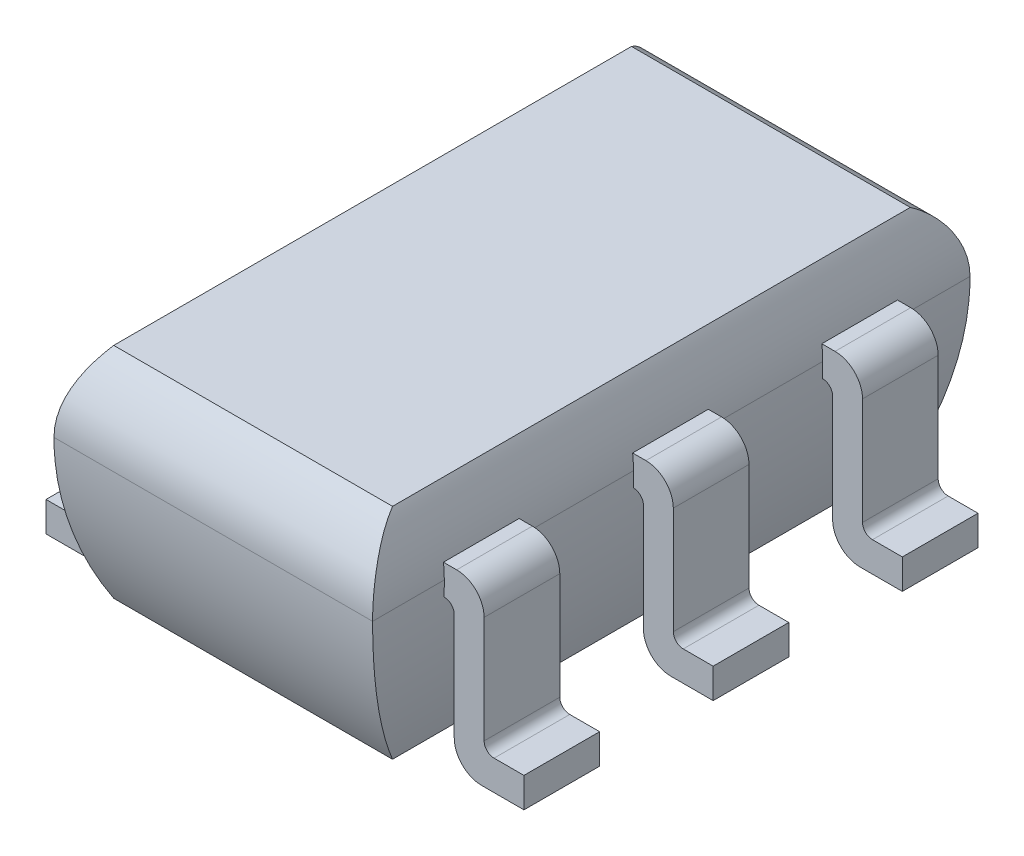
ISO-10303-21;
HEADER;
FILE_DESCRIPTION(('STEP AP214'),'2;1');
FILE_NAME('part.step','',(''),(''),'','','');
FILE_SCHEMA(('AUTOMOTIVE_DESIGN { 1 0 10303 214 1 1 1 1 }'));
ENDSEC;
DATA;
#1=APPLICATION_CONTEXT('core data for automotive mechanical design processes');
#2=APPLICATION_PROTOCOL_DEFINITION('international standard','automotive_design',2000,#1);
#3=PRODUCT_CONTEXT('',#1,'mechanical');
#4=PRODUCT('Part','Part','',(#3));
#5=PRODUCT_RELATED_PRODUCT_CATEGORY('part','',(#4));
#6=PRODUCT_DEFINITION_FORMATION('','',#4);
#7=PRODUCT_DEFINITION_CONTEXT('part definition',#1,'design');
#8=PRODUCT_DEFINITION('design','',#6,#7);
#9=PRODUCT_DEFINITION_SHAPE('','',#8);
#10=(LENGTH_UNIT() NAMED_UNIT(*) SI_UNIT(.MILLI.,.METRE.));
#11=(NAMED_UNIT(*) PLANE_ANGLE_UNIT() SI_UNIT($,.RADIAN.));
#12=(NAMED_UNIT(*) SI_UNIT($,.STERADIAN.) SOLID_ANGLE_UNIT());
#13=UNCERTAINTY_MEASURE_WITH_UNIT(LENGTH_MEASURE(1.E-05),#10,'distance_accuracy_value','');
#14=(GEOMETRIC_REPRESENTATION_CONTEXT(3) GLOBAL_UNCERTAINTY_ASSIGNED_CONTEXT((#13)) GLOBAL_UNIT_ASSIGNED_CONTEXT((#10,
#11,#12)) REPRESENTATION_CONTEXT('',''));
#15=CARTESIAN_POINT('',(0.,0.,0.));
#16=DIRECTION('',(0.,0.,1.));
#17=DIRECTION('',(1.,0.,0.));
#18=AXIS2_PLACEMENT_3D('',#15,#16,#17);
#19=CARTESIAN_POINT('',(0.9375,0.75,0.));
#20=DIRECTION('',(0.,0.,-1.));
#21=DIRECTION('',(-1.,0.,0.));
#22=AXIS2_PLACEMENT_3D('',#19,#20,#21);
#23=CYLINDRICAL_SURFACE('',#22,0.6625);
#24=CARTESIAN_POINT('',(1.6,0.749999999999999,-3.));
#25=CARTESIAN_POINT('',(1.60000007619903,0.754501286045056,-3.00000010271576));
#26=CARTESIAN_POINT('',(1.59995412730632,0.759002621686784,-2.99992835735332));
#27=CARTESIAN_POINT('',(1.59977108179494,0.767981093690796,-2.99964033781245));
#28=CARTESIAN_POINT('',(1.59963434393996,0.772458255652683,-2.99942463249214));
#29=CARTESIAN_POINT('',(1.59927114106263,0.781386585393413,-2.99884871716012));
#30=CARTESIAN_POINT('',(1.59904493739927,0.785837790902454,-2.99848892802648));
#31=CARTESIAN_POINT('',(1.5985043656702,0.794712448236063,-2.99762502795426));
#32=CARTESIAN_POINT('',(1.5981901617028,0.79913593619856,-2.99712118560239));
#33=CARTESIAN_POINT('',(1.59747514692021,0.807953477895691,-2.99596932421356));
#34=CARTESIAN_POINT('',(1.59707440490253,0.812347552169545,-2.99532141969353));
#35=CARTESIAN_POINT('',(1.59618790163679,0.821104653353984,-2.99388159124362));
#36=CARTESIAN_POINT('',(1.59570211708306,0.825467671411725,-2.99308962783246));
#37=CARTESIAN_POINT('',(1.59464713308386,0.834161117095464,-2.9913618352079));
#38=CARTESIAN_POINT('',(1.59407782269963,0.83849149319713,-2.99042581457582));
#39=CARTESIAN_POINT('',(1.59285740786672,0.847118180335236,-2.98841005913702));
#40=CARTESIAN_POINT('',(1.59220611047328,0.851414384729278,-2.98732998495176));
#41=CARTESIAN_POINT('',(1.59082335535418,0.859971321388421,-2.98502626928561));
#42=CARTESIAN_POINT('',(1.59009162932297,0.864231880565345,-2.98380214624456));
#43=CARTESIAN_POINT('',(1.58854966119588,0.872716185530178,-2.98121047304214));
#44=CARTESIAN_POINT('',(1.58773908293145,0.876939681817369,-2.97984230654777));
#45=CARTESIAN_POINT('',(1.58604106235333,0.885348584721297,-2.97696267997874));
#46=CARTESIAN_POINT('',(1.58515322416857,0.889533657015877,-2.97545047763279));
#47=CARTESIAN_POINT('',(1.58330234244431,0.897864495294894,-2.97228289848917));
#48=CARTESIAN_POINT('',(1.58233885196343,0.90200983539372,-2.97062666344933));
#49=CARTESIAN_POINT('',(1.58033832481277,0.910260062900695,-2.96717114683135));
#50=CARTESIAN_POINT('',(1.57930079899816,0.91436442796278,-2.96537090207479));
#51=CARTESIAN_POINT('',(1.5771538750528,0.922531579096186,-2.96162741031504));
#52=CARTESIAN_POINT('',(1.57604395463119,0.926593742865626,-2.95968310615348));
#53=CARTESIAN_POINT('',(1.5737538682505,0.934675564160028,-2.95565180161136));
#54=CARTESIAN_POINT('',(1.57257315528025,0.938694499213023,-2.95356366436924));
#55=CARTESIAN_POINT('',(1.57014329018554,0.946688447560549,-2.94924395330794));
#56=CARTESIAN_POINT('',(1.56889357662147,0.950662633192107,-2.9470111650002));
#57=CARTESIAN_POINT('',(1.56636005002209,0.958465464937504,-2.94246492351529));
#58=CARTESIAN_POINT('',(1.56507705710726,0.962295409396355,-2.94015323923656));
#59=CARTESIAN_POINT('',(1.56247235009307,0.969844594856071,-2.93543587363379));
#60=CARTESIAN_POINT('',(1.56115095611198,0.973564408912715,-2.93303093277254));
#61=CARTESIAN_POINT('',(1.55847473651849,0.980893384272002,-2.92812633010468));
#62=CARTESIAN_POINT('',(1.55712016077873,0.984503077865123,-2.92562732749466));
#63=CARTESIAN_POINT('',(1.55438252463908,0.991612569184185,-2.92053490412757));
#64=CARTESIAN_POINT('',(1.5529996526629,0.995112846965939,-2.91794205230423));
#65=CARTESIAN_POINT('',(1.55021026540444,1.00200423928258,-2.91266196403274));
#66=CARTESIAN_POINT('',(1.54880388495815,1.00539577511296,-2.90997520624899));
#67=CARTESIAN_POINT('',(1.54597215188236,1.01207057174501,-2.90450741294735));
#68=CARTESIAN_POINT('',(1.54454688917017,1.01535418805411,-2.90172676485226));
#69=CARTESIAN_POINT('',(1.54168190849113,1.02181412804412,-2.89607127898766));
#70=CARTESIAN_POINT('',(1.54024224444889,1.02499073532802,-2.89319673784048));
#71=CARTESIAN_POINT('',(1.53735281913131,1.03123773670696,-2.88735355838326));
#72=CARTESIAN_POINT('',(1.53590308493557,1.03430833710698,-2.88438512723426));
#73=CARTESIAN_POINT('',(1.53299771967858,1.04034448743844,-2.87835425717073));
#74=CARTESIAN_POINT('',(1.5315420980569,1.04331016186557,-2.87529193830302));
#75=CARTESIAN_POINT('',(1.52862900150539,1.04913769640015,-2.86907338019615));
#76=CARTESIAN_POINT('',(1.52717152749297,1.05199959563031,-2.86591717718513));
#77=CARTESIAN_POINT('',(1.52425861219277,1.05762088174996,-2.85951093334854));
#78=CARTESIAN_POINT('',(1.52280317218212,1.0603802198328,-2.85626084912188));
#79=CARTESIAN_POINT('',(1.51989806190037,1.06579773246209,-2.84966692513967));
#80=CARTESIAN_POINT('',(1.51844840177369,1.06845576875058,-2.84632296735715));
#81=CARTESIAN_POINT('',(1.51555841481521,1.0736720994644,-2.83954135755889));
#82=CARTESIAN_POINT('',(1.51411811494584,1.07623016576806,-2.8361035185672));
#83=CARTESIAN_POINT('',(1.51125033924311,1.08124790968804,-2.82913426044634));
#84=CARTESIAN_POINT('',(1.50982291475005,1.08370726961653,-2.82560259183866));
#85=CARTESIAN_POINT('',(1.50555549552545,1.09095564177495,-2.81484446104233));
#86=CARTESIAN_POINT('',(1.50274793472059,1.09558340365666,-2.80749596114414));
#87=CARTESIAN_POINT('',(1.5,1.1,-2.8));
#88=B_SPLINE_CURVE_WITH_KNOTS('',3,(#24,#25,#26,#27,#28,#29,#30,#31,#32,#33,#34,#35,#36,#37,#38,
#39,#40,#41,#42,#43,#44,#45,#46,#47,#48,#49,#50,#51,#52,#53,#54,#55,#56,#57,#58,#59,#60,#61,#62,
#63,#64,#65,#66,#67,#68,#69,#70,#71,#72,#73,#74,#75,#76,#77,#78,#79,#80,#81,#82,#83,#84,#85,#86,
#87),.UNSPECIFIED.,.F.,.F.,(4,2,2,2,2,2,2,2,2,2,2,2,2,2,2,2,2,2,2,2,2,2,2,2,2,2,2,2,2,2,2,4),
(0.,0.013503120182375,0.0269531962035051,0.0403642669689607,0.0537504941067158,
0.0671261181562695,0.0805054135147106,0.0939026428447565,0.107332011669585,0.120807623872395,
0.134343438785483,0.147953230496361,0.161650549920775,0.175448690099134,0.189360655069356,
0.203399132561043,0.21757647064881,0.231535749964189,0.2454007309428,0.259182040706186,
0.272890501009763,0.286537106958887,0.300133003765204,0.313689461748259,0.327217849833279,
0.340729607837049,0.354236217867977,0.367749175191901,0.381279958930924,0.394840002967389,
0.408440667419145,0.435805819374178),.UNSPECIFIED.);
#89=CARTESIAN_POINT('',(1.6,0.75,-3.));
#90=VERTEX_POINT('',#89);
#91=CARTESIAN_POINT('',(1.5,1.1,-2.8));
#92=VERTEX_POINT('',#91);
#93=EDGE_CURVE('E779',#90,#92,#88,.T.);
#94=ORIENTED_EDGE('',*,*,#93,.T.);
#95=DIRECTION('',(0.,0.,-1.));
#96=VECTOR('',#95,1.);
#97=CARTESIAN_POINT('',(1.5,1.1,0.));
#98=LINE('',#97,#96);
#99=CARTESIAN_POINT('',(1.5,1.1,-0.2));
#100=VERTEX_POINT('',#99);
#101=EDGE_CURVE('E42',#100,#92,#98,.T.);
#102=ORIENTED_EDGE('',*,*,#101,.F.);
#103=CARTESIAN_POINT('',(1.5,1.1,-0.2));
#104=CARTESIAN_POINT('',(1.50274412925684,1.09558952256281,-0.192514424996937));
#105=CARTESIAN_POINT('',(1.5055477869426,1.09096835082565,-0.185176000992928));
#106=CARTESIAN_POINT('',(1.50980936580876,1.08373047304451,-0.174432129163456));
#107=CARTESIAN_POINT('',(1.51123489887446,1.08127461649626,-0.17090494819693));
#108=CARTESIAN_POINT('',(1.51409893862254,1.07626402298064,-0.163944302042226));
#109=CARTESIAN_POINT('',(1.51553739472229,1.07370959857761,-0.160510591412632));
#110=CARTESIAN_POINT('',(1.51842375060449,1.06850069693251,-0.153736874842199));
#111=CARTESIAN_POINT('',(1.51987162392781,1.06584644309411,-0.150396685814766));
#112=CARTESIAN_POINT('',(1.5227732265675,1.06043664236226,-0.143809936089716));
#113=CARTESIAN_POINT('',(1.5242269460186,1.05768122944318,-0.1405632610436));
#114=CARTESIAN_POINT('',(1.5271364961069,1.05206794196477,-0.134163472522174));
#115=CARTESIAN_POINT('',(1.52859232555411,1.04921011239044,-0.131010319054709));
#116=CARTESIAN_POINT('',(1.53150221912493,1.04339086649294,-0.124797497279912));
#117=CARTESIAN_POINT('',(1.53295628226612,1.04042940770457,-0.121737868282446));
#118=CARTESIAN_POINT('',(1.53585862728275,1.03440183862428,-0.115712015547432));
#119=CARTESIAN_POINT('',(1.5373068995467,1.0313356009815,-0.112745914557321));
#120=CARTESIAN_POINT('',(1.54019350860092,1.02509747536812,-0.106907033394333));
#121=CARTESIAN_POINT('',(1.54163181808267,1.02192537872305,-0.104034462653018));
#122=CARTESIAN_POINT('',(1.54449420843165,1.01547461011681,-0.0983825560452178));
#123=CARTESIAN_POINT('',(1.54591823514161,1.01219565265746,-0.095603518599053));
#124=CARTESIAN_POINT('',(1.54874762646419,1.00553032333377,-0.0901385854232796));
#125=CARTESIAN_POINT('',(1.55015290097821,1.00214359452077,-0.0874530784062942));
#126=CARTESIAN_POINT('',(1.55294021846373,0.995261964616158,-0.0821751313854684));
#127=CARTESIAN_POINT('',(1.55432212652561,0.991766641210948,-0.0795831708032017));
#128=CARTESIAN_POINT('',(1.55705798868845,0.984667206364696,-0.0744921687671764));
#129=CARTESIAN_POINT('',(1.55841175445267,0.98106261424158,-0.0719936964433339));
#130=CARTESIAN_POINT('',(1.56108652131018,0.973743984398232,-0.0670897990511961));
#131=CARTESIAN_POINT('',(1.56240727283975,0.970029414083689,-0.0646850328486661));
#132=CARTESIAN_POINT('',(1.56501087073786,0.962490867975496,-0.0599676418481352));
#133=CARTESIAN_POINT('',(1.56629339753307,0.958666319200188,-0.0576557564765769));
#134=CARTESIAN_POINT('',(1.5688287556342,0.95086654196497,-0.0531042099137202));
#135=CARTESIAN_POINT('',(1.57008066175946,0.94688984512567,-0.0508665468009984));
#136=CARTESIAN_POINT('',(1.57251487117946,0.93889061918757,-0.0465374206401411));
#137=CARTESIAN_POINT('',(1.57369773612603,0.934868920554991,-0.0444447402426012));
#138=CARTESIAN_POINT('',(1.57599206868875,0.926781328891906,-0.0404046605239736));
#139=CARTESIAN_POINT('',(1.57710408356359,0.922716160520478,-0.0384561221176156));
#140=CARTESIAN_POINT('',(1.57925512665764,0.914542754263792,-0.0347044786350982));
#141=CARTESIAN_POINT('',(1.58029467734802,0.910435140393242,-0.0329003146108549));
#142=CARTESIAN_POINT('',(1.58229917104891,0.902178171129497,-0.0294372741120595));
#143=CARTESIAN_POINT('',(1.58326460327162,0.898029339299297,-0.0277774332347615));
#144=CARTESIAN_POINT('',(1.58511927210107,0.88969127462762,-0.0246029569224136));
#145=CARTESIAN_POINT('',(1.5860089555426,0.885502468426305,-0.0230874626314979));
#146=CARTESIAN_POINT('',(1.58771055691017,0.877085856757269,-0.0202015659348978));
#147=CARTESIAN_POINT('',(1.58852287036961,0.872858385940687,-0.0188304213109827));
#148=CARTESIAN_POINT('',(1.59006818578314,0.864365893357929,-0.0162331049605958));
#149=CARTESIAN_POINT('',(1.59080152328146,0.860101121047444,-0.0150063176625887));
#150=CARTESIAN_POINT('',(1.59218736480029,0.851535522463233,-0.0126975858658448));
#151=CARTESIAN_POINT('',(1.59284013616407,0.847234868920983,-0.0116151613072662));
#152=CARTESIAN_POINT('',(1.59406334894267,0.83859905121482,-0.00959501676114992));
#153=CARTESIAN_POINT('',(1.59463398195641,0.834263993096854,-0.00865695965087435));
#154=CARTESIAN_POINT('',(1.59569144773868,0.825560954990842,-0.00692540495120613));
#155=CARTESIAN_POINT('',(1.59617838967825,0.821193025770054,-0.00613171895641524));
#156=CARTESIAN_POINT('',(1.59706703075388,0.812425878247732,-0.00468875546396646));
#157=CARTESIAN_POINT('',(1.59746875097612,0.808026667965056,-0.00403944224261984));
#158=CARTESIAN_POINT('',(1.59818553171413,0.799198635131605,-0.0028850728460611));
#159=CARTESIAN_POINT('',(1.59850052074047,0.794769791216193,-0.00238013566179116));
#160=CARTESIAN_POINT('',(1.59904245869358,0.785884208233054,-0.00151435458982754));
#161=CARTESIAN_POINT('',(1.59926924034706,0.781427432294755,-0.00115378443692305));
#162=CARTESIAN_POINT('',(1.59963338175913,0.772487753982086,-0.000576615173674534));
#163=CARTESIAN_POINT('',(1.59977047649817,0.768004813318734,-0.000360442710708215));
#164=CARTESIAN_POINT('',(1.59995400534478,0.759014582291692,-7.17960147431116E-05));
#165=CARTESIAN_POINT('',(1.60000007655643,0.754507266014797,1.03041520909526E-07));
#166=CARTESIAN_POINT('',(1.6,0.749999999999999,0.));
#167=B_SPLINE_CURVE_WITH_KNOTS('',3,(#103,#104,#105,#106,#107,#108,#109,#110,#111,#112,#113,
#114,#115,#116,#117,#118,#119,#120,#121,#122,#123,#124,#125,#126,#127,#128,#129,#130,#131,#132,
#133,#134,#135,#136,#137,#138,#139,#140,#141,#142,#143,#144,#145,#146,#147,#148,#149,#150,#151,
#152,#153,#154,#155,#156,#157,#158,#159,#160,#161,#162,#163,#164,#165,#166),.UNSPECIFIED.,.F.,
.F.,(4,2,2,2,2,2,2,2,2,2,2,2,2,2,2,2,2,2,2,2,2,2,2,2,2,2,2,2,2,2,2,4),(0.,0.0273272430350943,
0.0409099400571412,0.0544526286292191,0.0679666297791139,0.0814633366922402,0.0949541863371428,
0.108450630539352,0.121964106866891,0.135506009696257,0.149087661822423,0.162720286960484,
0.176414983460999,0.190182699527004,0.204034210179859,0.217980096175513,0.232172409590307,
0.246225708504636,0.260152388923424,0.273965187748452,0.287677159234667,0.301301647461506,
0.31485225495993,0.328342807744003,0.341787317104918,0.355199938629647,0.368594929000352,
0.381986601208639,0.395389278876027,0.408817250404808,0.422284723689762,0.435805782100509),.UNSPECIFIED.);
#168=CARTESIAN_POINT('',(1.6,0.75,0.));
#169=VERTEX_POINT('',#168);
#170=EDGE_CURVE('E876',#100,#169,#167,.T.);
#171=ORIENTED_EDGE('',*,*,#170,.T.);
#172=DIRECTION('',(0.,0.,-1.));
#173=VECTOR('',#172,1.);
#174=CARTESIAN_POINT('',(1.6,0.75,0.));
#175=LINE('',#174,#173);
#176=CARTESIAN_POINT('',(1.6,0.75,-0.36));
#177=VERTEX_POINT('',#176);
#178=EDGE_CURVE('E705',#169,#177,#175,.T.);
#179=ORIENTED_EDGE('',*,*,#178,.T.);
#180=CARTESIAN_POINT('',(0.9375,0.75,-0.36));
#181=DIRECTION('',(0.,0.,1.));
#182=DIRECTION('',(-1.,0.,0.));
#183=AXIS2_PLACEMENT_3D('',#180,#181,#182);
#184=CIRCLE('',#183,0.6625);
#185=CARTESIAN_POINT('',(1.595741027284,0.825,-0.36));
#186=VERTEX_POINT('',#185);
#187=EDGE_CURVE('E936',#177,#186,#184,.T.);
#188=ORIENTED_EDGE('',*,*,#187,.T.);
#189=DIRECTION('',(0.,0.,-1.));
#190=VECTOR('',#189,1.);
#191=CARTESIAN_POINT('',(1.595741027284,0.825,0.));
#192=LINE('',#191,#190);
#193=CARTESIAN_POINT('',(1.595741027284,0.825,-0.74));
#194=VERTEX_POINT('',#193);
#195=EDGE_CURVE('E1300',#186,#194,#192,.T.);
#196=ORIENTED_EDGE('',*,*,#195,.T.);
#197=CARTESIAN_POINT('',(0.9375,0.75,-0.74));
#198=DIRECTION('',(0.,0.,-1.));
#199=DIRECTION('',(-1.,0.,0.));
#200=AXIS2_PLACEMENT_3D('',#197,#198,#199);
#201=CIRCLE('',#200,0.6625);
#202=CARTESIAN_POINT('',(1.6,0.75,-0.74));
#203=VERTEX_POINT('',#202);
#204=EDGE_CURVE('E964',#194,#203,#201,.T.);
#205=ORIENTED_EDGE('',*,*,#204,.T.);
#206=DIRECTION('',(0.,0.,-1.));
#207=VECTOR('',#206,1.);
#208=CARTESIAN_POINT('',(1.6,0.75,0.));
#209=LINE('',#208,#207);
#210=CARTESIAN_POINT('',(1.6,0.75,-1.31));
#211=VERTEX_POINT('',#210);
#212=EDGE_CURVE('E1860',#203,#211,#209,.T.);
#213=ORIENTED_EDGE('',*,*,#212,.T.);
#214=CARTESIAN_POINT('',(0.9375,0.75,-1.31));
#215=DIRECTION('',(0.,0.,1.));
#216=DIRECTION('',(-1.,0.,0.));
#217=AXIS2_PLACEMENT_3D('',#214,#215,#216);
#218=CIRCLE('',#217,0.6625);
#219=CARTESIAN_POINT('',(1.595741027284,0.825,-1.31));
#220=VERTEX_POINT('',#219);
#221=EDGE_CURVE('E1075',#211,#220,#218,.T.);
#222=ORIENTED_EDGE('',*,*,#221,.T.);
#223=DIRECTION('',(0.,0.,-1.));
#224=VECTOR('',#223,1.);
#225=CARTESIAN_POINT('',(1.595741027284,0.825,0.));
#226=LINE('',#225,#224);
#227=CARTESIAN_POINT('',(1.595741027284,0.825,-1.69));
#228=VERTEX_POINT('',#227);
#229=EDGE_CURVE('E1203',#220,#228,#226,.T.);
#230=ORIENTED_EDGE('',*,*,#229,.T.);
#231=CARTESIAN_POINT('',(0.9375,0.75,-1.69));
#232=DIRECTION('',(0.,0.,-1.));
#233=DIRECTION('',(-1.,0.,0.));
#234=AXIS2_PLACEMENT_3D('',#231,#232,#233);
#235=CIRCLE('',#234,0.6625);
#236=CARTESIAN_POINT('',(1.6,0.75,-1.69));
#237=VERTEX_POINT('',#236);
#238=EDGE_CURVE('E1099',#228,#237,#235,.T.);
#239=ORIENTED_EDGE('',*,*,#238,.T.);
#240=DIRECTION('',(0.,0.,-1.));
#241=VECTOR('',#240,1.);
#242=CARTESIAN_POINT('',(1.6,0.75,0.));
#243=LINE('',#242,#241);
#244=CARTESIAN_POINT('',(1.6,0.75,-2.26));
#245=VERTEX_POINT('',#244);
#246=EDGE_CURVE('E1889',#237,#245,#243,.T.);
#247=ORIENTED_EDGE('',*,*,#246,.T.);
#248=CARTESIAN_POINT('',(0.9375,0.75,-2.26));
#249=DIRECTION('',(0.,0.,1.));
#250=DIRECTION('',(-1.,0.,0.));
#251=AXIS2_PLACEMENT_3D('',#248,#249,#250);
#252=CIRCLE('',#251,0.6625);
#253=CARTESIAN_POINT('',(1.595741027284,0.825,-2.26));
#254=VERTEX_POINT('',#253);
#255=EDGE_CURVE('E1636',#245,#254,#252,.T.);
#256=ORIENTED_EDGE('',*,*,#255,.T.);
#257=DIRECTION('',(0.,0.,-1.));
#258=VECTOR('',#257,1.);
#259=CARTESIAN_POINT('',(1.595741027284,0.825,0.));
#260=LINE('',#259,#258);
#261=CARTESIAN_POINT('',(1.595741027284,0.825,-2.64));
#262=VERTEX_POINT('',#261);
#263=EDGE_CURVE('E1371',#254,#262,#260,.T.);
#264=ORIENTED_EDGE('',*,*,#263,.T.);
#265=CARTESIAN_POINT('',(0.9375,0.75,-2.64));
#266=DIRECTION('',(0.,0.,-1.));
#267=DIRECTION('',(-1.,0.,0.));
#268=AXIS2_PLACEMENT_3D('',#265,#266,#267);
#269=CIRCLE('',#268,0.6625);
#270=CARTESIAN_POINT('',(1.6,0.75,-2.64));
#271=VERTEX_POINT('',#270);
#272=EDGE_CURVE('E1025',#262,#271,#269,.T.);
#273=ORIENTED_EDGE('',*,*,#272,.T.);
#274=DIRECTION('',(0.,0.,-1.));
#275=VECTOR('',#274,1.);
#276=CARTESIAN_POINT('',(1.6,0.75,0.));
#277=LINE('',#276,#275);
#278=EDGE_CURVE('E795',#271,#90,#277,.T.);
#279=ORIENTED_EDGE('',*,*,#278,.T.);
#280=EDGE_LOOP('',(#94,#102,#171,#179,#188,#196,#205,#213,#222,#230,#239,#247,#256,#264,#273,#279));
#281=FACE_BOUND('',#280,.T.);
#282=ADVANCED_FACE('F17',(#281),#23,.T.);
#283=CARTESIAN_POINT('',(-0.06213203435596,0.687132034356,-0.36));
#284=DIRECTION('',(0.,0.,-1.));
#285=DIRECTION('',(-1.,0.,0.));
#286=AXIS2_PLACEMENT_3D('',#283,#284,#285);
#287=CYLINDRICAL_SURFACE('',#286,0.137867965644);
#288=CARTESIAN_POINT('',(-0.06213203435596,0.687132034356,-0.36));
#289=DIRECTION('',(0.,0.,1.));
#290=DIRECTION('',(-1.,0.,0.));
#291=AXIS2_PLACEMENT_3D('',#288,#289,#290);
#292=CIRCLE('',#291,0.137867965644);
#293=CARTESIAN_POINT('',(-0.06213203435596,0.825,-0.36));
#294=VERTEX_POINT('',#293);
#295=CARTESIAN_POINT('',(-0.2,0.687132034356,-0.36));
#296=VERTEX_POINT('',#295);
#297=EDGE_CURVE('E1272',#294,#296,#292,.T.);
#298=ORIENTED_EDGE('',*,*,#297,.F.);
#299=DIRECTION('',(0.,0.,1.));
#300=VECTOR('',#299,1.);
#301=CARTESIAN_POINT('',(-0.06213203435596,0.825,-0.36));
#302=LINE('',#301,#300);
#303=CARTESIAN_POINT('',(-0.06213203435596,0.825,-0.74));
#304=VERTEX_POINT('',#303);
#305=EDGE_CURVE('E869',#304,#294,#302,.T.);
#306=ORIENTED_EDGE('',*,*,#305,.F.);
#307=CARTESIAN_POINT('',(-0.06213203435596,0.687132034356,-0.74));
#308=DIRECTION('',(0.,0.,1.));
#309=DIRECTION('',(-1.,0.,0.));
#310=AXIS2_PLACEMENT_3D('',#307,#308,#309);
#311=CIRCLE('',#310,0.137867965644);
#312=CARTESIAN_POINT('',(-0.2,0.687132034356,-0.74));
#313=VERTEX_POINT('',#312);
#314=EDGE_CURVE('E1246',#304,#313,#311,.T.);
#315=ORIENTED_EDGE('',*,*,#314,.T.);
#316=DIRECTION('',(0.,0.,-1.));
#317=VECTOR('',#316,1.);
#318=CARTESIAN_POINT('',(-0.2,0.687132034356,-0.36));
#319=LINE('',#318,#317);
#320=EDGE_CURVE('E11',#296,#313,#319,.T.);
#321=ORIENTED_EDGE('',*,*,#320,.F.);
#322=EDGE_LOOP('',(#298,#306,#315,#321));
#323=FACE_BOUND('',#322,.T.);
#324=ADVANCED_FACE('F2099',(#323),#287,.T.);
#325=CARTESIAN_POINT('',(-0.2,0.1,-0.36));
#326=DIRECTION('',(-1.,0.,0.));
#327=DIRECTION('',(0.,1.,0.));
#328=AXIS2_PLACEMENT_3D('',#325,#326,#327);
#329=PLANE('',#328);
#330=DIRECTION('',(0.,-1.,0.));
#331=VECTOR('',#330,1.);
#332=CARTESIAN_POINT('',(-0.2,0.489893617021,-0.36));
#333=LINE('',#332,#331);
#334=CARTESIAN_POINT('',(-0.2,0.15,-0.36));
#335=VERTEX_POINT('',#334);
#336=EDGE_CURVE('E1217',#296,#335,#333,.T.);
#337=ORIENTED_EDGE('',*,*,#336,.F.);
#338=ORIENTED_EDGE('',*,*,#320,.T.);
#339=DIRECTION('',(0.,-1.,0.));
#340=VECTOR('',#339,1.);
#341=CARTESIAN_POINT('',(-0.2,1.1,-0.74));
#342=LINE('',#341,#340);
#343=CARTESIAN_POINT('',(-0.2,0.15,-0.74));
#344=VERTEX_POINT('',#343);
#345=EDGE_CURVE('E1231',#313,#344,#342,.T.);
#346=ORIENTED_EDGE('',*,*,#345,.T.);
#347=DIRECTION('',(0.,0.,1.));
#348=VECTOR('',#347,1.);
#349=CARTESIAN_POINT('',(-0.2,0.15,-0.36));
#350=LINE('',#349,#348);
#351=EDGE_CURVE('E29',#344,#335,#350,.T.);
#352=ORIENTED_EDGE('',*,*,#351,.T.);
#353=EDGE_LOOP('',(#337,#338,#346,#352));
#354=FACE_BOUND('',#353,.T.);
#355=ADVANCED_FACE('F2105',(#354),#329,.T.);
#356=CARTESIAN_POINT('',(-0.25,0.15,-0.36));
#357=DIRECTION('',(0.,0.,-1.));
#358=DIRECTION('',(-1.,0.,0.));
#359=AXIS2_PLACEMENT_3D('',#356,#357,#358);
#360=CYLINDRICAL_SURFACE('',#359,0.05);
#361=DIRECTION('',(0.,0.,-1.));
#362=VECTOR('',#361,1.);
#363=CARTESIAN_POINT('',(-0.25,0.1,-0.36));
#364=LINE('',#363,#362);
#365=CARTESIAN_POINT('',(-0.25,0.1,-0.36));
#366=VERTEX_POINT('',#365);
#367=CARTESIAN_POINT('',(-0.25,0.1,-0.74));
#368=VERTEX_POINT('',#367);
#369=EDGE_CURVE('E919',#366,#368,#364,.T.);
#370=ORIENTED_EDGE('',*,*,#369,.F.);
#371=CARTESIAN_POINT('',(-0.25,0.15,-0.36));
#372=DIRECTION('',(0.,0.,-1.));
#373=DIRECTION('',(-1.,0.,0.));
#374=AXIS2_PLACEMENT_3D('',#371,#372,#373);
#375=CIRCLE('',#374,0.05);
#376=EDGE_CURVE('E1212',#335,#366,#375,.T.);
#377=ORIENTED_EDGE('',*,*,#376,.F.);
#378=ORIENTED_EDGE('',*,*,#351,.F.);
#379=CARTESIAN_POINT('',(-0.25,0.15,-0.74));
#380=DIRECTION('',(0.,0.,-1.));
#381=DIRECTION('',(-1.,0.,0.));
#382=AXIS2_PLACEMENT_3D('',#379,#380,#381);
#383=CIRCLE('',#382,0.05);
#384=EDGE_CURVE('E1227',#344,#368,#383,.T.);
#385=ORIENTED_EDGE('',*,*,#384,.T.);
#386=EDGE_LOOP('',(#370,#377,#378,#385));
#387=FACE_BOUND('',#386,.T.);
#388=ADVANCED_FACE('F2111',(#387),#360,.F.);
#389=CARTESIAN_POINT('',(-0.25,0.1,-0.36));
#390=DIRECTION('',(0.,1.,0.));
#391=DIRECTION('',(1.,0.,0.));
#392=AXIS2_PLACEMENT_3D('',#389,#390,#391);
#393=PLANE('',#392);
#394=DIRECTION('',(-1.,0.,0.));
#395=VECTOR('',#394,1.);
#396=CARTESIAN_POINT('',(0.914893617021,0.1,-0.36));
#397=LINE('',#396,#395);
#398=CARTESIAN_POINT('',(-0.4,0.1,-0.36));
#399=VERTEX_POINT('',#398);
#400=EDGE_CURVE('E1216',#366,#399,#397,.T.);
#401=ORIENTED_EDGE('',*,*,#400,.F.);
#402=ORIENTED_EDGE('',*,*,#369,.T.);
#403=DIRECTION('',(-1.,0.,0.));
#404=VECTOR('',#403,1.);
#405=CARTESIAN_POINT('',(0.,0.1,-0.74));
#406=LINE('',#405,#404);
#407=CARTESIAN_POINT('',(-0.4,0.1,-0.74));
#408=VERTEX_POINT('',#407);
#409=EDGE_CURVE('E1232',#368,#408,#406,.T.);
#410=ORIENTED_EDGE('',*,*,#409,.T.);
#411=DIRECTION('',(0.,0.,-1.));
#412=VECTOR('',#411,1.);
#413=CARTESIAN_POINT('',(-0.4,0.1,-0.36));
#414=LINE('',#413,#412);
#415=EDGE_CURVE('E1407',#399,#408,#414,.T.);
#416=ORIENTED_EDGE('',*,*,#415,.F.);
#417=EDGE_LOOP('',(#401,#402,#410,#416));
#418=FACE_BOUND('',#417,.T.);
#419=ADVANCED_FACE('F2243',(#418),#393,.T.);
#420=CARTESIAN_POINT('',(-0.4,-0.05,-0.36));
#421=DIRECTION('',(-1.,0.,0.));
#422=DIRECTION('',(0.,1.,0.));
#423=AXIS2_PLACEMENT_3D('',#420,#421,#422);
#424=PLANE('',#423);
#425=DIRECTION('',(0.,-1.,0.));
#426=VECTOR('',#425,1.);
#427=CARTESIAN_POINT('',(-0.4,0.489893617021,-0.36));
#428=LINE('',#427,#426);
#429=CARTESIAN_POINT('',(-0.4,-0.05,-0.36));
#430=VERTEX_POINT('',#429);
#431=EDGE_CURVE('E1282',#399,#430,#428,.T.);
#432=ORIENTED_EDGE('',*,*,#431,.F.);
#433=ORIENTED_EDGE('',*,*,#415,.T.);
#434=DIRECTION('',(0.,-1.,0.));
#435=VECTOR('',#434,1.);
#436=CARTESIAN_POINT('',(-0.4,1.1,-0.74));
#437=LINE('',#436,#435);
#438=CARTESIAN_POINT('',(-0.4,-0.05,-0.74));
#439=VERTEX_POINT('',#438);
#440=EDGE_CURVE('E1236',#408,#439,#437,.T.);
#441=ORIENTED_EDGE('',*,*,#440,.T.);
#442=DIRECTION('',(0.,0.,-1.));
#443=VECTOR('',#442,1.);
#444=CARTESIAN_POINT('',(-0.4,-0.05,-0.36));
#445=LINE('',#444,#443);
#446=EDGE_CURVE('E953',#430,#439,#445,.T.);
#447=ORIENTED_EDGE('',*,*,#446,.F.);
#448=EDGE_LOOP('',(#432,#433,#441,#447));
#449=FACE_BOUND('',#448,.T.);
#450=ADVANCED_FACE('F2239',(#449),#424,.T.);
#451=CARTESIAN_POINT('',(-0.187867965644,-0.05,-0.36));
#452=DIRECTION('',(0.,-1.,0.));
#453=DIRECTION('',(0.,0.,-1.));
#454=AXIS2_PLACEMENT_3D('',#451,#452,#453);
#455=PLANE('',#454);
#456=DIRECTION('',(1.,0.,0.));
#457=VECTOR('',#456,1.);
#458=CARTESIAN_POINT('',(0.914893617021,-0.05,-0.36));
#459=LINE('',#458,#457);
#460=CARTESIAN_POINT('',(-0.187867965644,-0.05,-0.36));
#461=VERTEX_POINT('',#460);
#462=EDGE_CURVE('E1286',#430,#461,#459,.T.);
#463=ORIENTED_EDGE('',*,*,#462,.F.);
#464=ORIENTED_EDGE('',*,*,#446,.T.);
#465=DIRECTION('',(1.,0.,0.));
#466=VECTOR('',#465,1.);
#467=CARTESIAN_POINT('',(0.,-0.05,-0.74));
#468=LINE('',#467,#466);
#469=CARTESIAN_POINT('',(-0.187867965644,-0.05,-0.74));
#470=VERTEX_POINT('',#469);
#471=EDGE_CURVE('E1226',#439,#470,#468,.T.);
#472=ORIENTED_EDGE('',*,*,#471,.T.);
#473=DIRECTION('',(0.,0.,-1.));
#474=VECTOR('',#473,1.);
#475=CARTESIAN_POINT('',(-0.187867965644,-0.05,-0.36));
#476=LINE('',#475,#474);
#477=EDGE_CURVE('E940',#461,#470,#476,.T.);
#478=ORIENTED_EDGE('',*,*,#477,.F.);
#479=EDGE_LOOP('',(#463,#464,#472,#478));
#480=FACE_BOUND('',#479,.T.);
#481=ADVANCED_FACE('F2242',(#480),#455,.T.);
#482=CARTESIAN_POINT('',(-0.187867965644,0.08786796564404,-0.36));
#483=DIRECTION('',(0.,0.,-1.));
#484=DIRECTION('',(-1.,0.,0.));
#485=AXIS2_PLACEMENT_3D('',#482,#483,#484);
#486=CYLINDRICAL_SURFACE('',#485,0.137867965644);
#487=CARTESIAN_POINT('',(-0.187867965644,0.08786796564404,-0.36));
#488=DIRECTION('',(0.,0.,1.));
#489=DIRECTION('',(-1.,0.,0.));
#490=AXIS2_PLACEMENT_3D('',#487,#488,#489);
#491=CIRCLE('',#490,0.137867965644);
#492=CARTESIAN_POINT('',(-0.05,0.08786796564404,-0.36));
#493=VERTEX_POINT('',#492);
#494=EDGE_CURVE('E1290',#461,#493,#491,.T.);
#495=ORIENTED_EDGE('',*,*,#494,.F.);
#496=ORIENTED_EDGE('',*,*,#477,.T.);
#497=CARTESIAN_POINT('',(-0.187867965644,0.08786796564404,-0.74));
#498=DIRECTION('',(0.,0.,1.));
#499=DIRECTION('',(-1.,0.,0.));
#500=AXIS2_PLACEMENT_3D('',#497,#498,#499);
#501=CIRCLE('',#500,0.137867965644);
#502=CARTESIAN_POINT('',(-0.05,0.08786796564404,-0.74));
#503=VERTEX_POINT('',#502);
#504=EDGE_CURVE('E1222',#470,#503,#501,.T.);
#505=ORIENTED_EDGE('',*,*,#504,.T.);
#506=DIRECTION('',(0.,0.,-1.));
#507=VECTOR('',#506,1.);
#508=CARTESIAN_POINT('',(-0.05,0.08786796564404,-0.36));
#509=LINE('',#508,#507);
#510=EDGE_CURVE('E937',#493,#503,#509,.T.);
#511=ORIENTED_EDGE('',*,*,#510,.F.);
#512=EDGE_LOOP('',(#495,#496,#505,#511));
#513=FACE_BOUND('',#512,.T.);
#514=ADVANCED_FACE('F682',(#513),#486,.T.);
#515=CARTESIAN_POINT('',(-0.05,0.675,-0.36));
#516=DIRECTION('',(1.,0.,0.));
#517=DIRECTION('',(0.,1.,0.));
#518=AXIS2_PLACEMENT_3D('',#515,#516,#517);
#519=PLANE('',#518);
#520=DIRECTION('',(0.,1.,0.));
#521=VECTOR('',#520,1.);
#522=CARTESIAN_POINT('',(-0.05,0.489893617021,-0.36));
#523=LINE('',#522,#521);
#524=CARTESIAN_POINT('',(-0.05,0.625,-0.36));
#525=VERTEX_POINT('',#524);
#526=EDGE_CURVE('E1294',#493,#525,#523,.T.);
#527=ORIENTED_EDGE('',*,*,#526,.F.);
#528=ORIENTED_EDGE('',*,*,#510,.T.);
#529=DIRECTION('',(0.,1.,0.));
#530=VECTOR('',#529,1.);
#531=CARTESIAN_POINT('',(-0.05,1.1,-0.74));
#532=LINE('',#531,#530);
#533=CARTESIAN_POINT('',(-0.05,0.625,-0.74));
#534=VERTEX_POINT('',#533);
#535=EDGE_CURVE('E1221',#503,#534,#532,.T.);
#536=ORIENTED_EDGE('',*,*,#535,.T.);
#537=DIRECTION('',(0.,0.,1.));
#538=VECTOR('',#537,1.);
#539=CARTESIAN_POINT('',(-0.05,0.625,-0.36));
#540=LINE('',#539,#538);
#541=EDGE_CURVE('E52',#534,#525,#540,.T.);
#542=ORIENTED_EDGE('',*,*,#541,.T.);
#543=EDGE_LOOP('',(#527,#528,#536,#542));
#544=FACE_BOUND('',#543,.T.);
#545=ADVANCED_FACE('F2222',(#544),#519,.T.);
#546=CARTESIAN_POINT('',(0.,0.625,-0.36));
#547=DIRECTION('',(0.,0.,-1.));
#548=DIRECTION('',(-1.,0.,0.));
#549=AXIS2_PLACEMENT_3D('',#546,#547,#548);
#550=CYLINDRICAL_SURFACE('',#549,0.05);
#551=DIRECTION('',(0.,0.,-1.));
#552=VECTOR('',#551,1.);
#553=CARTESIAN_POINT('',(0.,0.675,-0.36));
#554=LINE('',#553,#552);
#555=CARTESIAN_POINT('',(0.,0.675,-0.36));
#556=VERTEX_POINT('',#555);
#557=CARTESIAN_POINT('',(0.,0.675,-0.74));
#558=VERTEX_POINT('',#557);
#559=EDGE_CURVE('E1261',#556,#558,#554,.T.);
#560=ORIENTED_EDGE('',*,*,#559,.F.);
#561=CARTESIAN_POINT('',(0.,0.625,-0.36));
#562=DIRECTION('',(0.,0.,-1.));
#563=DIRECTION('',(-1.,0.,0.));
#564=AXIS2_PLACEMENT_3D('',#561,#562,#563);
#565=CIRCLE('',#564,0.05);
#566=EDGE_CURVE('E895',#525,#556,#565,.T.);
#567=ORIENTED_EDGE('',*,*,#566,.F.);
#568=ORIENTED_EDGE('',*,*,#541,.F.);
#569=CARTESIAN_POINT('',(0.,0.625,-0.74));
#570=DIRECTION('',(0.,0.,-1.));
#571=DIRECTION('',(-1.,0.,0.));
#572=AXIS2_PLACEMENT_3D('',#569,#570,#571);
#573=CIRCLE('',#572,0.05);
#574=EDGE_CURVE('E1257',#534,#558,#573,.T.);
#575=ORIENTED_EDGE('',*,*,#574,.T.);
#576=EDGE_LOOP('',(#560,#567,#568,#575));
#577=FACE_BOUND('',#576,.T.);
#578=ADVANCED_FACE('F2218',(#577),#550,.F.);
#579=CARTESIAN_POINT('',(0.,1.1,0.));
#580=DIRECTION('',(0.,1.,0.));
#581=DIRECTION('',(1.,0.,0.));
#582=AXIS2_PLACEMENT_3D('',#579,#580,#581);
#583=PLANE('',#582);
#584=DIRECTION('',(-1.,0.,0.));
#585=VECTOR('',#584,1.);
#586=CARTESIAN_POINT('',(0.,1.1,-2.8));
#587=LINE('',#586,#585);
#588=CARTESIAN_POINT('',(0.1,1.1,-2.8));
#589=VERTEX_POINT('',#588);
#590=EDGE_CURVE('E769',#92,#589,#587,.T.);
#591=ORIENTED_EDGE('',*,*,#590,.T.);
#592=DIRECTION('',(0.,0.,-1.));
#593=VECTOR('',#592,1.);
#594=CARTESIAN_POINT('',(0.1,1.1,0.));
#595=LINE('',#594,#593);
#596=CARTESIAN_POINT('',(0.1,1.1,-0.2));
#597=VERTEX_POINT('',#596);
#598=EDGE_CURVE('E826',#597,#589,#595,.T.);
#599=ORIENTED_EDGE('',*,*,#598,.F.);
#600=DIRECTION('',(-1.,0.,0.));
#601=VECTOR('',#600,1.);
#602=CARTESIAN_POINT('',(0.,1.1,-0.2));
#603=LINE('',#602,#601);
#604=EDGE_CURVE('E872',#100,#597,#603,.T.);
#605=ORIENTED_EDGE('',*,*,#604,.F.);
#606=ORIENTED_EDGE('',*,*,#101,.T.);
#607=EDGE_LOOP('',(#591,#599,#605,#606));
#608=FACE_BOUND('',#607,.T.);
#609=ADVANCED_FACE('F2221',(#608),#583,.T.);
#610=CARTESIAN_POINT('',(-0.06213203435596,0.825,-0.36));
#611=DIRECTION('',(0.,1.,0.));
#612=DIRECTION('',(1.,0.,0.));
#613=AXIS2_PLACEMENT_3D('',#610,#611,#612);
#614=PLANE('',#613);
#615=DIRECTION('',(-1.,0.,0.));
#616=VECTOR('',#615,1.);
#617=CARTESIAN_POINT('',(0.914893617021,0.825,-0.36));
#618=LINE('',#617,#616);
#619=CARTESIAN_POINT('',(0.004258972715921,0.825,-0.36));
#620=VERTEX_POINT('',#619);
#621=EDGE_CURVE('E1268',#620,#294,#618,.T.);
#622=ORIENTED_EDGE('',*,*,#621,.F.);
#623=DIRECTION('',(0.,0.,1.));
#624=VECTOR('',#623,1.);
#625=CARTESIAN_POINT('',(0.004258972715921,0.825,0.));
#626=LINE('',#625,#624);
#627=CARTESIAN_POINT('',(0.004258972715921,0.825,-0.74));
#628=VERTEX_POINT('',#627);
#629=EDGE_CURVE('E1211',#628,#620,#626,.T.);
#630=ORIENTED_EDGE('',*,*,#629,.F.);
#631=DIRECTION('',(-1.,0.,0.));
#632=VECTOR('',#631,1.);
#633=CARTESIAN_POINT('',(0.,0.825,-0.74));
#634=LINE('',#633,#632);
#635=EDGE_CURVE('E1250',#628,#304,#634,.T.);
#636=ORIENTED_EDGE('',*,*,#635,.T.);
#637=ORIENTED_EDGE('',*,*,#305,.T.);
#638=EDGE_LOOP('',(#622,#630,#636,#637));
#639=FACE_BOUND('',#638,.T.);
#640=ADVANCED_FACE('F2237',(#639),#614,.T.);
#641=CARTESIAN_POINT('',(0.,0.625,-0.36));
#642=DIRECTION('',(0.,0.,-1.));
#643=DIRECTION('',(-1.,0.,0.));
#644=AXIS2_PLACEMENT_3D('',#641,#642,#643);
#645=CYLINDRICAL_SURFACE('',#644,0.05);
#646=DIRECTION('',(0.,0.,1.));
#647=VECTOR('',#646,1.);
#648=CARTESIAN_POINT('',(-0.05,0.625,-0.36));
#649=LINE('',#648,#647);
#650=CARTESIAN_POINT('',(-0.05,0.625,-2.64));
#651=VERTEX_POINT('',#650);
#652=CARTESIAN_POINT('',(-0.05,0.625,-2.26));
#653=VERTEX_POINT('',#652);
#654=EDGE_CURVE('E1398',#651,#653,#649,.T.);
#655=ORIENTED_EDGE('',*,*,#654,.F.);
#656=CARTESIAN_POINT('',(0.,0.625,-2.64));
#657=DIRECTION('',(0.,0.,1.));
#658=DIRECTION('',(-1.,0.,0.));
#659=AXIS2_PLACEMENT_3D('',#656,#657,#658);
#660=CIRCLE('',#659,0.05);
#661=CARTESIAN_POINT('',(0.,0.675,-2.64));
#662=VERTEX_POINT('',#661);
#663=EDGE_CURVE('E1056',#662,#651,#660,.T.);
#664=ORIENTED_EDGE('',*,*,#663,.F.);
#665=DIRECTION('',(0.,0.,-1.));
#666=VECTOR('',#665,1.);
#667=CARTESIAN_POINT('',(0.,0.675,-2.26));
#668=LINE('',#667,#666);
#669=CARTESIAN_POINT('',(0.,0.675,-2.26));
#670=VERTEX_POINT('',#669);
#671=EDGE_CURVE('E1044',#670,#662,#668,.T.);
#672=ORIENTED_EDGE('',*,*,#671,.F.);
#673=CARTESIAN_POINT('',(0.,0.625,-2.26));
#674=DIRECTION('',(0.,0.,1.));
#675=DIRECTION('',(-1.,0.,0.));
#676=AXIS2_PLACEMENT_3D('',#673,#674,#675);
#677=CIRCLE('',#676,0.05);
#678=EDGE_CURVE('E1193',#670,#653,#677,.T.);
#679=ORIENTED_EDGE('',*,*,#678,.T.);
#680=EDGE_LOOP('',(#655,#664,#672,#679));
#681=FACE_BOUND('',#680,.T.);
#682=ADVANCED_FACE('F2233',(#681),#645,.F.);
#683=CARTESIAN_POINT('',(-0.05,0.675,-0.36));
#684=DIRECTION('',(1.,0.,0.));
#685=DIRECTION('',(0.,1.,0.));
#686=AXIS2_PLACEMENT_3D('',#683,#684,#685);
#687=PLANE('',#686);
#688=DIRECTION('',(0.,-1.,0.));
#689=VECTOR('',#688,1.);
#690=CARTESIAN_POINT('',(-0.05,0.86858974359,-2.64));
#691=LINE('',#690,#689);
#692=CARTESIAN_POINT('',(-0.05,0.08786796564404,-2.64));
#693=VERTEX_POINT('',#692);
#694=EDGE_CURVE('E1051',#651,#693,#691,.T.);
#695=ORIENTED_EDGE('',*,*,#694,.F.);
#696=ORIENTED_EDGE('',*,*,#654,.T.);
#697=DIRECTION('',(0.,-1.,0.));
#698=VECTOR('',#697,1.);
#699=CARTESIAN_POINT('',(-0.05,1.1,-2.26));
#700=LINE('',#699,#698);
#701=CARTESIAN_POINT('',(-0.05,0.08786796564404,-2.26));
#702=VERTEX_POINT('',#701);
#703=EDGE_CURVE('E1189',#653,#702,#700,.T.);
#704=ORIENTED_EDGE('',*,*,#703,.T.);
#705=DIRECTION('',(0.,0.,1.));
#706=VECTOR('',#705,1.);
#707=CARTESIAN_POINT('',(-0.05,0.08786796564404,-0.36));
#708=LINE('',#707,#706);
#709=EDGE_CURVE('E1395',#693,#702,#708,.T.);
#710=ORIENTED_EDGE('',*,*,#709,.F.);
#711=EDGE_LOOP('',(#695,#696,#704,#710));
#712=FACE_BOUND('',#711,.T.);
#713=ADVANCED_FACE('F2136',(#712),#687,.T.);
#714=CARTESIAN_POINT('',(-0.187867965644,0.08786796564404,-0.36));
#715=DIRECTION('',(0.,0.,-1.));
#716=DIRECTION('',(-1.,0.,0.));
#717=AXIS2_PLACEMENT_3D('',#714,#715,#716);
#718=CYLINDRICAL_SURFACE('',#717,0.137867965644);
#719=CARTESIAN_POINT('',(-0.187867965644,0.08786796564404,-2.64));
#720=DIRECTION('',(0.,0.,-1.));
#721=DIRECTION('',(-1.,0.,0.));
#722=AXIS2_PLACEMENT_3D('',#719,#720,#721);
#723=CIRCLE('',#722,0.137867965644);
#724=CARTESIAN_POINT('',(-0.187867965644,-0.05,-2.64));
#725=VERTEX_POINT('',#724);
#726=EDGE_CURVE('E1055',#693,#725,#723,.T.);
#727=ORIENTED_EDGE('',*,*,#726,.F.);
#728=ORIENTED_EDGE('',*,*,#709,.T.);
#729=CARTESIAN_POINT('',(-0.187867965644,0.08786796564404,-2.26));
#730=DIRECTION('',(0.,0.,-1.));
#731=DIRECTION('',(-1.,0.,0.));
#732=AXIS2_PLACEMENT_3D('',#729,#730,#731);
#733=CIRCLE('',#732,0.137867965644);
#734=CARTESIAN_POINT('',(-0.187867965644,-0.05,-2.26));
#735=VERTEX_POINT('',#734);
#736=EDGE_CURVE('E945',#702,#735,#733,.T.);
#737=ORIENTED_EDGE('',*,*,#736,.T.);
#738=DIRECTION('',(0.,0.,1.));
#739=VECTOR('',#738,1.);
#740=CARTESIAN_POINT('',(-0.187867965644,-0.05,-0.36));
#741=LINE('',#740,#739);
#742=EDGE_CURVE('E1392',#725,#735,#741,.T.);
#743=ORIENTED_EDGE('',*,*,#742,.F.);
#744=EDGE_LOOP('',(#727,#728,#737,#743));
#745=FACE_BOUND('',#744,.T.);
#746=ADVANCED_FACE('F2132',(#745),#718,.T.);
#747=CARTESIAN_POINT('',(-0.187867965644,-0.05,-0.36));
#748=DIRECTION('',(0.,-1.,0.));
#749=DIRECTION('',(0.,0.,-1.));
#750=AXIS2_PLACEMENT_3D('',#747,#748,#749);
#751=PLANE('',#750);
#752=DIRECTION('',(-1.,0.,0.));
#753=VECTOR('',#752,1.);
#754=CARTESIAN_POINT('',(0.85641025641,-0.05,-2.64));
#755=LINE('',#754,#753);
#756=CARTESIAN_POINT('',(-0.4,-0.05,-2.64));
#757=VERTEX_POINT('',#756);
#758=EDGE_CURVE('E1147',#725,#757,#755,.T.);
#759=ORIENTED_EDGE('',*,*,#758,.F.);
#760=ORIENTED_EDGE('',*,*,#742,.T.);
#761=DIRECTION('',(-1.,0.,0.));
#762=VECTOR('',#761,1.);
#763=CARTESIAN_POINT('',(-0.4,-0.05,-2.26));
#764=LINE('',#763,#762);
#765=CARTESIAN_POINT('',(-0.4,-0.05,-2.26));
#766=VERTEX_POINT('',#765);
#767=EDGE_CURVE('E941',#735,#766,#764,.T.);
#768=ORIENTED_EDGE('',*,*,#767,.T.);
#769=DIRECTION('',(0.,0.,1.));
#770=VECTOR('',#769,1.);
#771=CARTESIAN_POINT('',(-0.4,-0.05,-0.36));
#772=LINE('',#771,#770);
#773=EDGE_CURVE('E1389',#757,#766,#772,.T.);
#774=ORIENTED_EDGE('',*,*,#773,.F.);
#775=EDGE_LOOP('',(#759,#760,#768,#774));
#776=FACE_BOUND('',#775,.T.);
#777=ADVANCED_FACE('F2135',(#776),#751,.T.);
#778=CARTESIAN_POINT('',(-0.4,-0.05,-0.36));
#779=DIRECTION('',(-1.,0.,0.));
#780=DIRECTION('',(0.,1.,0.));
#781=AXIS2_PLACEMENT_3D('',#778,#779,#780);
#782=PLANE('',#781);
#783=DIRECTION('',(0.,1.,0.));
#784=VECTOR('',#783,1.);
#785=CARTESIAN_POINT('',(-0.4,0.86858974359,-2.64));
#786=LINE('',#785,#784);
#787=CARTESIAN_POINT('',(-0.4,0.1,-2.64));
#788=VERTEX_POINT('',#787);
#789=EDGE_CURVE('E1142',#757,#788,#786,.T.);
#790=ORIENTED_EDGE('',*,*,#789,.F.);
#791=ORIENTED_EDGE('',*,*,#773,.T.);
#792=DIRECTION('',(0.,1.,0.));
#793=VECTOR('',#792,1.);
#794=CARTESIAN_POINT('',(-0.4,1.1,-2.26));
#795=LINE('',#794,#793);
#796=CARTESIAN_POINT('',(-0.4,0.1,-2.26));
#797=VERTEX_POINT('',#796);
#798=EDGE_CURVE('E946',#766,#797,#795,.T.);
#799=ORIENTED_EDGE('',*,*,#798,.T.);
#800=DIRECTION('',(0.,0.,1.));
#801=VECTOR('',#800,1.);
#802=CARTESIAN_POINT('',(-0.4,0.1,-0.36));
#803=LINE('',#802,#801);
#804=EDGE_CURVE('E1386',#788,#797,#803,.T.);
#805=ORIENTED_EDGE('',*,*,#804,.F.);
#806=EDGE_LOOP('',(#790,#791,#799,#805));
#807=FACE_BOUND('',#806,.T.);
#808=ADVANCED_FACE('F2226',(#807),#782,.T.);
#809=CARTESIAN_POINT('',(-0.25,0.1,-0.36));
#810=DIRECTION('',(0.,1.,0.));
#811=DIRECTION('',(1.,0.,0.));
#812=AXIS2_PLACEMENT_3D('',#809,#810,#811);
#813=PLANE('',#812);
#814=DIRECTION('',(1.,0.,0.));
#815=VECTOR('',#814,1.);
#816=CARTESIAN_POINT('',(0.85641025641,0.1,-2.64));
#817=LINE('',#816,#815);
#818=CARTESIAN_POINT('',(-0.25,0.1,-2.64));
#819=VERTEX_POINT('',#818);
#820=EDGE_CURVE('E1146',#788,#819,#817,.T.);
#821=ORIENTED_EDGE('',*,*,#820,.F.);
#822=ORIENTED_EDGE('',*,*,#804,.T.);
#823=DIRECTION('',(1.,0.,0.));
#824=VECTOR('',#823,1.);
#825=CARTESIAN_POINT('',(-0.4,0.1,-2.26));
#826=LINE('',#825,#824);
#827=CARTESIAN_POINT('',(-0.25,0.1,-2.26));
#828=VERTEX_POINT('',#827);
#829=EDGE_CURVE('E1182',#797,#828,#826,.T.);
#830=ORIENTED_EDGE('',*,*,#829,.T.);
#831=DIRECTION('',(0.,0.,-1.));
#832=VECTOR('',#831,1.);
#833=CARTESIAN_POINT('',(-0.25,0.1,-0.36));
#834=LINE('',#833,#832);
#835=EDGE_CURVE('E1383',#828,#819,#834,.T.);
#836=ORIENTED_EDGE('',*,*,#835,.T.);
#837=EDGE_LOOP('',(#821,#822,#830,#836));
#838=FACE_BOUND('',#837,.T.);
#839=ADVANCED_FACE('F2207',(#838),#813,.T.);
#840=CARTESIAN_POINT('',(-0.25,0.15,-0.36));
#841=DIRECTION('',(0.,0.,-1.));
#842=DIRECTION('',(-1.,0.,0.));
#843=AXIS2_PLACEMENT_3D('',#840,#841,#842);
#844=CYLINDRICAL_SURFACE('',#843,0.05);
#845=DIRECTION('',(0.,0.,1.));
#846=VECTOR('',#845,1.);
#847=CARTESIAN_POINT('',(-0.2,0.15,-0.36));
#848=LINE('',#847,#846);
#849=CARTESIAN_POINT('',(-0.2,0.15,-2.64));
#850=VERTEX_POINT('',#849);
#851=CARTESIAN_POINT('',(-0.2,0.15,-2.26));
#852=VERTEX_POINT('',#851);
#853=EDGE_CURVE('E1380',#850,#852,#848,.T.);
#854=ORIENTED_EDGE('',*,*,#853,.F.);
#855=CARTESIAN_POINT('',(-0.25,0.15,-2.64));
#856=DIRECTION('',(0.,0.,1.));
#857=DIRECTION('',(-1.,0.,0.));
#858=AXIS2_PLACEMENT_3D('',#855,#856,#857);
#859=CIRCLE('',#858,0.05);
#860=EDGE_CURVE('E1050',#819,#850,#859,.T.);
#861=ORIENTED_EDGE('',*,*,#860,.F.);
#862=ORIENTED_EDGE('',*,*,#835,.F.);
#863=CARTESIAN_POINT('',(-0.25,0.15,-2.26));
#864=DIRECTION('',(0.,0.,1.));
#865=DIRECTION('',(-1.,0.,0.));
#866=AXIS2_PLACEMENT_3D('',#863,#864,#865);
#867=CIRCLE('',#866,0.05);
#868=EDGE_CURVE('E1178',#828,#852,#867,.T.);
#869=ORIENTED_EDGE('',*,*,#868,.T.);
#870=EDGE_LOOP('',(#854,#861,#862,#869));
#871=FACE_BOUND('',#870,.T.);
#872=ADVANCED_FACE('F2204',(#871),#844,.F.);
#873=CARTESIAN_POINT('',(-0.2,0.1,-0.36));
#874=DIRECTION('',(-1.,0.,0.));
#875=DIRECTION('',(0.,1.,0.));
#876=AXIS2_PLACEMENT_3D('',#873,#874,#875);
#877=PLANE('',#876);
#878=DIRECTION('',(0.,1.,0.));
#879=VECTOR('',#878,1.);
#880=CARTESIAN_POINT('',(-0.2,0.86858974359,-2.64));
#881=LINE('',#880,#879);
#882=CARTESIAN_POINT('',(-0.2,0.687132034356,-2.64));
#883=VERTEX_POINT('',#882);
#884=EDGE_CURVE('E1045',#850,#883,#881,.T.);
#885=ORIENTED_EDGE('',*,*,#884,.F.);
#886=ORIENTED_EDGE('',*,*,#853,.T.);
#887=DIRECTION('',(0.,1.,0.));
#888=VECTOR('',#887,1.);
#889=CARTESIAN_POINT('',(-0.2,1.1,-2.26));
#890=LINE('',#889,#888);
#891=CARTESIAN_POINT('',(-0.2,0.687132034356,-2.26));
#892=VERTEX_POINT('',#891);
#893=EDGE_CURVE('E1171',#852,#892,#890,.T.);
#894=ORIENTED_EDGE('',*,*,#893,.T.);
#895=DIRECTION('',(0.,0.,1.));
#896=VECTOR('',#895,1.);
#897=CARTESIAN_POINT('',(-0.2,0.687132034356,-0.36));
#898=LINE('',#897,#896);
#899=EDGE_CURVE('E1377',#883,#892,#898,.T.);
#900=ORIENTED_EDGE('',*,*,#899,.F.);
#901=EDGE_LOOP('',(#885,#886,#894,#900));
#902=FACE_BOUND('',#901,.T.);
#903=ADVANCED_FACE('F809',(#902),#877,.T.);
#904=CARTESIAN_POINT('',(-0.06213203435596,0.687132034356,-0.36));
#905=DIRECTION('',(0.,0.,-1.));
#906=DIRECTION('',(-1.,0.,0.));
#907=AXIS2_PLACEMENT_3D('',#904,#905,#906);
#908=CYLINDRICAL_SURFACE('',#907,0.137867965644);
#909=CARTESIAN_POINT('',(-0.06213203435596,0.687132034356,-2.64));
#910=DIRECTION('',(0.,0.,-1.));
#911=DIRECTION('',(-1.,0.,0.));
#912=AXIS2_PLACEMENT_3D('',#909,#910,#911);
#913=CIRCLE('',#912,0.137867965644);
#914=CARTESIAN_POINT('',(-0.06213203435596,0.825,-2.64));
#915=VERTEX_POINT('',#914);
#916=EDGE_CURVE('E1049',#883,#915,#913,.T.);
#917=ORIENTED_EDGE('',*,*,#916,.F.);
#918=ORIENTED_EDGE('',*,*,#899,.T.);
#919=CARTESIAN_POINT('',(-0.06213203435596,0.687132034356,-2.26));
#920=DIRECTION('',(0.,0.,-1.));
#921=DIRECTION('',(-1.,0.,0.));
#922=AXIS2_PLACEMENT_3D('',#919,#920,#921);
#923=CIRCLE('',#922,0.137867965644);
#924=CARTESIAN_POINT('',(-0.06213203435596,0.825,-2.26));
#925=VERTEX_POINT('',#924);
#926=EDGE_CURVE('E989',#892,#925,#923,.T.);
#927=ORIENTED_EDGE('',*,*,#926,.T.);
#928=DIRECTION('',(0.,0.,1.));
#929=VECTOR('',#928,1.);
#930=CARTESIAN_POINT('',(-0.06213203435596,0.825,-0.36));
#931=LINE('',#930,#929);
#932=EDGE_CURVE('E1374',#915,#925,#931,.T.);
#933=ORIENTED_EDGE('',*,*,#932,.F.);
#934=EDGE_LOOP('',(#917,#918,#927,#933));
#935=FACE_BOUND('',#934,.T.);
#936=ADVANCED_FACE('F2213',(#935),#908,.T.);
#937=CARTESIAN_POINT('',(-0.06213203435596,0.825,-0.36));
#938=DIRECTION('',(0.,1.,0.));
#939=DIRECTION('',(1.,0.,0.));
#940=AXIS2_PLACEMENT_3D('',#937,#938,#939);
#941=PLANE('',#940);
#942=DIRECTION('',(1.,0.,0.));
#943=VECTOR('',#942,1.);
#944=CARTESIAN_POINT('',(0.85641025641,0.825,-2.64));
#945=LINE('',#944,#943);
#946=CARTESIAN_POINT('',(0.004258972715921,0.825,-2.64));
#947=VERTEX_POINT('',#946);
#948=EDGE_CURVE('E1127',#915,#947,#945,.T.);
#949=ORIENTED_EDGE('',*,*,#948,.F.);
#950=ORIENTED_EDGE('',*,*,#932,.T.);
#951=DIRECTION('',(1.,0.,0.));
#952=VECTOR('',#951,1.);
#953=CARTESIAN_POINT('',(-0.4,0.825,-2.26));
#954=LINE('',#953,#952);
#955=CARTESIAN_POINT('',(0.004258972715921,0.825,-2.26));
#956=VERTEX_POINT('',#955);
#957=EDGE_CURVE('E985',#925,#956,#954,.T.);
#958=ORIENTED_EDGE('',*,*,#957,.T.);
#959=DIRECTION('',(0.,0.,1.));
#960=VECTOR('',#959,1.);
#961=CARTESIAN_POINT('',(0.004258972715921,0.825,0.));
#962=LINE('',#961,#960);
#963=EDGE_CURVE('E829',#947,#956,#962,.T.);
#964=ORIENTED_EDGE('',*,*,#963,.F.);
#965=EDGE_LOOP('',(#949,#950,#958,#964));
#966=FACE_BOUND('',#965,.T.);
#967=ADVANCED_FACE('F2094',(#966),#941,.T.);
#968=CARTESIAN_POINT('',(1.6,0.825,-0.36));
#969=DIRECTION('',(0.,1.,0.));
#970=DIRECTION('',(1.,0.,0.));
#971=AXIS2_PLACEMENT_3D('',#968,#969,#970);
#972=PLANE('',#971);
#973=DIRECTION('',(1.,0.,0.));
#974=VECTOR('',#973,1.);
#975=CARTESIAN_POINT('',(0.85641025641,0.825,-2.64));
#976=LINE('',#975,#974);
#977=CARTESIAN_POINT('',(1.662132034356,0.825,-2.64));
#978=VERTEX_POINT('',#977);
#979=EDGE_CURVE('E1020',#262,#978,#976,.T.);
#980=ORIENTED_EDGE('',*,*,#979,.F.);
#981=ORIENTED_EDGE('',*,*,#263,.F.);
#982=DIRECTION('',(1.,0.,0.));
#983=VECTOR('',#982,1.);
#984=CARTESIAN_POINT('',(1.6,0.825,-2.26));
#985=LINE('',#984,#983);
#986=CARTESIAN_POINT('',(1.662132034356,0.825,-2.26));
#987=VERTEX_POINT('',#986);
#988=EDGE_CURVE('E1010',#254,#987,#985,.T.);
#989=ORIENTED_EDGE('',*,*,#988,.T.);
#990=DIRECTION('',(0.,0.,1.));
#991=VECTOR('',#990,1.);
#992=CARTESIAN_POINT('',(1.662132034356,0.825,-0.36));
#993=LINE('',#992,#991);
#994=EDGE_CURVE('E1368',#978,#987,#993,.T.);
#995=ORIENTED_EDGE('',*,*,#994,.F.);
#996=EDGE_LOOP('',(#980,#981,#989,#995));
#997=FACE_BOUND('',#996,.T.);
#998=ADVANCED_FACE('F2044',(#997),#972,.T.);
#999=CARTESIAN_POINT('',(1.662132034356,0.687132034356,-0.36));
#1000=DIRECTION('',(0.,0.,-1.));
#1001=DIRECTION('',(-1.,0.,0.));
#1002=AXIS2_PLACEMENT_3D('',#999,#1000,#1001);
#1003=CYLINDRICAL_SURFACE('',#1002,0.137867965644);
#1004=CARTESIAN_POINT('',(1.662132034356,0.687132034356,-2.64));
#1005=DIRECTION('',(0.,0.,-1.));
#1006=DIRECTION('',(-1.,0.,0.));
#1007=AXIS2_PLACEMENT_3D('',#1004,#1005,#1006);
#1008=CIRCLE('',#1007,0.137867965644);
#1009=CARTESIAN_POINT('',(1.8,0.687132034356,-2.64));
#1010=VERTEX_POINT('',#1009);
#1011=EDGE_CURVE('E1024',#978,#1010,#1008,.T.);
#1012=ORIENTED_EDGE('',*,*,#1011,.F.);
#1013=ORIENTED_EDGE('',*,*,#994,.T.);
#1014=CARTESIAN_POINT('',(1.662132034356,0.687132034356,-2.26));
#1015=DIRECTION('',(0.,0.,-1.));
#1016=DIRECTION('',(-1.,0.,0.));
#1017=AXIS2_PLACEMENT_3D('',#1014,#1015,#1016);
#1018=CIRCLE('',#1017,0.137867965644);
#1019=CARTESIAN_POINT('',(1.8,0.687132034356,-2.26));
#1020=VERTEX_POINT('',#1019);
#1021=EDGE_CURVE('E1006',#987,#1020,#1018,.T.);
#1022=ORIENTED_EDGE('',*,*,#1021,.T.);
#1023=DIRECTION('',(0.,0.,1.));
#1024=VECTOR('',#1023,1.);
#1025=CARTESIAN_POINT('',(1.8,0.687132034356,-0.36));
#1026=LINE('',#1025,#1024);
#1027=EDGE_CURVE('E1365',#1010,#1020,#1026,.T.);
#1028=ORIENTED_EDGE('',*,*,#1027,.F.);
#1029=EDGE_LOOP('',(#1012,#1013,#1022,#1028));
#1030=FACE_BOUND('',#1029,.T.);
#1031=ADVANCED_FACE('F2084',(#1030),#1003,.T.);
#1032=CARTESIAN_POINT('',(1.8,0.687132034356,-0.36));
#1033=DIRECTION('',(1.,0.,0.));
#1034=DIRECTION('',(0.,1.,0.));
#1035=AXIS2_PLACEMENT_3D('',#1032,#1033,#1034);
#1036=PLANE('',#1035);
#1037=DIRECTION('',(0.,-1.,0.));
#1038=VECTOR('',#1037,1.);
#1039=CARTESIAN_POINT('',(1.8,0.86858974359,-2.64));
#1040=LINE('',#1039,#1038);
#1041=CARTESIAN_POINT('',(1.8,0.15,-2.64));
#1042=VERTEX_POINT('',#1041);
#1043=EDGE_CURVE('E1588',#1010,#1042,#1040,.T.);
#1044=ORIENTED_EDGE('',*,*,#1043,.F.);
#1045=ORIENTED_EDGE('',*,*,#1027,.T.);
#1046=DIRECTION('',(0.,-1.,0.));
#1047=VECTOR('',#1046,1.);
#1048=CARTESIAN_POINT('',(1.8,1.1,-2.26));
#1049=LINE('',#1048,#1047);
#1050=CARTESIAN_POINT('',(1.8,0.15,-2.26));
#1051=VERTEX_POINT('',#1050);
#1052=EDGE_CURVE('E924',#1020,#1051,#1049,.T.);
#1053=ORIENTED_EDGE('',*,*,#1052,.T.);
#1054=DIRECTION('',(0.,0.,-1.));
#1055=VECTOR('',#1054,1.);
#1056=CARTESIAN_POINT('',(1.8,0.15,-0.36));
#1057=LINE('',#1056,#1055);
#1058=EDGE_CURVE('E1362',#1051,#1042,#1057,.T.);
#1059=ORIENTED_EDGE('',*,*,#1058,.T.);
#1060=EDGE_LOOP('',(#1044,#1045,#1053,#1059));
#1061=FACE_BOUND('',#1060,.T.);
#1062=ADVANCED_FACE('F2082',(#1061),#1036,.T.);
#1063=CARTESIAN_POINT('',(1.85,0.15,-0.36));
#1064=DIRECTION('',(0.,0.,-1.));
#1065=DIRECTION('',(-1.,0.,0.));
#1066=AXIS2_PLACEMENT_3D('',#1063,#1064,#1065);
#1067=CYLINDRICAL_SURFACE('',#1066,0.05);
#1068=DIRECTION('',(0.,0.,1.));
#1069=VECTOR('',#1068,1.);
#1070=CARTESIAN_POINT('',(1.85,0.1,-0.36));
#1071=LINE('',#1070,#1069);
#1072=CARTESIAN_POINT('',(1.85,0.1,-2.64));
#1073=VERTEX_POINT('',#1072);
#1074=CARTESIAN_POINT('',(1.85,0.1,-2.26));
#1075=VERTEX_POINT('',#1074);
#1076=EDGE_CURVE('E1359',#1073,#1075,#1071,.T.);
#1077=ORIENTED_EDGE('',*,*,#1076,.F.);
#1078=CARTESIAN_POINT('',(1.85,0.15,-2.64));
#1079=DIRECTION('',(0.,0.,1.));
#1080=DIRECTION('',(-1.,0.,0.));
#1081=AXIS2_PLACEMENT_3D('',#1078,#1079,#1080);
#1082=CIRCLE('',#1081,0.05);
#1083=EDGE_CURVE('E1088',#1042,#1073,#1082,.T.);
#1084=ORIENTED_EDGE('',*,*,#1083,.F.);
#1085=ORIENTED_EDGE('',*,*,#1058,.F.);
#1086=CARTESIAN_POINT('',(1.85,0.15,-2.26));
#1087=DIRECTION('',(0.,0.,1.));
#1088=DIRECTION('',(-1.,0.,0.));
#1089=AXIS2_PLACEMENT_3D('',#1086,#1087,#1088);
#1090=CIRCLE('',#1089,0.05);
#1091=EDGE_CURVE('E920',#1051,#1075,#1090,.T.);
#1092=ORIENTED_EDGE('',*,*,#1091,.T.);
#1093=EDGE_LOOP('',(#1077,#1084,#1085,#1092));
#1094=FACE_BOUND('',#1093,.T.);
#1095=ADVANCED_FACE('F2078',(#1094),#1067,.F.);
#1096=CARTESIAN_POINT('',(1.85,0.1,-0.36));
#1097=DIRECTION('',(0.,1.,0.));
#1098=DIRECTION('',(1.,0.,0.));
#1099=AXIS2_PLACEMENT_3D('',#1096,#1097,#1098);
#1100=PLANE('',#1099);
#1101=DIRECTION('',(1.,0.,0.));
#1102=VECTOR('',#1101,1.);
#1103=CARTESIAN_POINT('',(0.85641025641,0.1,-2.64));
#1104=LINE('',#1103,#1102);
#1105=CARTESIAN_POINT('',(2.,0.1,-2.64));
#1106=VERTEX_POINT('',#1105);
#1107=EDGE_CURVE('E1084',#1073,#1106,#1104,.T.);
#1108=ORIENTED_EDGE('',*,*,#1107,.F.);
#1109=ORIENTED_EDGE('',*,*,#1076,.T.);
#1110=DIRECTION('',(1.,0.,0.));
#1111=VECTOR('',#1110,1.);
#1112=CARTESIAN_POINT('',(1.6,0.1,-2.26));
#1113=LINE('',#1112,#1111);
#1114=CARTESIAN_POINT('',(2.,0.1,-2.26));
#1115=VERTEX_POINT('',#1114);
#1116=EDGE_CURVE('E925',#1075,#1115,#1113,.T.);
#1117=ORIENTED_EDGE('',*,*,#1116,.T.);
#1118=DIRECTION('',(0.,0.,1.));
#1119=VECTOR('',#1118,1.);
#1120=CARTESIAN_POINT('',(2.,0.1,-0.36));
#1121=LINE('',#1120,#1119);
#1122=EDGE_CURVE('E1355',#1106,#1115,#1121,.T.);
#1123=ORIENTED_EDGE('',*,*,#1122,.F.);
#1124=EDGE_LOOP('',(#1108,#1109,#1117,#1123));
#1125=FACE_BOUND('',#1124,.T.);
#1126=ADVANCED_FACE('F2075',(#1125),#1100,.T.);
#1127=CARTESIAN_POINT('',(2.,0.1,-0.36));
#1128=DIRECTION('',(1.,0.,0.));
#1129=DIRECTION('',(0.,1.,0.));
#1130=AXIS2_PLACEMENT_3D('',#1127,#1128,#1129);
#1131=PLANE('',#1130);
#1132=DIRECTION('',(0.,-1.,0.));
#1133=VECTOR('',#1132,1.);
#1134=CARTESIAN_POINT('',(2.,0.86858974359,-2.64));
#1135=LINE('',#1134,#1133);
#1136=CARTESIAN_POINT('',(2.,-0.05,-2.64));
#1137=VERTEX_POINT('',#1136);
#1138=EDGE_CURVE('E1065',#1106,#1137,#1135,.T.);
#1139=ORIENTED_EDGE('',*,*,#1138,.F.);
#1140=ORIENTED_EDGE('',*,*,#1122,.T.);
#1141=DIRECTION('',(0.,-1.,0.));
#1142=VECTOR('',#1141,1.);
#1143=CARTESIAN_POINT('',(2.,1.1,-2.26));
#1144=LINE('',#1143,#1142);
#1145=CARTESIAN_POINT('',(2.,-0.05,-2.26));
#1146=VERTEX_POINT('',#1145);
#1147=EDGE_CURVE('E1138',#1115,#1146,#1144,.T.);
#1148=ORIENTED_EDGE('',*,*,#1147,.T.);
#1149=DIRECTION('',(0.,0.,1.));
#1150=VECTOR('',#1149,1.);
#1151=CARTESIAN_POINT('',(2.,-0.05,-0.36));
#1152=LINE('',#1151,#1150);
#1153=EDGE_CURVE('E1352',#1137,#1146,#1152,.T.);
#1154=ORIENTED_EDGE('',*,*,#1153,.F.);
#1155=EDGE_LOOP('',(#1139,#1140,#1148,#1154));
#1156=FACE_BOUND('',#1155,.T.);
#1157=ADVANCED_FACE('F2072',(#1156),#1131,.T.);
#1158=CARTESIAN_POINT('',(2.,-0.05,-0.36));
#1159=DIRECTION('',(0.,-1.,0.));
#1160=DIRECTION('',(0.,0.,-1.));
#1161=AXIS2_PLACEMENT_3D('',#1158,#1159,#1160);
#1162=PLANE('',#1161);
#1163=DIRECTION('',(-1.,0.,0.));
#1164=VECTOR('',#1163,1.);
#1165=CARTESIAN_POINT('',(0.85641025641,-0.05,-2.64));
#1166=LINE('',#1165,#1164);
#1167=CARTESIAN_POINT('',(1.787867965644,-0.05,-2.64));
#1168=VERTEX_POINT('',#1167);
#1169=EDGE_CURVE('E1061',#1137,#1168,#1166,.T.);
#1170=ORIENTED_EDGE('',*,*,#1169,.F.);
#1171=ORIENTED_EDGE('',*,*,#1153,.T.);
#1172=DIRECTION('',(-1.,0.,0.));
#1173=VECTOR('',#1172,1.);
#1174=CARTESIAN_POINT('',(1.6,-0.05,-2.26));
#1175=LINE('',#1174,#1173);
#1176=CARTESIAN_POINT('',(1.787867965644,-0.05,-2.26));
#1177=VERTEX_POINT('',#1176);
#1178=EDGE_CURVE('E983',#1146,#1177,#1175,.T.);
#1179=ORIENTED_EDGE('',*,*,#1178,.T.);
#1180=DIRECTION('',(0.,0.,1.));
#1181=VECTOR('',#1180,1.);
#1182=CARTESIAN_POINT('',(1.787867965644,-0.05,-0.36));
#1183=LINE('',#1182,#1181);
#1184=EDGE_CURVE('E1356',#1168,#1177,#1183,.T.);
#1185=ORIENTED_EDGE('',*,*,#1184,.F.);
#1186=EDGE_LOOP('',(#1170,#1171,#1179,#1185));
#1187=FACE_BOUND('',#1186,.T.);
#1188=ADVANCED_FACE('F2069',(#1187),#1162,.T.);
#1189=CARTESIAN_POINT('',(1.787867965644,0.08786796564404,-0.36));
#1190=DIRECTION('',(0.,0.,-1.));
#1191=DIRECTION('',(-1.,0.,0.));
#1192=AXIS2_PLACEMENT_3D('',#1189,#1190,#1191);
#1193=CYLINDRICAL_SURFACE('',#1192,0.137867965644);
#1194=CARTESIAN_POINT('',(1.787867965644,0.08786796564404,-2.64));
#1195=DIRECTION('',(0.,0.,-1.));
#1196=DIRECTION('',(-1.,0.,0.));
#1197=AXIS2_PLACEMENT_3D('',#1194,#1195,#1196);
#1198=CIRCLE('',#1197,0.137867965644);
#1199=CARTESIAN_POINT('',(1.65,0.08786796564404,-2.64));
#1200=VERTEX_POINT('',#1199);
#1201=EDGE_CURVE('E901',#1168,#1200,#1198,.T.);
#1202=ORIENTED_EDGE('',*,*,#1201,.F.);
#1203=ORIENTED_EDGE('',*,*,#1184,.T.);
#1204=CARTESIAN_POINT('',(1.787867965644,0.08786796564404,-2.26));
#1205=DIRECTION('',(0.,0.,-1.));
#1206=DIRECTION('',(-1.,0.,0.));
#1207=AXIS2_PLACEMENT_3D('',#1204,#1205,#1206);
#1208=CIRCLE('',#1207,0.137867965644);
#1209=CARTESIAN_POINT('',(1.65,0.08786796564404,-2.26));
#1210=VERTEX_POINT('',#1209);
#1211=EDGE_CURVE('E979',#1177,#1210,#1208,.T.);
#1212=ORIENTED_EDGE('',*,*,#1211,.T.);
#1213=DIRECTION('',(0.,0.,1.));
#1214=VECTOR('',#1213,1.);
#1215=CARTESIAN_POINT('',(1.65,0.08786796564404,-0.36));
#1216=LINE('',#1215,#1214);
#1217=EDGE_CURVE('E1351',#1200,#1210,#1216,.T.);
#1218=ORIENTED_EDGE('',*,*,#1217,.F.);
#1219=EDGE_LOOP('',(#1202,#1203,#1212,#1218));
#1220=FACE_BOUND('',#1219,.T.);
#1221=ADVANCED_FACE('F2063',(#1220),#1193,.T.);
#1222=CARTESIAN_POINT('',(1.65,0.08786796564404,-0.36));
#1223=DIRECTION('',(-1.,0.,0.));
#1224=DIRECTION('',(0.,1.,0.));
#1225=AXIS2_PLACEMENT_3D('',#1222,#1223,#1224);
#1226=PLANE('',#1225);
#1227=DIRECTION('',(0.,1.,0.));
#1228=VECTOR('',#1227,1.);
#1229=CARTESIAN_POINT('',(1.65,0.86858974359,-2.64));
#1230=LINE('',#1229,#1228);
#1231=CARTESIAN_POINT('',(1.65,0.625,-2.64));
#1232=VERTEX_POINT('',#1231);
#1233=EDGE_CURVE('E897',#1200,#1232,#1230,.T.);
#1234=ORIENTED_EDGE('',*,*,#1233,.F.);
#1235=ORIENTED_EDGE('',*,*,#1217,.T.);
#1236=DIRECTION('',(0.,1.,0.));
#1237=VECTOR('',#1236,1.);
#1238=CARTESIAN_POINT('',(1.65,1.1,-2.26));
#1239=LINE('',#1238,#1237);
#1240=CARTESIAN_POINT('',(1.65,0.625,-2.26));
#1241=VERTEX_POINT('',#1240);
#1242=EDGE_CURVE('E984',#1210,#1241,#1239,.T.);
#1243=ORIENTED_EDGE('',*,*,#1242,.T.);
#1244=DIRECTION('',(0.,0.,-1.));
#1245=VECTOR('',#1244,1.);
#1246=CARTESIAN_POINT('',(1.65,0.625,-0.36));
#1247=LINE('',#1246,#1245);
#1248=EDGE_CURVE('E1348',#1241,#1232,#1247,.T.);
#1249=ORIENTED_EDGE('',*,*,#1248,.T.);
#1250=EDGE_LOOP('',(#1234,#1235,#1243,#1249));
#1251=FACE_BOUND('',#1250,.T.);
#1252=ADVANCED_FACE('F2058',(#1251),#1226,.T.);
#1253=CARTESIAN_POINT('',(1.6,0.625,-0.36));
#1254=DIRECTION('',(0.,0.,-1.));
#1255=DIRECTION('',(-1.,0.,0.));
#1256=AXIS2_PLACEMENT_3D('',#1253,#1254,#1255);
#1257=CYLINDRICAL_SURFACE('',#1256,0.05);
#1258=DIRECTION('',(0.,0.,1.));
#1259=VECTOR('',#1258,1.);
#1260=CARTESIAN_POINT('',(1.6,0.675,-2.64));
#1261=LINE('',#1260,#1259);
#1262=CARTESIAN_POINT('',(1.6,0.675,-2.64));
#1263=VERTEX_POINT('',#1262);
#1264=CARTESIAN_POINT('',(1.6,0.675,-2.26));
#1265=VERTEX_POINT('',#1264);
#1266=EDGE_CURVE('E915',#1263,#1265,#1261,.T.);
#1267=ORIENTED_EDGE('',*,*,#1266,.F.);
#1268=CARTESIAN_POINT('',(1.6,0.625,-2.64));
#1269=DIRECTION('',(0.,0.,1.));
#1270=DIRECTION('',(-1.,0.,0.));
#1271=AXIS2_PLACEMENT_3D('',#1268,#1269,#1270);
#1272=CIRCLE('',#1271,0.05);
#1273=EDGE_CURVE('E900',#1232,#1263,#1272,.T.);
#1274=ORIENTED_EDGE('',*,*,#1273,.F.);
#1275=ORIENTED_EDGE('',*,*,#1248,.F.);
#1276=CARTESIAN_POINT('',(1.6,0.625,-2.26));
#1277=DIRECTION('',(0.,0.,1.));
#1278=DIRECTION('',(-1.,0.,0.));
#1279=AXIS2_PLACEMENT_3D('',#1276,#1277,#1278);
#1280=CIRCLE('',#1279,0.05);
#1281=EDGE_CURVE('E911',#1241,#1265,#1280,.T.);
#1282=ORIENTED_EDGE('',*,*,#1281,.T.);
#1283=EDGE_LOOP('',(#1267,#1274,#1275,#1282));
#1284=FACE_BOUND('',#1283,.T.);
#1285=ADVANCED_FACE('F2054',(#1284),#1257,.F.);
#1286=CARTESIAN_POINT('',(1.6,0.825,-0.36));
#1287=DIRECTION('',(0.,1.,0.));
#1288=DIRECTION('',(1.,0.,0.));
#1289=AXIS2_PLACEMENT_3D('',#1286,#1287,#1288);
#1290=PLANE('',#1289);
#1291=DIRECTION('',(-1.,0.,0.));
#1292=VECTOR('',#1291,1.);
#1293=CARTESIAN_POINT('',(2.,0.825,-1.69));
#1294=LINE('',#1293,#1292);
#1295=CARTESIAN_POINT('',(1.662132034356,0.825,-1.69));
#1296=VERTEX_POINT('',#1295);
#1297=EDGE_CURVE('E1039',#1296,#228,#1294,.T.);
#1298=ORIENTED_EDGE('',*,*,#1297,.T.);
#1299=ORIENTED_EDGE('',*,*,#229,.F.);
#1300=DIRECTION('',(1.,0.,0.));
#1301=VECTOR('',#1300,1.);
#1302=CARTESIAN_POINT('',(1.6,0.825,-1.31));
#1303=LINE('',#1302,#1301);
#1304=CARTESIAN_POINT('',(1.662132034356,0.825,-1.31));
#1305=VERTEX_POINT('',#1304);
#1306=EDGE_CURVE('E1070',#220,#1305,#1303,.T.);
#1307=ORIENTED_EDGE('',*,*,#1306,.T.);
#1308=DIRECTION('',(0.,0.,1.));
#1309=VECTOR('',#1308,1.);
#1310=CARTESIAN_POINT('',(1.662132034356,0.825,-0.36));
#1311=LINE('',#1310,#1309);
#1312=EDGE_CURVE('E1200',#1296,#1305,#1311,.T.);
#1313=ORIENTED_EDGE('',*,*,#1312,.F.);
#1314=EDGE_LOOP('',(#1298,#1299,#1307,#1313));
#1315=FACE_BOUND('',#1314,.T.);
#1316=ADVANCED_FACE('F2024',(#1315),#1290,.T.);
#1317=CARTESIAN_POINT('',(1.662132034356,0.687132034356,-0.36));
#1318=DIRECTION('',(0.,0.,-1.));
#1319=DIRECTION('',(-1.,0.,0.));
#1320=AXIS2_PLACEMENT_3D('',#1317,#1318,#1319);
#1321=CYLINDRICAL_SURFACE('',#1320,0.137867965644);
#1322=CARTESIAN_POINT('',(1.662132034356,0.687132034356,-1.69));
#1323=DIRECTION('',(0.,0.,1.));
#1324=DIRECTION('',(-1.,0.,0.));
#1325=AXIS2_PLACEMENT_3D('',#1322,#1323,#1324);
#1326=CIRCLE('',#1325,0.137867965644);
#1327=CARTESIAN_POINT('',(1.8,0.687132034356,-1.69));
#1328=VERTEX_POINT('',#1327);
#1329=EDGE_CURVE('E1034',#1328,#1296,#1326,.T.);
#1330=ORIENTED_EDGE('',*,*,#1329,.T.);
#1331=ORIENTED_EDGE('',*,*,#1312,.T.);
#1332=CARTESIAN_POINT('',(1.662132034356,0.687132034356,-1.31));
#1333=DIRECTION('',(0.,0.,-1.));
#1334=DIRECTION('',(-1.,0.,0.));
#1335=AXIS2_PLACEMENT_3D('',#1332,#1333,#1334);
#1336=CIRCLE('',#1335,0.137867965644);
#1337=CARTESIAN_POINT('',(1.8,0.687132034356,-1.31));
#1338=VERTEX_POINT('',#1337);
#1339=EDGE_CURVE('E1066',#1305,#1338,#1336,.T.);
#1340=ORIENTED_EDGE('',*,*,#1339,.T.);
#1341=DIRECTION('',(0.,0.,1.));
#1342=VECTOR('',#1341,1.);
#1343=CARTESIAN_POINT('',(1.8,0.687132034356,-0.36));
#1344=LINE('',#1343,#1342);
#1345=EDGE_CURVE('E1204',#1328,#1338,#1344,.T.);
#1346=ORIENTED_EDGE('',*,*,#1345,.F.);
#1347=EDGE_LOOP('',(#1330,#1331,#1340,#1346));
#1348=FACE_BOUND('',#1347,.T.);
#1349=ADVANCED_FACE('F2185',(#1348),#1321,.T.);
#1350=CARTESIAN_POINT('',(1.8,0.687132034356,-0.36));
#1351=DIRECTION('',(1.,0.,0.));
#1352=DIRECTION('',(0.,1.,0.));
#1353=AXIS2_PLACEMENT_3D('',#1350,#1351,#1352);
#1354=PLANE('',#1353);
#1355=DIRECTION('',(0.,1.,0.));
#1356=VECTOR('',#1355,1.);
#1357=CARTESIAN_POINT('',(1.8,1.1,-1.69));
#1358=LINE('',#1357,#1356);
#1359=CARTESIAN_POINT('',(1.8,0.15,-1.69));
#1360=VERTEX_POINT('',#1359);
#1361=EDGE_CURVE('E1038',#1360,#1328,#1358,.T.);
#1362=ORIENTED_EDGE('',*,*,#1361,.T.);
#1363=ORIENTED_EDGE('',*,*,#1345,.T.);
#1364=DIRECTION('',(0.,-1.,0.));
#1365=VECTOR('',#1364,1.);
#1366=CARTESIAN_POINT('',(1.8,1.1,-1.31));
#1367=LINE('',#1366,#1365);
#1368=CARTESIAN_POINT('',(1.8,0.15,-1.31));
#1369=VERTEX_POINT('',#1368);
#1370=EDGE_CURVE('E1071',#1338,#1369,#1367,.T.);
#1371=ORIENTED_EDGE('',*,*,#1370,.T.);
#1372=DIRECTION('',(0.,0.,-1.));
#1373=VECTOR('',#1372,1.);
#1374=CARTESIAN_POINT('',(1.8,0.15,-0.36));
#1375=LINE('',#1374,#1373);
#1376=EDGE_CURVE('E1341',#1369,#1360,#1375,.T.);
#1377=ORIENTED_EDGE('',*,*,#1376,.T.);
#1378=EDGE_LOOP('',(#1362,#1363,#1371,#1377));
#1379=FACE_BOUND('',#1378,.T.);
#1380=ADVANCED_FACE('F2183',(#1379),#1354,.T.);
#1381=CARTESIAN_POINT('',(1.85,0.15,-0.36));
#1382=DIRECTION('',(0.,0.,-1.));
#1383=DIRECTION('',(-1.,0.,0.));
#1384=AXIS2_PLACEMENT_3D('',#1381,#1382,#1383);
#1385=CYLINDRICAL_SURFACE('',#1384,0.05);
#1386=DIRECTION('',(0.,0.,1.));
#1387=VECTOR('',#1386,1.);
#1388=CARTESIAN_POINT('',(1.85,0.1,-0.36));
#1389=LINE('',#1388,#1387);
#1390=CARTESIAN_POINT('',(1.85,0.1,-1.69));
#1391=VERTEX_POINT('',#1390);
#1392=CARTESIAN_POINT('',(1.85,0.1,-1.31));
#1393=VERTEX_POINT('',#1392);
#1394=EDGE_CURVE('E1338',#1391,#1393,#1389,.T.);
#1395=ORIENTED_EDGE('',*,*,#1394,.F.);
#1396=CARTESIAN_POINT('',(1.85,0.15,-1.69));
#1397=DIRECTION('',(0.,0.,-1.));
#1398=DIRECTION('',(-1.,0.,0.));
#1399=AXIS2_PLACEMENT_3D('',#1396,#1397,#1398);
#1400=CIRCLE('',#1399,0.05);
#1401=EDGE_CURVE('E1103',#1391,#1360,#1400,.T.);
#1402=ORIENTED_EDGE('',*,*,#1401,.T.);
#1403=ORIENTED_EDGE('',*,*,#1376,.F.);
#1404=CARTESIAN_POINT('',(1.85,0.15,-1.31));
#1405=DIRECTION('',(0.,0.,1.));
#1406=DIRECTION('',(-1.,0.,0.));
#1407=AXIS2_PLACEMENT_3D('',#1404,#1405,#1406);
#1408=CIRCLE('',#1407,0.05);
#1409=EDGE_CURVE('E1060',#1369,#1393,#1408,.T.);
#1410=ORIENTED_EDGE('',*,*,#1409,.T.);
#1411=EDGE_LOOP('',(#1395,#1402,#1403,#1410));
#1412=FACE_BOUND('',#1411,.T.);
#1413=ADVANCED_FACE('F2180',(#1412),#1385,.F.);
#1414=CARTESIAN_POINT('',(1.85,0.1,-0.36));
#1415=DIRECTION('',(0.,1.,0.));
#1416=DIRECTION('',(1.,0.,0.));
#1417=AXIS2_PLACEMENT_3D('',#1414,#1415,#1416);
#1418=PLANE('',#1417);
#1419=DIRECTION('',(-1.,0.,0.));
#1420=VECTOR('',#1419,1.);
#1421=CARTESIAN_POINT('',(2.,0.1,-1.69));
#1422=LINE('',#1421,#1420);
#1423=CARTESIAN_POINT('',(2.,0.1,-1.69));
#1424=VERTEX_POINT('',#1423);
#1425=EDGE_CURVE('E1107',#1424,#1391,#1422,.T.);
#1426=ORIENTED_EDGE('',*,*,#1425,.T.);
#1427=ORIENTED_EDGE('',*,*,#1394,.T.);
#1428=DIRECTION('',(1.,0.,0.));
#1429=VECTOR('',#1428,1.);
#1430=CARTESIAN_POINT('',(1.6,0.1,-1.31));
#1431=LINE('',#1430,#1429);
#1432=CARTESIAN_POINT('',(2.,0.1,-1.31));
#1433=VERTEX_POINT('',#1432);
#1434=EDGE_CURVE('E1033',#1393,#1433,#1431,.T.);
#1435=ORIENTED_EDGE('',*,*,#1434,.T.);
#1436=DIRECTION('',(0.,0.,1.));
#1437=VECTOR('',#1436,1.);
#1438=CARTESIAN_POINT('',(2.,0.1,-0.36));
#1439=LINE('',#1438,#1437);
#1440=EDGE_CURVE('E1335',#1424,#1433,#1439,.T.);
#1441=ORIENTED_EDGE('',*,*,#1440,.F.);
#1442=EDGE_LOOP('',(#1426,#1427,#1435,#1441));
#1443=FACE_BOUND('',#1442,.T.);
#1444=ADVANCED_FACE('F2176',(#1443),#1418,.T.);
#1445=CARTESIAN_POINT('',(2.,0.1,-0.36));
#1446=DIRECTION('',(1.,0.,0.));
#1447=DIRECTION('',(0.,1.,0.));
#1448=AXIS2_PLACEMENT_3D('',#1445,#1446,#1447);
#1449=PLANE('',#1448);
#1450=DIRECTION('',(0.,1.,0.));
#1451=VECTOR('',#1450,1.);
#1452=CARTESIAN_POINT('',(2.,1.1,-1.69));
#1453=LINE('',#1452,#1451);
#1454=CARTESIAN_POINT('',(2.,-0.05,-1.69));
#1455=VERTEX_POINT('',#1454);
#1456=EDGE_CURVE('E1114',#1455,#1424,#1453,.T.);
#1457=ORIENTED_EDGE('',*,*,#1456,.T.);
#1458=ORIENTED_EDGE('',*,*,#1440,.T.);
#1459=DIRECTION('',(0.,-1.,0.));
#1460=VECTOR('',#1459,1.);
#1461=CARTESIAN_POINT('',(2.,1.1,-1.31));
#1462=LINE('',#1461,#1460);
#1463=CARTESIAN_POINT('',(2.,-0.05,-1.31));
#1464=VERTEX_POINT('',#1463);
#1465=EDGE_CURVE('E1029',#1433,#1464,#1462,.T.);
#1466=ORIENTED_EDGE('',*,*,#1465,.T.);
#1467=DIRECTION('',(0.,0.,1.));
#1468=VECTOR('',#1467,1.);
#1469=CARTESIAN_POINT('',(2.,-0.05,-0.36));
#1470=LINE('',#1469,#1468);
#1471=EDGE_CURVE('E1332',#1455,#1464,#1470,.T.);
#1472=ORIENTED_EDGE('',*,*,#1471,.F.);
#1473=EDGE_LOOP('',(#1457,#1458,#1466,#1472));
#1474=FACE_BOUND('',#1473,.T.);
#1475=ADVANCED_FACE('F2172',(#1474),#1449,.T.);
#1476=CARTESIAN_POINT('',(2.,-0.05,-0.36));
#1477=DIRECTION('',(0.,-1.,0.));
#1478=DIRECTION('',(0.,0.,-1.));
#1479=AXIS2_PLACEMENT_3D('',#1476,#1477,#1478);
#1480=PLANE('',#1479);
#1481=DIRECTION('',(1.,0.,0.));
#1482=VECTOR('',#1481,1.);
#1483=CARTESIAN_POINT('',(2.,-0.05,-1.69));
#1484=LINE('',#1483,#1482);
#1485=CARTESIAN_POINT('',(1.787867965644,-0.05,-1.69));
#1486=VERTEX_POINT('',#1485);
#1487=EDGE_CURVE('E1115',#1486,#1455,#1484,.T.);
#1488=ORIENTED_EDGE('',*,*,#1487,.T.);
#1489=ORIENTED_EDGE('',*,*,#1471,.T.);
#1490=DIRECTION('',(-1.,0.,0.));
#1491=VECTOR('',#1490,1.);
#1492=CARTESIAN_POINT('',(1.6,-0.05,-1.31));
#1493=LINE('',#1492,#1491);
#1494=CARTESIAN_POINT('',(1.787867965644,-0.05,-1.31));
#1495=VERTEX_POINT('',#1494);
#1496=EDGE_CURVE('E1019',#1464,#1495,#1493,.T.);
#1497=ORIENTED_EDGE('',*,*,#1496,.T.);
#1498=DIRECTION('',(0.,0.,1.));
#1499=VECTOR('',#1498,1.);
#1500=CARTESIAN_POINT('',(1.787867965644,-0.05,-0.36));
#1501=LINE('',#1500,#1499);
#1502=EDGE_CURVE('E1331',#1486,#1495,#1501,.T.);
#1503=ORIENTED_EDGE('',*,*,#1502,.F.);
#1504=EDGE_LOOP('',(#1488,#1489,#1497,#1503));
#1505=FACE_BOUND('',#1504,.T.);
#1506=ADVANCED_FACE('F2169',(#1505),#1480,.T.);
#1507=CARTESIAN_POINT('',(1.787867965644,0.08786796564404,-0.36));
#1508=DIRECTION('',(0.,0.,-1.));
#1509=DIRECTION('',(-1.,0.,0.));
#1510=AXIS2_PLACEMENT_3D('',#1507,#1508,#1509);
#1511=CYLINDRICAL_SURFACE('',#1510,0.137867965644);
#1512=CARTESIAN_POINT('',(1.787867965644,0.08786796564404,-1.69));
#1513=DIRECTION('',(0.,0.,1.));
#1514=DIRECTION('',(-1.,0.,0.));
#1515=AXIS2_PLACEMENT_3D('',#1512,#1513,#1514);
#1516=CIRCLE('',#1515,0.137867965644);
#1517=CARTESIAN_POINT('',(1.65,0.08786796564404,-1.69));
#1518=VERTEX_POINT('',#1517);
#1519=EDGE_CURVE('E1119',#1518,#1486,#1516,.T.);
#1520=ORIENTED_EDGE('',*,*,#1519,.T.);
#1521=ORIENTED_EDGE('',*,*,#1502,.T.);
#1522=CARTESIAN_POINT('',(1.787867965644,0.08786796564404,-1.31));
#1523=DIRECTION('',(0.,0.,-1.));
#1524=DIRECTION('',(-1.,0.,0.));
#1525=AXIS2_PLACEMENT_3D('',#1522,#1523,#1524);
#1526=CIRCLE('',#1525,0.137867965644);
#1527=CARTESIAN_POINT('',(1.65,0.08786796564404,-1.31));
#1528=VERTEX_POINT('',#1527);
#1529=EDGE_CURVE('E1015',#1495,#1528,#1526,.T.);
#1530=ORIENTED_EDGE('',*,*,#1529,.T.);
#1531=DIRECTION('',(0.,0.,1.));
#1532=VECTOR('',#1531,1.);
#1533=CARTESIAN_POINT('',(1.65,0.08786796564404,-0.36));
#1534=LINE('',#1533,#1532);
#1535=EDGE_CURVE('E1328',#1518,#1528,#1534,.T.);
#1536=ORIENTED_EDGE('',*,*,#1535,.F.);
#1537=EDGE_LOOP('',(#1520,#1521,#1530,#1536));
#1538=FACE_BOUND('',#1537,.T.);
#1539=ADVANCED_FACE('F2150',(#1538),#1511,.T.);
#1540=CARTESIAN_POINT('',(1.65,0.08786796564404,-0.36));
#1541=DIRECTION('',(-1.,0.,0.));
#1542=DIRECTION('',(0.,1.,0.));
#1543=AXIS2_PLACEMENT_3D('',#1540,#1541,#1542);
#1544=PLANE('',#1543);
#1545=DIRECTION('',(0.,-1.,0.));
#1546=VECTOR('',#1545,1.);
#1547=CARTESIAN_POINT('',(1.65,1.1,-1.69));
#1548=LINE('',#1547,#1546);
#1549=CARTESIAN_POINT('',(1.65,0.625,-1.69));
#1550=VERTEX_POINT('',#1549);
#1551=EDGE_CURVE('E1123',#1550,#1518,#1548,.T.);
#1552=ORIENTED_EDGE('',*,*,#1551,.T.);
#1553=ORIENTED_EDGE('',*,*,#1535,.T.);
#1554=DIRECTION('',(0.,1.,0.));
#1555=VECTOR('',#1554,1.);
#1556=CARTESIAN_POINT('',(1.65,1.1,-1.31));
#1557=LINE('',#1556,#1555);
#1558=CARTESIAN_POINT('',(1.65,0.625,-1.31));
#1559=VERTEX_POINT('',#1558);
#1560=EDGE_CURVE('E1014',#1528,#1559,#1557,.T.);
#1561=ORIENTED_EDGE('',*,*,#1560,.T.);
#1562=DIRECTION('',(0.,0.,-1.));
#1563=VECTOR('',#1562,1.);
#1564=CARTESIAN_POINT('',(1.65,0.625,-0.36));
#1565=LINE('',#1564,#1563);
#1566=EDGE_CURVE('E1325',#1559,#1550,#1565,.T.);
#1567=ORIENTED_EDGE('',*,*,#1566,.T.);
#1568=EDGE_LOOP('',(#1552,#1553,#1561,#1567));
#1569=FACE_BOUND('',#1568,.T.);
#1570=ADVANCED_FACE('F2144',(#1569),#1544,.T.);
#1571=CARTESIAN_POINT('',(1.6,0.625,-0.36));
#1572=DIRECTION('',(0.,0.,-1.));
#1573=DIRECTION('',(-1.,0.,0.));
#1574=AXIS2_PLACEMENT_3D('',#1571,#1572,#1573);
#1575=CYLINDRICAL_SURFACE('',#1574,0.05);
#1576=DIRECTION('',(0.,0.,1.));
#1577=VECTOR('',#1576,1.);
#1578=CARTESIAN_POINT('',(1.6,0.675,-1.69));
#1579=LINE('',#1578,#1577);
#1580=CARTESIAN_POINT('',(1.6,0.675,-1.69));
#1581=VERTEX_POINT('',#1580);
#1582=CARTESIAN_POINT('',(1.6,0.675,-1.31));
#1583=VERTEX_POINT('',#1582);
#1584=EDGE_CURVE('E1092',#1581,#1583,#1579,.T.);
#1585=ORIENTED_EDGE('',*,*,#1584,.F.);
#1586=CARTESIAN_POINT('',(1.6,0.625,-1.69));
#1587=DIRECTION('',(0.,0.,-1.));
#1588=DIRECTION('',(-1.,0.,0.));
#1589=AXIS2_PLACEMENT_3D('',#1586,#1587,#1588);
#1590=CIRCLE('',#1589,0.05);
#1591=EDGE_CURVE('E1079',#1581,#1550,#1590,.T.);
#1592=ORIENTED_EDGE('',*,*,#1591,.T.);
#1593=ORIENTED_EDGE('',*,*,#1566,.F.);
#1594=CARTESIAN_POINT('',(1.6,0.625,-1.31));
#1595=DIRECTION('',(0.,0.,1.));
#1596=DIRECTION('',(-1.,0.,0.));
#1597=AXIS2_PLACEMENT_3D('',#1594,#1595,#1596);
#1598=CIRCLE('',#1597,0.05);
#1599=EDGE_CURVE('E1083',#1559,#1583,#1598,.T.);
#1600=ORIENTED_EDGE('',*,*,#1599,.T.);
#1601=EDGE_LOOP('',(#1585,#1592,#1593,#1600));
#1602=FACE_BOUND('',#1601,.T.);
#1603=ADVANCED_FACE('F811',(#1602),#1575,.F.);
#1604=CARTESIAN_POINT('',(1.6,0.625,-0.36));
#1605=DIRECTION('',(0.,0.,-1.));
#1606=DIRECTION('',(-1.,0.,0.));
#1607=AXIS2_PLACEMENT_3D('',#1604,#1605,#1606);
#1608=CYLINDRICAL_SURFACE('',#1607,0.05);
#1609=DIRECTION('',(0.,0.,-1.));
#1610=VECTOR('',#1609,1.);
#1611=CARTESIAN_POINT('',(1.65,0.625,-0.36));
#1612=LINE('',#1611,#1610);
#1613=CARTESIAN_POINT('',(1.65,0.625,-0.36));
#1614=VERTEX_POINT('',#1613);
#1615=CARTESIAN_POINT('',(1.65,0.625,-0.74));
#1616=VERTEX_POINT('',#1615);
#1617=EDGE_CURVE('E1322',#1614,#1616,#1612,.T.);
#1618=ORIENTED_EDGE('',*,*,#1617,.F.);
#1619=CARTESIAN_POINT('',(1.6,0.625,-0.36));
#1620=DIRECTION('',(0.,0.,-1.));
#1621=DIRECTION('',(-1.,0.,0.));
#1622=AXIS2_PLACEMENT_3D('',#1619,#1620,#1621);
#1623=CIRCLE('',#1622,0.05);
#1624=CARTESIAN_POINT('',(1.6,0.675,-0.36));
#1625=VERTEX_POINT('',#1624);
#1626=EDGE_CURVE('E884',#1625,#1614,#1623,.T.);
#1627=ORIENTED_EDGE('',*,*,#1626,.F.);
#1628=DIRECTION('',(0.,0.,1.));
#1629=VECTOR('',#1628,1.);
#1630=CARTESIAN_POINT('',(1.6,0.675,-0.74));
#1631=LINE('',#1630,#1629);
#1632=CARTESIAN_POINT('',(1.6,0.675,-0.74));
#1633=VERTEX_POINT('',#1632);
#1634=EDGE_CURVE('E932',#1633,#1625,#1631,.T.);
#1635=ORIENTED_EDGE('',*,*,#1634,.F.);
#1636=CARTESIAN_POINT('',(1.6,0.625,-0.74));
#1637=DIRECTION('',(0.,0.,-1.));
#1638=DIRECTION('',(-1.,0.,0.));
#1639=AXIS2_PLACEMENT_3D('',#1636,#1637,#1638);
#1640=CIRCLE('',#1639,0.05);
#1641=EDGE_CURVE('E1005',#1633,#1616,#1640,.T.);
#1642=ORIENTED_EDGE('',*,*,#1641,.T.);
#1643=EDGE_LOOP('',(#1618,#1627,#1635,#1642));
#1644=FACE_BOUND('',#1643,.T.);
#1645=ADVANCED_FACE('F2008',(#1644),#1608,.F.);
#1646=CARTESIAN_POINT('',(1.65,0.08786796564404,-0.36));
#1647=DIRECTION('',(-1.,0.,0.));
#1648=DIRECTION('',(0.,1.,0.));
#1649=AXIS2_PLACEMENT_3D('',#1646,#1647,#1648);
#1650=PLANE('',#1649);
#1651=DIRECTION('',(0.,-1.,0.));
#1652=VECTOR('',#1651,1.);
#1653=CARTESIAN_POINT('',(1.65,0.489893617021,-0.36));
#1654=LINE('',#1653,#1652);
#1655=CARTESIAN_POINT('',(1.65,0.08786796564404,-0.36));
#1656=VERTEX_POINT('',#1655);
#1657=EDGE_CURVE('E891',#1614,#1656,#1654,.T.);
#1658=ORIENTED_EDGE('',*,*,#1657,.F.);
#1659=ORIENTED_EDGE('',*,*,#1617,.T.);
#1660=DIRECTION('',(0.,-1.,0.));
#1661=VECTOR('',#1660,1.);
#1662=CARTESIAN_POINT('',(1.65,1.1,-0.74));
#1663=LINE('',#1662,#1661);
#1664=CARTESIAN_POINT('',(1.65,0.08786796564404,-0.74));
#1665=VERTEX_POINT('',#1664);
#1666=EDGE_CURVE('E1001',#1616,#1665,#1663,.T.);
#1667=ORIENTED_EDGE('',*,*,#1666,.T.);
#1668=DIRECTION('',(0.,0.,-1.));
#1669=VECTOR('',#1668,1.);
#1670=CARTESIAN_POINT('',(1.65,0.08786796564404,-0.36));
#1671=LINE('',#1670,#1669);
#1672=EDGE_CURVE('E1321',#1656,#1665,#1671,.T.);
#1673=ORIENTED_EDGE('',*,*,#1672,.F.);
#1674=EDGE_LOOP('',(#1658,#1659,#1667,#1673));
#1675=FACE_BOUND('',#1674,.T.);
#1676=ADVANCED_FACE('F1996',(#1675),#1650,.T.);
#1677=CARTESIAN_POINT('',(1.787867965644,0.08786796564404,-0.36));
#1678=DIRECTION('',(0.,0.,-1.));
#1679=DIRECTION('',(-1.,0.,0.));
#1680=AXIS2_PLACEMENT_3D('',#1677,#1678,#1679);
#1681=CYLINDRICAL_SURFACE('',#1680,0.137867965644);
#1682=CARTESIAN_POINT('',(1.787867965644,0.08786796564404,-0.36));
#1683=DIRECTION('',(0.,0.,1.));
#1684=DIRECTION('',(-1.,0.,0.));
#1685=AXIS2_PLACEMENT_3D('',#1682,#1683,#1684);
#1686=CIRCLE('',#1685,0.137867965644);
#1687=CARTESIAN_POINT('',(1.787867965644,-0.05,-0.36));
#1688=VERTEX_POINT('',#1687);
#1689=EDGE_CURVE('E906',#1656,#1688,#1686,.T.);
#1690=ORIENTED_EDGE('',*,*,#1689,.F.);
#1691=ORIENTED_EDGE('',*,*,#1672,.T.);
#1692=CARTESIAN_POINT('',(1.787867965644,0.08786796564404,-0.74));
#1693=DIRECTION('',(0.,0.,1.));
#1694=DIRECTION('',(-1.,0.,0.));
#1695=AXIS2_PLACEMENT_3D('',#1692,#1693,#1694);
#1696=CIRCLE('',#1695,0.137867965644);
#1697=CARTESIAN_POINT('',(1.787867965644,-0.05,-0.74));
#1698=VERTEX_POINT('',#1697);
#1699=EDGE_CURVE('E997',#1665,#1698,#1696,.T.);
#1700=ORIENTED_EDGE('',*,*,#1699,.T.);
#1701=DIRECTION('',(0.,0.,-1.));
#1702=VECTOR('',#1701,1.);
#1703=CARTESIAN_POINT('',(1.787867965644,-0.05,-0.36));
#1704=LINE('',#1703,#1702);
#1705=EDGE_CURVE('E1318',#1688,#1698,#1704,.T.);
#1706=ORIENTED_EDGE('',*,*,#1705,.F.);
#1707=EDGE_LOOP('',(#1690,#1691,#1700,#1706));
#1708=FACE_BOUND('',#1707,.T.);
#1709=ADVANCED_FACE('F1990',(#1708),#1681,.T.);
#1710=CARTESIAN_POINT('',(2.,-0.05,-0.36));
#1711=DIRECTION('',(0.,-1.,0.));
#1712=DIRECTION('',(0.,0.,-1.));
#1713=AXIS2_PLACEMENT_3D('',#1710,#1711,#1712);
#1714=PLANE('',#1713);
#1715=DIRECTION('',(1.,0.,0.));
#1716=VECTOR('',#1715,1.);
#1717=CARTESIAN_POINT('',(0.914893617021,-0.05,-0.36));
#1718=LINE('',#1717,#1716);
#1719=CARTESIAN_POINT('',(2.,-0.05,-0.36));
#1720=VERTEX_POINT('',#1719);
#1721=EDGE_CURVE('E910',#1688,#1720,#1718,.T.);
#1722=ORIENTED_EDGE('',*,*,#1721,.F.);
#1723=ORIENTED_EDGE('',*,*,#1705,.T.);
#1724=DIRECTION('',(1.,0.,0.));
#1725=VECTOR('',#1724,1.);
#1726=CARTESIAN_POINT('',(2.,-0.05,-0.74));
#1727=LINE('',#1726,#1725);
#1728=CARTESIAN_POINT('',(2.,-0.05,-0.74));
#1729=VERTEX_POINT('',#1728);
#1730=EDGE_CURVE('E993',#1698,#1729,#1727,.T.);
#1731=ORIENTED_EDGE('',*,*,#1730,.T.);
#1732=DIRECTION('',(0.,0.,-1.));
#1733=VECTOR('',#1732,1.);
#1734=CARTESIAN_POINT('',(2.,-0.05,-0.36));
#1735=LINE('',#1734,#1733);
#1736=EDGE_CURVE('E1315',#1720,#1729,#1735,.T.);
#1737=ORIENTED_EDGE('',*,*,#1736,.F.);
#1738=EDGE_LOOP('',(#1722,#1723,#1731,#1737));
#1739=FACE_BOUND('',#1738,.T.);
#1740=ADVANCED_FACE('F745',(#1739),#1714,.T.);
#1741=CARTESIAN_POINT('',(2.,0.1,-0.36));
#1742=DIRECTION('',(1.,0.,0.));
#1743=DIRECTION('',(0.,1.,0.));
#1744=AXIS2_PLACEMENT_3D('',#1741,#1742,#1743);
#1745=PLANE('',#1744);
#1746=DIRECTION('',(0.,1.,0.));
#1747=VECTOR('',#1746,1.);
#1748=CARTESIAN_POINT('',(2.,0.489893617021,-0.36));
#1749=LINE('',#1748,#1747);
#1750=CARTESIAN_POINT('',(2.,0.1,-0.36));
#1751=VERTEX_POINT('',#1750);
#1752=EDGE_CURVE('E931',#1720,#1751,#1749,.T.);
#1753=ORIENTED_EDGE('',*,*,#1752,.F.);
#1754=ORIENTED_EDGE('',*,*,#1736,.T.);
#1755=DIRECTION('',(0.,1.,0.));
#1756=VECTOR('',#1755,1.);
#1757=CARTESIAN_POINT('',(2.,1.1,-0.74));
#1758=LINE('',#1757,#1756);
#1759=CARTESIAN_POINT('',(2.,0.1,-0.74));
#1760=VERTEX_POINT('',#1759);
#1761=EDGE_CURVE('E972',#1729,#1760,#1758,.T.);
#1762=ORIENTED_EDGE('',*,*,#1761,.T.);
#1763=DIRECTION('',(0.,0.,-1.));
#1764=VECTOR('',#1763,1.);
#1765=CARTESIAN_POINT('',(2.,0.1,-0.36));
#1766=LINE('',#1765,#1764);
#1767=EDGE_CURVE('E1312',#1751,#1760,#1766,.T.);
#1768=ORIENTED_EDGE('',*,*,#1767,.F.);
#1769=EDGE_LOOP('',(#1753,#1754,#1762,#1768));
#1770=FACE_BOUND('',#1769,.T.);
#1771=ADVANCED_FACE('F2127',(#1770),#1745,.T.);
#1772=CARTESIAN_POINT('',(1.85,0.1,-0.36));
#1773=DIRECTION('',(0.,1.,0.));
#1774=DIRECTION('',(1.,0.,0.));
#1775=AXIS2_PLACEMENT_3D('',#1772,#1773,#1774);
#1776=PLANE('',#1775);
#1777=DIRECTION('',(-1.,0.,0.));
#1778=VECTOR('',#1777,1.);
#1779=CARTESIAN_POINT('',(0.914893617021,0.1,-0.36));
#1780=LINE('',#1779,#1778);
#1781=CARTESIAN_POINT('',(1.85,0.1,-0.36));
#1782=VERTEX_POINT('',#1781);
#1783=EDGE_CURVE('E926',#1751,#1782,#1780,.T.);
#1784=ORIENTED_EDGE('',*,*,#1783,.F.);
#1785=ORIENTED_EDGE('',*,*,#1767,.T.);
#1786=DIRECTION('',(-1.,0.,0.));
#1787=VECTOR('',#1786,1.);
#1788=CARTESIAN_POINT('',(2.,0.1,-0.74));
#1789=LINE('',#1788,#1787);
#1790=CARTESIAN_POINT('',(1.85,0.1,-0.74));
#1791=VERTEX_POINT('',#1790);
#1792=EDGE_CURVE('E968',#1760,#1791,#1789,.T.);
#1793=ORIENTED_EDGE('',*,*,#1792,.T.);
#1794=DIRECTION('',(0.,0.,1.));
#1795=VECTOR('',#1794,1.);
#1796=CARTESIAN_POINT('',(1.85,0.1,-0.36));
#1797=LINE('',#1796,#1795);
#1798=EDGE_CURVE('E1309',#1791,#1782,#1797,.T.);
#1799=ORIENTED_EDGE('',*,*,#1798,.T.);
#1800=EDGE_LOOP('',(#1784,#1785,#1793,#1799));
#1801=FACE_BOUND('',#1800,.T.);
#1802=ADVANCED_FACE('F2123',(#1801),#1776,.T.);
#1803=CARTESIAN_POINT('',(1.85,0.15,-0.36));
#1804=DIRECTION('',(0.,0.,-1.));
#1805=DIRECTION('',(-1.,0.,0.));
#1806=AXIS2_PLACEMENT_3D('',#1803,#1804,#1805);
#1807=CYLINDRICAL_SURFACE('',#1806,0.05);
#1808=DIRECTION('',(0.,0.,-1.));
#1809=VECTOR('',#1808,1.);
#1810=CARTESIAN_POINT('',(1.8,0.15,-0.36));
#1811=LINE('',#1810,#1809);
#1812=CARTESIAN_POINT('',(1.8,0.15,-0.36));
#1813=VERTEX_POINT('',#1812);
#1814=CARTESIAN_POINT('',(1.8,0.15,-0.74));
#1815=VERTEX_POINT('',#1814);
#1816=EDGE_CURVE('E1306',#1813,#1815,#1811,.T.);
#1817=ORIENTED_EDGE('',*,*,#1816,.F.);
#1818=CARTESIAN_POINT('',(1.85,0.15,-0.36));
#1819=DIRECTION('',(0.,0.,-1.));
#1820=DIRECTION('',(-1.,0.,0.));
#1821=AXIS2_PLACEMENT_3D('',#1818,#1819,#1820);
#1822=CIRCLE('',#1821,0.05);
#1823=EDGE_CURVE('E930',#1782,#1813,#1822,.T.);
#1824=ORIENTED_EDGE('',*,*,#1823,.F.);
#1825=ORIENTED_EDGE('',*,*,#1798,.F.);
#1826=CARTESIAN_POINT('',(1.85,0.15,-0.74));
#1827=DIRECTION('',(0.,0.,-1.));
#1828=DIRECTION('',(-1.,0.,0.));
#1829=AXIS2_PLACEMENT_3D('',#1826,#1827,#1828);
#1830=CIRCLE('',#1829,0.05);
#1831=EDGE_CURVE('E973',#1791,#1815,#1830,.T.);
#1832=ORIENTED_EDGE('',*,*,#1831,.T.);
#1833=EDGE_LOOP('',(#1817,#1824,#1825,#1832));
#1834=FACE_BOUND('',#1833,.T.);
#1835=ADVANCED_FACE('F2120',(#1834),#1807,.F.);
#1836=CARTESIAN_POINT('',(1.8,0.687132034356,-0.36));
#1837=DIRECTION('',(1.,0.,0.));
#1838=DIRECTION('',(0.,1.,0.));
#1839=AXIS2_PLACEMENT_3D('',#1836,#1837,#1838);
#1840=PLANE('',#1839);
#1841=DIRECTION('',(0.,1.,0.));
#1842=VECTOR('',#1841,1.);
#1843=CARTESIAN_POINT('',(1.8,0.489893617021,-0.36));
#1844=LINE('',#1843,#1842);
#1845=CARTESIAN_POINT('',(1.8,0.687132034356,-0.36));
#1846=VERTEX_POINT('',#1845);
#1847=EDGE_CURVE('E950',#1813,#1846,#1844,.T.);
#1848=ORIENTED_EDGE('',*,*,#1847,.F.);
#1849=ORIENTED_EDGE('',*,*,#1816,.T.);
#1850=DIRECTION('',(0.,1.,0.));
#1851=VECTOR('',#1850,1.);
#1852=CARTESIAN_POINT('',(1.8,1.1,-0.74));
#1853=LINE('',#1852,#1851);
#1854=CARTESIAN_POINT('',(1.8,0.687132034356,-0.74));
#1855=VERTEX_POINT('',#1854);
#1856=EDGE_CURVE('E1798',#1815,#1855,#1853,.T.);
#1857=ORIENTED_EDGE('',*,*,#1856,.T.);
#1858=DIRECTION('',(0.,0.,-1.));
#1859=VECTOR('',#1858,1.);
#1860=CARTESIAN_POINT('',(1.8,0.687132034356,-0.36));
#1861=LINE('',#1860,#1859);
#1862=EDGE_CURVE('E1303',#1846,#1855,#1861,.T.);
#1863=ORIENTED_EDGE('',*,*,#1862,.F.);
#1864=EDGE_LOOP('',(#1848,#1849,#1857,#1863));
#1865=FACE_BOUND('',#1864,.T.);
#1866=ADVANCED_FACE('F2118',(#1865),#1840,.T.);
#1867=CARTESIAN_POINT('',(1.662132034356,0.687132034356,-0.36));
#1868=DIRECTION('',(0.,0.,-1.));
#1869=DIRECTION('',(-1.,0.,0.));
#1870=AXIS2_PLACEMENT_3D('',#1867,#1868,#1869);
#1871=CYLINDRICAL_SURFACE('',#1870,0.137867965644);
#1872=CARTESIAN_POINT('',(1.662132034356,0.687132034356,-0.36));
#1873=DIRECTION('',(0.,0.,1.));
#1874=DIRECTION('',(-1.,0.,0.));
#1875=AXIS2_PLACEMENT_3D('',#1872,#1873,#1874);
#1876=CIRCLE('',#1875,0.137867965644);
#1877=CARTESIAN_POINT('',(1.662132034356,0.825,-0.36));
#1878=VERTEX_POINT('',#1877);
#1879=EDGE_CURVE('E954',#1846,#1878,#1876,.T.);
#1880=ORIENTED_EDGE('',*,*,#1879,.F.);
#1881=ORIENTED_EDGE('',*,*,#1862,.T.);
#1882=CARTESIAN_POINT('',(1.662132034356,0.687132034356,-0.74));
#1883=DIRECTION('',(0.,0.,1.));
#1884=DIRECTION('',(-1.,0.,0.));
#1885=AXIS2_PLACEMENT_3D('',#1882,#1883,#1884);
#1886=CIRCLE('',#1885,0.137867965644);
#1887=CARTESIAN_POINT('',(1.662132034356,0.825,-0.74));
#1888=VERTEX_POINT('',#1887);
#1889=EDGE_CURVE('E963',#1855,#1888,#1886,.T.);
#1890=ORIENTED_EDGE('',*,*,#1889,.T.);
#1891=DIRECTION('',(0.,0.,-1.));
#1892=VECTOR('',#1891,1.);
#1893=CARTESIAN_POINT('',(1.662132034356,0.825,-0.36));
#1894=LINE('',#1893,#1892);
#1895=EDGE_CURVE('E875',#1878,#1888,#1894,.T.);
#1896=ORIENTED_EDGE('',*,*,#1895,.F.);
#1897=EDGE_LOOP('',(#1880,#1881,#1890,#1896));
#1898=FACE_BOUND('',#1897,.T.);
#1899=ADVANCED_FACE('F2115',(#1898),#1871,.T.);
#1900=CARTESIAN_POINT('',(1.6,0.825,-0.36));
#1901=DIRECTION('',(0.,1.,0.));
#1902=DIRECTION('',(1.,0.,0.));
#1903=AXIS2_PLACEMENT_3D('',#1900,#1901,#1902);
#1904=PLANE('',#1903);
#1905=DIRECTION('',(-1.,0.,0.));
#1906=VECTOR('',#1905,1.);
#1907=CARTESIAN_POINT('',(0.914893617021,0.825,-0.36));
#1908=LINE('',#1907,#1906);
#1909=EDGE_CURVE('E958',#1878,#186,#1908,.T.);
#1910=ORIENTED_EDGE('',*,*,#1909,.F.);
#1911=ORIENTED_EDGE('',*,*,#1895,.T.);
#1912=DIRECTION('',(-1.,0.,0.));
#1913=VECTOR('',#1912,1.);
#1914=CARTESIAN_POINT('',(2.,0.825,-0.74));
#1915=LINE('',#1914,#1913);
#1916=EDGE_CURVE('E959',#1888,#194,#1915,.T.);
#1917=ORIENTED_EDGE('',*,*,#1916,.T.);
#1918=ORIENTED_EDGE('',*,*,#195,.F.);
#1919=EDGE_LOOP('',(#1910,#1911,#1917,#1918));
#1920=FACE_BOUND('',#1919,.T.);
#1921=ADVANCED_FACE('F850',(#1920),#1904,.T.);
#1922=CARTESIAN_POINT('',(0.,0.75,-0.40625));
#1923=DIRECTION('',(1.,0.,0.));
#1924=DIRECTION('',(0.,1.,0.));
#1925=AXIS2_PLACEMENT_3D('',#1922,#1923,#1924);
#1926=CYLINDRICAL_SURFACE('',#1925,0.40625);
#1927=CARTESIAN_POINT('',(0.,0.75,0.));
#1928=CARTESIAN_POINT('',(-7.61990346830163E-08,0.754501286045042,1.02715757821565E-07));
#1929=CARTESIAN_POINT('',(4.58726936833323E-05,0.759002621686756,-7.16426466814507E-05));
#1930=CARTESIAN_POINT('',(0.000228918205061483,0.767981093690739,-0.000359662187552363));
#1931=CARTESIAN_POINT('',(0.000365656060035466,0.772458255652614,-0.000575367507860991));
#1932=CARTESIAN_POINT('',(0.000728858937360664,0.781386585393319,-0.00115128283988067));
#1933=CARTESIAN_POINT('',(0.000955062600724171,0.785837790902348,-0.00151107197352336));
#1934=CARTESIAN_POINT('',(0.00149563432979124,0.794712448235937,-0.00237497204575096));
#1935=CARTESIAN_POINT('',(0.00180983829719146,0.799135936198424,-0.00287881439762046));
#1936=CARTESIAN_POINT('',(0.0025248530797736,0.807953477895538,-0.00403067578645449));
#1937=CARTESIAN_POINT('',(0.00292559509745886,0.812347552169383,-0.00467858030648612));
#1938=CARTESIAN_POINT('',(0.00381209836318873,0.821104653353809,-0.00611840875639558));
#1939=CARTESIAN_POINT('',(0.00429788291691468,0.825467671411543,-0.00691037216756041));
#1940=CARTESIAN_POINT('',(0.00535286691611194,0.834161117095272,-0.0086381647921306));
#1941=CARTESIAN_POINT('',(0.00592217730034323,0.838491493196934,-0.00957418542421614));
#1942=CARTESIAN_POINT('',(0.00714259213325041,0.847118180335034,-0.0115899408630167));
#1943=CARTESIAN_POINT('',(0.00779388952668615,0.851414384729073,-0.0126700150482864));
#1944=CARTESIAN_POINT('',(0.00917664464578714,0.859971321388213,-0.0149737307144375));
#1945=CARTESIAN_POINT('',(0.00990837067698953,0.864231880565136,-0.0161978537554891));
#1946=CARTESIAN_POINT('',(0.011450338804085,0.87271618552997,-0.0187895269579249));
#1947=CARTESIAN_POINT('',(0.0122609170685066,0.876939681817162,-0.0201576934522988));
#1948=CARTESIAN_POINT('',(0.0139589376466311,0.885348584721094,-0.0230373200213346));
#1949=CARTESIAN_POINT('',(0.0148467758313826,0.889533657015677,-0.0245495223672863));
#1950=CARTESIAN_POINT('',(0.016697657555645,0.8978644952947,-0.0277171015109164));
#1951=CARTESIAN_POINT('',(0.0176611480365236,0.902009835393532,-0.0293733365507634));
#1952=CARTESIAN_POINT('',(0.0196616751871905,0.910260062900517,-0.0328288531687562));
#1953=CARTESIAN_POINT('',(0.0206992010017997,0.914364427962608,-0.034629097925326));
#1954=CARTESIAN_POINT('',(0.0228461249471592,0.922531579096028,-0.0383725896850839));
#1955=CARTESIAN_POINT('',(0.023956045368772,0.926593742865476,-0.0403168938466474));
#1956=CARTESIAN_POINT('',(0.0262461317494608,0.934675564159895,-0.0443481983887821));
#1957=CARTESIAN_POINT('',(0.0274268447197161,0.938694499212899,-0.046436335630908));
#1958=CARTESIAN_POINT('',(0.0298567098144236,0.946688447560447,-0.0507560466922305));
#1959=CARTESIAN_POINT('',(0.0311064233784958,0.950662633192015,-0.0529888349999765));
#1960=CARTESIAN_POINT('',(0.0336399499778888,0.958465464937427,-0.0575350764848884));
#1961=CARTESIAN_POINT('',(0.034922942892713,0.962295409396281,-0.0598467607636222));
#1962=CARTESIAN_POINT('',(0.0375276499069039,0.969844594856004,-0.064564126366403));
#1963=CARTESIAN_POINT('',(0.0388490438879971,0.973564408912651,-0.0669690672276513));
#1964=CARTESIAN_POINT('',(0.0415252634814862,0.980893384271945,-0.0718736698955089));
#1965=CARTESIAN_POINT('',(0.0428798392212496,0.984503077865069,-0.0743726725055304));
#1966=CARTESIAN_POINT('',(0.0456174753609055,0.991612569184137,-0.0794650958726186));
#1967=CARTESIAN_POINT('',(0.0470003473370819,0.995112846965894,-0.0820579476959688));
#1968=CARTESIAN_POINT('',(0.0497897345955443,1.00200423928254,-0.0873380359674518));
#1969=CARTESIAN_POINT('',(0.0511961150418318,1.00539577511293,-0.0900247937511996));
#1970=CARTESIAN_POINT('',(0.0540278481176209,1.01207057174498,-0.0954925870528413));
#1971=CARTESIAN_POINT('',(0.0554531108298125,1.01535418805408,-0.0982732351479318));
#1972=CARTESIAN_POINT('',(0.0583180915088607,1.02181412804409,-0.103928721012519));
#1973=CARTESIAN_POINT('',(0.0597577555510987,1.024990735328,-0.106803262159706));
#1974=CARTESIAN_POINT('',(0.0626471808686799,1.03123773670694,-0.112646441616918));
#1975=CARTESIAN_POINT('',(0.0640969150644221,1.03430833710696,-0.115614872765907));
#1976=CARTESIAN_POINT('',(0.0670022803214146,1.04034448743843,-0.121645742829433));
#1977=CARTESIAN_POINT('',(0.0684579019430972,1.04331016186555,-0.124708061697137));
#1978=CARTESIAN_POINT('',(0.0713709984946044,1.04913769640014,-0.130926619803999));
#1979=CARTESIAN_POINT('',(0.0728284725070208,1.0519995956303,-0.134082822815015));
#1980=CARTESIAN_POINT('',(0.075741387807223,1.05762088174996,-0.140489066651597));
#1981=CARTESIAN_POINT('',(0.0771968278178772,1.06038021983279,-0.143739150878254));
#1982=CARTESIAN_POINT('',(0.0801019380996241,1.06579773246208,-0.150333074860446));
#1983=CARTESIAN_POINT('',(0.0815515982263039,1.06845576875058,-0.153677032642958));
#1984=CARTESIAN_POINT('',(0.0844415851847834,1.07367209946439,-0.160458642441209));
#1985=CARTESIAN_POINT('',(0.0858818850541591,1.07623016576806,-0.163896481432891));
#1986=CARTESIAN_POINT('',(0.0887496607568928,1.08124790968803,-0.170865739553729));
#1987=CARTESIAN_POINT('',(0.0901770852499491,1.08370726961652,-0.174397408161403));
#1988=CARTESIAN_POINT('',(0.0944445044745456,1.09095564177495,-0.185155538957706));
#1989=CARTESIAN_POINT('',(0.0972520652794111,1.09558340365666,-0.192504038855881));
#1990=CARTESIAN_POINT('',(0.1,1.1,-0.2));
#1991=B_SPLINE_CURVE_WITH_KNOTS('',3,(#1927,#1928,#1929,#1930,#1931,#1932,#1933,#1934,#1935,
#1936,#1937,#1938,#1939,#1940,#1941,#1942,#1943,#1944,#1945,#1946,#1947,#1948,#1949,#1950,#1951,
#1952,#1953,#1954,#1955,#1956,#1957,#1958,#1959,#1960,#1961,#1962,#1963,#1964,#1965,#1966,#1967,
#1968,#1969,#1970,#1971,#1972,#1973,#1974,#1975,#1976,#1977,#1978,#1979,#1980,#1981,#1982,#1983,
#1984,#1985,#1986,#1987,#1988,#1989,#1990),.UNSPECIFIED.,.F.,.F.,(4,2,2,2,2,2,2,2,2,2,2,2,2,2,2,
2,2,2,2,2,2,2,2,2,2,2,2,2,2,2,2,4),(0.,0.0135031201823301,0.0269531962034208,0.0403642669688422,
0.0537504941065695,0.0671261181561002,0.0805054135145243,0.0939026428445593,0.107332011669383,
0.120807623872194,0.134343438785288,0.147953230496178,0.16165054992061,0.175448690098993,
0.189360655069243,0.203399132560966,0.217576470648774,0.231535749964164,0.245400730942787,
0.259182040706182,0.272890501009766,0.286537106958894,0.300133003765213,0.313689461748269,
0.327217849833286,0.340729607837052,0.354236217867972,0.367749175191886,0.381279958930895,
0.394840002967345,0.408440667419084,0.435805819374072),.UNSPECIFIED.);
#1992=CARTESIAN_POINT('',(0.,0.75,0.));
#1993=VERTEX_POINT('',#1992);
#1994=EDGE_CURVE('E726',#1993,#597,#1991,.T.);
#1995=ORIENTED_EDGE('',*,*,#1994,.F.);
#1996=DIRECTION('',(-1.,0.,0.));
#1997=VECTOR('',#1996,1.);
#1998=CARTESIAN_POINT('',(0.,0.75,0.));
#1999=LINE('',#1998,#1997);
#2000=EDGE_CURVE('E702',#169,#1993,#1999,.T.);
#2001=ORIENTED_EDGE('',*,*,#2000,.F.);
#2002=ORIENTED_EDGE('',*,*,#170,.F.);
#2003=ORIENTED_EDGE('',*,*,#604,.T.);
#2004=EDGE_LOOP('',(#1995,#2001,#2002,#2003));
#2005=FACE_BOUND('',#2004,.T.);
#2006=ADVANCED_FACE('F839',(#2005),#1926,.T.);
#2007=CARTESIAN_POINT('',(0.914893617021,0.489893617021,-0.36));
#2008=DIRECTION('',(0.,0.,1.));
#2009=DIRECTION('',(1.,0.,0.));
#2010=AXIS2_PLACEMENT_3D('',#2007,#2008,#2009);
#2011=PLANE('',#2010);
#2012=CARTESIAN_POINT('',(2.8625,0.75,-0.36));
#2013=DIRECTION('',(0.,0.,1.));
#2014=DIRECTION('',(-1.,0.,0.));
#2015=AXIS2_PLACEMENT_3D('',#2012,#2013,#2014);
#2016=CIRCLE('',#2015,2.8625);
#2017=CARTESIAN_POINT('',(0.,0.75,-0.36));
#2018=VERTEX_POINT('',#2017);
#2019=CARTESIAN_POINT('',(0.0009827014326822,0.675,-0.36));
#2020=VERTEX_POINT('',#2019);
#2021=EDGE_CURVE('E835',#2018,#2020,#2016,.T.);
#2022=ORIENTED_EDGE('',*,*,#2021,.F.);
#2023=CARTESIAN_POINT('',(0.6625,0.75,-0.36));
#2024=DIRECTION('',(0.,0.,1.));
#2025=DIRECTION('',(-1.,0.,0.));
#2026=AXIS2_PLACEMENT_3D('',#2023,#2024,#2025);
#2027=CIRCLE('',#2026,0.6625);
#2028=EDGE_CURVE('E1197',#620,#2018,#2027,.T.);
#2029=ORIENTED_EDGE('',*,*,#2028,.F.);
#2030=ORIENTED_EDGE('',*,*,#621,.T.);
#2031=ORIENTED_EDGE('',*,*,#297,.T.);
#2032=ORIENTED_EDGE('',*,*,#336,.T.);
#2033=ORIENTED_EDGE('',*,*,#376,.T.);
#2034=ORIENTED_EDGE('',*,*,#400,.T.);
#2035=ORIENTED_EDGE('',*,*,#431,.T.);
#2036=ORIENTED_EDGE('',*,*,#462,.T.);
#2037=ORIENTED_EDGE('',*,*,#494,.T.);
#2038=ORIENTED_EDGE('',*,*,#526,.T.);
#2039=ORIENTED_EDGE('',*,*,#566,.T.);
#2040=DIRECTION('',(-1.,0.,0.));
#2041=VECTOR('',#2040,1.);
#2042=CARTESIAN_POINT('',(0.,0.675,-0.36));
#2043=LINE('',#2042,#2041);
#2044=EDGE_CURVE('E1264',#2020,#556,#2043,.T.);
#2045=ORIENTED_EDGE('',*,*,#2044,.F.);
#2046=EDGE_LOOP('',(#2022,#2029,#2030,#2031,#2032,#2033,#2034,#2035,#2036,#2037,#2038,#2039,#2045));
#2047=FACE_BOUND('',#2046,.T.);
#2048=ADVANCED_FACE('F849',(#2047),#2011,.T.);
#2049=CARTESIAN_POINT('',(0.,0.675,-0.36));
#2050=DIRECTION('',(0.,-1.,0.));
#2051=DIRECTION('',(0.,0.,-1.));
#2052=AXIS2_PLACEMENT_3D('',#2049,#2050,#2051);
#2053=PLANE('',#2052);
#2054=ORIENTED_EDGE('',*,*,#559,.T.);
#2055=DIRECTION('',(1.,0.,0.));
#2056=VECTOR('',#2055,1.);
#2057=CARTESIAN_POINT('',(0.,0.675,-0.74));
#2058=LINE('',#2057,#2056);
#2059=CARTESIAN_POINT('',(0.0009827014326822,0.675,-0.74));
#2060=VERTEX_POINT('',#2059);
#2061=EDGE_CURVE('E1254',#558,#2060,#2058,.T.);
#2062=ORIENTED_EDGE('',*,*,#2061,.T.);
#2063=DIRECTION('',(0.,0.,-1.));
#2064=VECTOR('',#2063,1.);
#2065=CARTESIAN_POINT('',(0.000982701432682,0.675,0.));
#2066=LINE('',#2065,#2064);
#2067=EDGE_CURVE('E1940',#2020,#2060,#2066,.T.);
#2068=ORIENTED_EDGE('',*,*,#2067,.F.);
#2069=ORIENTED_EDGE('',*,*,#2044,.T.);
#2070=EDGE_LOOP('',(#2054,#2062,#2068,#2069));
#2071=FACE_BOUND('',#2070,.T.);
#2072=ADVANCED_FACE('F852',(#2071),#2053,.T.);
#2073=CARTESIAN_POINT('',(0.,1.1,-0.74));
#2074=DIRECTION('',(0.,0.,1.));
#2075=DIRECTION('',(1.,0.,0.));
#2076=AXIS2_PLACEMENT_3D('',#2073,#2074,#2075);
#2077=PLANE('',#2076);
#2078=ORIENTED_EDGE('',*,*,#535,.F.);
#2079=ORIENTED_EDGE('',*,*,#504,.F.);
#2080=ORIENTED_EDGE('',*,*,#471,.F.);
#2081=ORIENTED_EDGE('',*,*,#440,.F.);
#2082=ORIENTED_EDGE('',*,*,#409,.F.);
#2083=ORIENTED_EDGE('',*,*,#384,.F.);
#2084=ORIENTED_EDGE('',*,*,#345,.F.);
#2085=ORIENTED_EDGE('',*,*,#314,.F.);
#2086=ORIENTED_EDGE('',*,*,#635,.F.);
#2087=CARTESIAN_POINT('',(0.6625,0.75,-0.74));
#2088=DIRECTION('',(0.,0.,-1.));
#2089=DIRECTION('',(-1.,0.,0.));
#2090=AXIS2_PLACEMENT_3D('',#2087,#2088,#2089);
#2091=CIRCLE('',#2090,0.6625);
#2092=CARTESIAN_POINT('',(0.,0.75,-0.74));
#2093=VERTEX_POINT('',#2092);
#2094=EDGE_CURVE('E1207',#2093,#628,#2091,.T.);
#2095=ORIENTED_EDGE('',*,*,#2094,.F.);
#2096=CARTESIAN_POINT('',(2.8625,0.75,-0.74));
#2097=DIRECTION('',(0.,0.,-1.));
#2098=DIRECTION('',(-1.,0.,0.));
#2099=AXIS2_PLACEMENT_3D('',#2096,#2097,#2098);
#2100=CIRCLE('',#2099,2.8625);
#2101=EDGE_CURVE('E1947',#2060,#2093,#2100,.T.);
#2102=ORIENTED_EDGE('',*,*,#2101,.F.);
#2103=ORIENTED_EDGE('',*,*,#2061,.F.);
#2104=ORIENTED_EDGE('',*,*,#574,.F.);
#2105=EDGE_LOOP('',(#2078,#2079,#2080,#2081,#2082,#2083,#2084,#2085,#2086,#2095,#2102,#2103,#2104));
#2106=FACE_BOUND('',#2105,.T.);
#2107=ADVANCED_FACE('F743',(#2106),#2077,.F.);
#2108=CARTESIAN_POINT('',(0.6625,0.75,0.));
#2109=DIRECTION('',(0.,0.,-1.));
#2110=DIRECTION('',(-1.,0.,0.));
#2111=AXIS2_PLACEMENT_3D('',#2108,#2109,#2110);
#2112=CYLINDRICAL_SURFACE('',#2111,0.6625);
#2113=ORIENTED_EDGE('',*,*,#2028,.T.);
#2114=DIRECTION('',(0.,0.,-1.));
#2115=VECTOR('',#2114,1.);
#2116=CARTESIAN_POINT('',(0.,0.75,0.));
#2117=LINE('',#2116,#2115);
#2118=EDGE_CURVE('E832',#1993,#2018,#2117,.T.);
#2119=ORIENTED_EDGE('',*,*,#2118,.F.);
#2120=ORIENTED_EDGE('',*,*,#1994,.T.);
#2121=ORIENTED_EDGE('',*,*,#598,.T.);
#2122=CARTESIAN_POINT('',(0.,0.75,-3.));
#2123=CARTESIAN_POINT('',(9.9667064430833E-09,0.75553668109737,-3.00000017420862));
#2124=CARTESIAN_POINT('',(7.60263299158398E-05,0.761073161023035,-2.99988682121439));
#2125=CARTESIAN_POINT('',(0.000375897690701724,0.772213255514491,-2.99943105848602));
#2126=CARTESIAN_POINT('',(0.000601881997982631,0.777816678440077,-2.99908534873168));
#2127=CARTESIAN_POINT('',(0.00120163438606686,0.789080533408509,-2.9981559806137));
#2128=CARTESIAN_POINT('',(0.0015775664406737,0.794740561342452,-2.99756883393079));
#2129=CARTESIAN_POINT('',(0.00247718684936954,0.806106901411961,-2.9961482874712));
#2130=CARTESIAN_POINT('',(0.00300306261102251,0.811812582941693,-2.99531123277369));
#2131=CARTESIAN_POINT('',(0.00420255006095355,0.823258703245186,-2.99338287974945));
#2132=CARTESIAN_POINT('',(0.00487836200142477,0.828998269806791,-2.99228777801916));
#2133=CARTESIAN_POINT('',(0.00637771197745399,0.840499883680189,-2.98983580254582));
#2134=CARTESIAN_POINT('',(0.00720345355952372,0.846260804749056,-2.98847499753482));
#2135=CARTESIAN_POINT('',(0.0090026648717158,0.857792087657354,-2.98548458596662));
#2136=CARTESIAN_POINT('',(0.00997833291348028,0.863561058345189,-2.98385094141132));
#2137=CARTESIAN_POINT('',(0.0120773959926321,0.875094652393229,-2.98030838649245));
#2138=CARTESIAN_POINT('',(0.0132029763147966,0.880857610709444,-2.97839535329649));
#2139=CARTESIAN_POINT('',(0.0156019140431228,0.892364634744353,-2.9742881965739));
#2140=CARTESIAN_POINT('',(0.0168774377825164,0.898106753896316,-2.97208988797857));
#2141=CARTESIAN_POINT('',(0.0195761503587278,0.909556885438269,-2.9674070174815));
#2142=CARTESIAN_POINT('',(0.0210014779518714,0.915262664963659,-2.96491823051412));
#2143=CARTESIAN_POINT('',(0.02400033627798,0.926623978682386,-2.95965014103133));
#2144=CARTESIAN_POINT('',(0.025575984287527,0.932276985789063,-2.95686659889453));
#2145=CARTESIAN_POINT('',(0.028873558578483,0.943516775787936,-2.95100504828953));
#2146=CARTESIAN_POINT('',(0.0305975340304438,0.94910074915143,-2.94792279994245));
#2147=CARTESIAN_POINT('',(0.0336972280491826,0.958637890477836,-2.94236326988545));
#2148=CARTESIAN_POINT('',(0.0350447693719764,0.962632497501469,-2.93994102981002));
#2149=CARTESIAN_POINT('',(0.037927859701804,0.970906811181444,-2.93472716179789));
#2150=CARTESIAN_POINT('',(0.0394689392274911,0.975176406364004,-2.93192253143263));
#2151=CARTESIAN_POINT('',(0.0427385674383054,0.983968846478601,-2.92590730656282));
#2152=CARTESIAN_POINT('',(0.0444716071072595,0.988480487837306,-2.92268278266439));
#2153=CARTESIAN_POINT('',(0.048126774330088,0.99771932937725,-2.91579048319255));
#2154=CARTESIAN_POINT('',(0.0500527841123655,1.00243403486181,-2.91210801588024));
#2155=CARTESIAN_POINT('',(0.0540926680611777,1.01203603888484,-2.90426160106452));
#2156=CARTESIAN_POINT('',(0.0562097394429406,1.01690945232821,-2.90008229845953));
#2157=CARTESIAN_POINT('',(0.060639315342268,1.02677722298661,-2.89120678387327));
#2158=CARTESIAN_POINT('',(0.062955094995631,1.03175599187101,-2.88649488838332));
#2159=CARTESIAN_POINT('',(0.0681634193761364,1.04264247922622,-2.87565752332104));
#2160=CARTESIAN_POINT('',(0.0710597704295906,1.04848302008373,-2.86946615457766));
#2161=CARTESIAN_POINT('',(0.0764583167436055,1.05903617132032,-2.857550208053));
#2162=CARTESIAN_POINT('',(0.0789629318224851,1.06379684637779,-2.85186917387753));
#2163=CARTESIAN_POINT('',(0.0835886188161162,1.07231683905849,-2.84111756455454));
#2164=CARTESIAN_POINT('',(0.0857112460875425,1.07611968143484,-2.83608211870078));
#2165=CARTESIAN_POINT('',(0.0895690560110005,1.08284476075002,-2.82673181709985));
#2166=CARTESIAN_POINT('',(0.0913070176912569,1.08580461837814,-2.82244512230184));
#2167=CARTESIAN_POINT('',(0.0943979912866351,1.09094977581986,-2.8146780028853));
#2168=CARTESIAN_POINT('',(0.0957544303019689,1.09316615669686,-2.81121951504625));
#2169=CARTESIAN_POINT('',(0.0980731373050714,1.09691494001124,-2.80516924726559));
#2170=CARTESIAN_POINT('',(0.0990431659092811,1.09847077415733,-2.8025949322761));
#2171=CARTESIAN_POINT('',(0.0999999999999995,1.1,-2.8));
#2172=B_SPLINE_CURVE_WITH_KNOTS('',3,(#2122,#2123,#2124,#2125,#2126,#2127,#2128,#2129,#2130,
#2131,#2132,#2133,#2134,#2135,#2136,#2137,#2138,#2139,#2140,#2141,#2142,#2143,#2144,#2145,#2146,
#2147,#2148,#2149,#2150,#2151,#2152,#2153,#2154,#2155,#2156,#2157,#2158,#2159,#2160,#2161,#2162,
#2163,#2164,#2165,#2166,#2167,#2168,#2169,#2170,#2171),.UNSPECIFIED.,.F.,.F.,(4,2,2,2,2,2,2,2,2,
2,2,2,2,2,2,2,2,2,2,2,2,2,2,2,4),(0.,0.0166080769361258,0.0334571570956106,0.0505587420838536,
0.0679238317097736,0.0855629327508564,0.103486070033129,0.121702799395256,0.140222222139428,
0.159053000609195,0.178203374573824,0.197681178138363,0.217493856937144,0.232077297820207,
0.248080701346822,0.265505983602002,0.28435461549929,0.304627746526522,0.326326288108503,
0.353281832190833,0.376742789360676,0.396708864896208,0.413179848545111,0.426155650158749,
0.435636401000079),.UNSPECIFIED.);
#2173=CARTESIAN_POINT('',(0.,0.75,-3.));
#2174=VERTEX_POINT('',#2173);
#2175=EDGE_CURVE('E774',#2174,#589,#2172,.T.);
#2176=ORIENTED_EDGE('',*,*,#2175,.F.);
#2177=DIRECTION('',(0.,0.,1.));
#2178=VECTOR('',#2177,1.);
#2179=CARTESIAN_POINT('',(0.,0.75,0.));
#2180=LINE('',#2179,#2178);
#2181=CARTESIAN_POINT('',(0.,0.75,-2.64));
#2182=VERTEX_POINT('',#2181);
#2183=EDGE_CURVE('E623',#2174,#2182,#2180,.T.);
#2184=ORIENTED_EDGE('',*,*,#2183,.T.);
#2185=CARTESIAN_POINT('',(0.6625,0.75,-2.64));
#2186=DIRECTION('',(0.,0.,1.));
#2187=DIRECTION('',(-1.,0.,0.));
#2188=AXIS2_PLACEMENT_3D('',#2185,#2186,#2187);
#2189=CIRCLE('',#2188,0.6625);
#2190=EDGE_CURVE('E1172',#947,#2182,#2189,.T.);
#2191=ORIENTED_EDGE('',*,*,#2190,.F.);
#2192=ORIENTED_EDGE('',*,*,#963,.T.);
#2193=CARTESIAN_POINT('',(0.6625,0.75,-2.26));
#2194=DIRECTION('',(0.,0.,1.));
#2195=DIRECTION('',(-1.,0.,0.));
#2196=AXIS2_PLACEMENT_3D('',#2193,#2194,#2195);
#2197=CIRCLE('',#2196,0.6625);
#2198=CARTESIAN_POINT('',(0.,0.75,-2.26));
#2199=VERTEX_POINT('',#2198);
#2200=EDGE_CURVE('E990',#956,#2199,#2197,.T.);
#2201=ORIENTED_EDGE('',*,*,#2200,.T.);
#2202=DIRECTION('',(0.,0.,-1.));
#2203=VECTOR('',#2202,1.);
#2204=CARTESIAN_POINT('',(0.,0.75,0.));
#2205=LINE('',#2204,#2203);
#2206=EDGE_CURVE('E1953',#2093,#2199,#2205,.T.);
#2207=ORIENTED_EDGE('',*,*,#2206,.F.);
#2208=ORIENTED_EDGE('',*,*,#2094,.T.);
#2209=ORIENTED_EDGE('',*,*,#629,.T.);
#2210=EDGE_LOOP('',(#2113,#2119,#2120,#2121,#2176,#2184,#2191,#2192,#2201,#2207,#2208,#2209));
#2211=FACE_BOUND('',#2210,.T.);
#2212=ADVANCED_FACE('F732',(#2211),#2112,.T.);
#2213=CARTESIAN_POINT('',(-0.4,1.1,-2.26));
#2214=DIRECTION('',(0.,0.,-1.));
#2215=DIRECTION('',(0.,-1.,0.));
#2216=AXIS2_PLACEMENT_3D('',#2213,#2214,#2215);
#2217=PLANE('',#2216);
#2218=DIRECTION('',(-1.,0.,0.));
#2219=VECTOR('',#2218,1.);
#2220=CARTESIAN_POINT('',(0.,0.675,-2.26));
#2221=LINE('',#2220,#2219);
#2222=CARTESIAN_POINT('',(0.0009827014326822,0.675,-2.26));
#2223=VERTEX_POINT('',#2222);
#2224=EDGE_CURVE('E1040',#2223,#670,#2221,.T.);
#2225=ORIENTED_EDGE('',*,*,#2224,.F.);
#2226=CARTESIAN_POINT('',(2.8625,0.75,-2.26));
#2227=DIRECTION('',(0.,0.,1.));
#2228=DIRECTION('',(-1.,0.,0.));
#2229=AXIS2_PLACEMENT_3D('',#2226,#2227,#2228);
#2230=CIRCLE('',#2229,2.8625);
#2231=EDGE_CURVE('E1959',#2199,#2223,#2230,.T.);
#2232=ORIENTED_EDGE('',*,*,#2231,.F.);
#2233=ORIENTED_EDGE('',*,*,#2200,.F.);
#2234=ORIENTED_EDGE('',*,*,#957,.F.);
#2235=ORIENTED_EDGE('',*,*,#926,.F.);
#2236=ORIENTED_EDGE('',*,*,#893,.F.);
#2237=ORIENTED_EDGE('',*,*,#868,.F.);
#2238=ORIENTED_EDGE('',*,*,#829,.F.);
#2239=ORIENTED_EDGE('',*,*,#798,.F.);
#2240=ORIENTED_EDGE('',*,*,#767,.F.);
#2241=ORIENTED_EDGE('',*,*,#736,.F.);
#2242=ORIENTED_EDGE('',*,*,#703,.F.);
#2243=ORIENTED_EDGE('',*,*,#678,.F.);
#2244=EDGE_LOOP('',(#2225,#2232,#2233,#2234,#2235,#2236,#2237,#2238,#2239,#2240,#2241,#2242,#2243));
#2245=FACE_BOUND('',#2244,.T.);
#2246=ADVANCED_FACE('F742',(#2245),#2217,.F.);
#2247=CARTESIAN_POINT('',(0.,0.675,-2.26));
#2248=DIRECTION('',(0.,-1.,0.));
#2249=DIRECTION('',(0.,0.,-1.));
#2250=AXIS2_PLACEMENT_3D('',#2247,#2248,#2249);
#2251=PLANE('',#2250);
#2252=ORIENTED_EDGE('',*,*,#671,.T.);
#2253=DIRECTION('',(-1.,0.,0.));
#2254=VECTOR('',#2253,1.);
#2255=CARTESIAN_POINT('',(0.85641025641,0.675,-2.64));
#2256=LINE('',#2255,#2254);
#2257=CARTESIAN_POINT('',(0.0009827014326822,0.675,-2.64));
#2258=VERTEX_POINT('',#2257);
#2259=EDGE_CURVE('E773',#2258,#662,#2256,.T.);
#2260=ORIENTED_EDGE('',*,*,#2259,.F.);
#2261=DIRECTION('',(0.,0.,-1.));
#2262=VECTOR('',#2261,1.);
#2263=CARTESIAN_POINT('',(0.000982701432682,0.675,0.));
#2264=LINE('',#2263,#2262);
#2265=EDGE_CURVE('E1965',#2223,#2258,#2264,.T.);
#2266=ORIENTED_EDGE('',*,*,#2265,.F.);
#2267=ORIENTED_EDGE('',*,*,#2224,.T.);
#2268=EDGE_LOOP('',(#2252,#2260,#2266,#2267));
#2269=FACE_BOUND('',#2268,.T.);
#2270=ADVANCED_FACE('F2701',(#2269),#2251,.T.);
#2271=CARTESIAN_POINT('',(0.85641025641,0.86858974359,-2.64));
#2272=DIRECTION('',(0.,0.,-1.));
#2273=DIRECTION('',(0.,-1.,0.));
#2274=AXIS2_PLACEMENT_3D('',#2271,#2272,#2273);
#2275=PLANE('',#2274);
#2276=CARTESIAN_POINT('',(2.8625,0.75,-2.64));
#2277=DIRECTION('',(0.,0.,-1.));
#2278=DIRECTION('',(-1.,0.,0.));
#2279=AXIS2_PLACEMENT_3D('',#2276,#2277,#2278);
#2280=CIRCLE('',#2279,2.8625);
#2281=EDGE_CURVE('E761',#2258,#2182,#2280,.T.);
#2282=ORIENTED_EDGE('',*,*,#2281,.F.);
#2283=ORIENTED_EDGE('',*,*,#2259,.T.);
#2284=ORIENTED_EDGE('',*,*,#663,.T.);
#2285=ORIENTED_EDGE('',*,*,#694,.T.);
#2286=ORIENTED_EDGE('',*,*,#726,.T.);
#2287=ORIENTED_EDGE('',*,*,#758,.T.);
#2288=ORIENTED_EDGE('',*,*,#789,.T.);
#2289=ORIENTED_EDGE('',*,*,#820,.T.);
#2290=ORIENTED_EDGE('',*,*,#860,.T.);
#2291=ORIENTED_EDGE('',*,*,#884,.T.);
#2292=ORIENTED_EDGE('',*,*,#916,.T.);
#2293=ORIENTED_EDGE('',*,*,#948,.T.);
#2294=ORIENTED_EDGE('',*,*,#2190,.T.);
#2295=EDGE_LOOP('',(#2282,#2283,#2284,#2285,#2286,#2287,#2288,#2289,#2290,#2291,#2292,#2293,#2294));
#2296=FACE_BOUND('',#2295,.T.);
#2297=ADVANCED_FACE('F808',(#2296),#2275,.T.);
#2298=CARTESIAN_POINT('',(0.,0.75,-2.59375));
#2299=DIRECTION('',(1.,0.,0.));
#2300=DIRECTION('',(0.,1.,0.));
#2301=AXIS2_PLACEMENT_3D('',#2298,#2299,#2300);
#2302=CYLINDRICAL_SURFACE('',#2301,0.40625);
#2303=ORIENTED_EDGE('',*,*,#93,.F.);
#2304=DIRECTION('',(1.,0.,0.));
#2305=VECTOR('',#2304,1.);
#2306=CARTESIAN_POINT('',(0.,0.75,-3.));
#2307=LINE('',#2306,#2305);
#2308=EDGE_CURVE('E630',#2174,#90,#2307,.T.);
#2309=ORIENTED_EDGE('',*,*,#2308,.F.);
#2310=ORIENTED_EDGE('',*,*,#2175,.T.);
#2311=ORIENTED_EDGE('',*,*,#590,.F.);
#2312=EDGE_LOOP('',(#2303,#2309,#2310,#2311));
#2313=FACE_BOUND('',#2312,.T.);
#2314=ADVANCED_FACE('F797',(#2313),#2302,.T.);
#2315=CARTESIAN_POINT('',(0.85641025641,0.86858974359,-2.64));
#2316=DIRECTION('',(0.,0.,-1.));
#2317=DIRECTION('',(0.,-1.,0.));
#2318=AXIS2_PLACEMENT_3D('',#2315,#2316,#2317);
#2319=PLANE('',#2318);
#2320=CARTESIAN_POINT('',(-1.2625,0.75,-2.64));
#2321=DIRECTION('',(0.,0.,-1.));
#2322=DIRECTION('',(-1.,0.,0.));
#2323=AXIS2_PLACEMENT_3D('',#2320,#2321,#2322);
#2324=CIRCLE('',#2323,2.8625);
#2325=CARTESIAN_POINT('',(1.599017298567,0.675,-2.64));
#2326=VERTEX_POINT('',#2325);
#2327=EDGE_CURVE('E1908',#271,#2326,#2324,.T.);
#2328=ORIENTED_EDGE('',*,*,#2327,.F.);
#2329=ORIENTED_EDGE('',*,*,#272,.F.);
#2330=ORIENTED_EDGE('',*,*,#979,.T.);
#2331=ORIENTED_EDGE('',*,*,#1011,.T.);
#2332=ORIENTED_EDGE('',*,*,#1043,.T.);
#2333=ORIENTED_EDGE('',*,*,#1083,.T.);
#2334=ORIENTED_EDGE('',*,*,#1107,.T.);
#2335=ORIENTED_EDGE('',*,*,#1138,.T.);
#2336=ORIENTED_EDGE('',*,*,#1169,.T.);
#2337=ORIENTED_EDGE('',*,*,#1201,.T.);
#2338=ORIENTED_EDGE('',*,*,#1233,.T.);
#2339=ORIENTED_EDGE('',*,*,#1273,.T.);
#2340=DIRECTION('',(1.,0.,0.));
#2341=VECTOR('',#2340,1.);
#2342=CARTESIAN_POINT('',(1.6,0.675,-2.64));
#2343=LINE('',#2342,#2341);
#2344=EDGE_CURVE('E1110',#2326,#1263,#2343,.T.);
#2345=ORIENTED_EDGE('',*,*,#2344,.F.);
#2346=EDGE_LOOP('',(#2328,#2329,#2330,#2331,#2332,#2333,#2334,#2335,#2336,#2337,#2338,#2339,#2345));
#2347=FACE_BOUND('',#2346,.T.);
#2348=ADVANCED_FACE('F807',(#2347),#2319,.T.);
#2349=CARTESIAN_POINT('',(1.6,0.675,-2.64));
#2350=DIRECTION('',(0.,-1.,0.));
#2351=DIRECTION('',(-1.,0.,0.));
#2352=AXIS2_PLACEMENT_3D('',#2349,#2350,#2351);
#2353=PLANE('',#2352);
#2354=ORIENTED_EDGE('',*,*,#1266,.T.);
#2355=DIRECTION('',(-1.,0.,0.));
#2356=VECTOR('',#2355,1.);
#2357=CARTESIAN_POINT('',(1.6,0.675,-2.26));
#2358=LINE('',#2357,#2356);
#2359=CARTESIAN_POINT('',(1.599017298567,0.675,-2.26));
#2360=VERTEX_POINT('',#2359);
#2361=EDGE_CURVE('E916',#1265,#2360,#2358,.T.);
#2362=ORIENTED_EDGE('',*,*,#2361,.T.);
#2363=DIRECTION('',(0.,0.,1.));
#2364=VECTOR('',#2363,1.);
#2365=CARTESIAN_POINT('',(1.599017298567,0.675,0.));
#2366=LINE('',#2365,#2364);
#2367=EDGE_CURVE('E1902',#2326,#2360,#2366,.T.);
#2368=ORIENTED_EDGE('',*,*,#2367,.F.);
#2369=ORIENTED_EDGE('',*,*,#2344,.T.);
#2370=EDGE_LOOP('',(#2354,#2362,#2368,#2369));
#2371=FACE_BOUND('',#2370,.T.);
#2372=ADVANCED_FACE('F2052',(#2371),#2353,.T.);
#2373=CARTESIAN_POINT('',(1.6,1.1,-2.26));
#2374=DIRECTION('',(0.,0.,-1.));
#2375=DIRECTION('',(0.,-1.,0.));
#2376=AXIS2_PLACEMENT_3D('',#2373,#2374,#2375);
#2377=PLANE('',#2376);
#2378=ORIENTED_EDGE('',*,*,#1242,.F.);
#2379=ORIENTED_EDGE('',*,*,#1211,.F.);
#2380=ORIENTED_EDGE('',*,*,#1178,.F.);
#2381=ORIENTED_EDGE('',*,*,#1147,.F.);
#2382=ORIENTED_EDGE('',*,*,#1116,.F.);
#2383=ORIENTED_EDGE('',*,*,#1091,.F.);
#2384=ORIENTED_EDGE('',*,*,#1052,.F.);
#2385=ORIENTED_EDGE('',*,*,#1021,.F.);
#2386=ORIENTED_EDGE('',*,*,#988,.F.);
#2387=ORIENTED_EDGE('',*,*,#255,.F.);
#2388=CARTESIAN_POINT('',(-1.2625,0.75,-2.26));
#2389=DIRECTION('',(0.,0.,1.));
#2390=DIRECTION('',(-1.,0.,0.));
#2391=AXIS2_PLACEMENT_3D('',#2388,#2389,#2390);
#2392=CIRCLE('',#2391,2.8625);
#2393=EDGE_CURVE('E1896',#2360,#245,#2392,.T.);
#2394=ORIENTED_EDGE('',*,*,#2393,.F.);
#2395=ORIENTED_EDGE('',*,*,#2361,.F.);
#2396=ORIENTED_EDGE('',*,*,#1281,.F.);
#2397=EDGE_LOOP('',(#2378,#2379,#2380,#2381,#2382,#2383,#2384,#2385,#2386,#2387,#2394,#2395,#2396));
#2398=FACE_BOUND('',#2397,.T.);
#2399=ADVANCED_FACE('F2038',(#2398),#2377,.F.);
#2400=CARTESIAN_POINT('',(2.,1.1,-1.69));
#2401=DIRECTION('',(0.,0.,1.));
#2402=DIRECTION('',(1.,0.,0.));
#2403=AXIS2_PLACEMENT_3D('',#2400,#2401,#2402);
#2404=PLANE('',#2403);
#2405=DIRECTION('',(1.,0.,0.));
#2406=VECTOR('',#2405,1.);
#2407=CARTESIAN_POINT('',(1.6,0.675,-1.69));
#2408=LINE('',#2407,#2406);
#2409=CARTESIAN_POINT('',(1.599017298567,0.675,-1.69));
#2410=VERTEX_POINT('',#2409);
#2411=EDGE_CURVE('E1095',#2410,#1581,#2408,.T.);
#2412=ORIENTED_EDGE('',*,*,#2411,.F.);
#2413=CARTESIAN_POINT('',(-1.2625,0.75,-1.69));
#2414=DIRECTION('',(0.,0.,-1.));
#2415=DIRECTION('',(-1.,0.,0.));
#2416=AXIS2_PLACEMENT_3D('',#2413,#2414,#2415);
#2417=CIRCLE('',#2416,2.8625);
#2418=EDGE_CURVE('E1882',#237,#2410,#2417,.T.);
#2419=ORIENTED_EDGE('',*,*,#2418,.F.);
#2420=ORIENTED_EDGE('',*,*,#238,.F.);
#2421=ORIENTED_EDGE('',*,*,#1297,.F.);
#2422=ORIENTED_EDGE('',*,*,#1329,.F.);
#2423=ORIENTED_EDGE('',*,*,#1361,.F.);
#2424=ORIENTED_EDGE('',*,*,#1401,.F.);
#2425=ORIENTED_EDGE('',*,*,#1425,.F.);
#2426=ORIENTED_EDGE('',*,*,#1456,.F.);
#2427=ORIENTED_EDGE('',*,*,#1487,.F.);
#2428=ORIENTED_EDGE('',*,*,#1519,.F.);
#2429=ORIENTED_EDGE('',*,*,#1551,.F.);
#2430=ORIENTED_EDGE('',*,*,#1591,.F.);
#2431=EDGE_LOOP('',(#2412,#2419,#2420,#2421,#2422,#2423,#2424,#2425,#2426,#2427,#2428,#2429,#2430));
#2432=FACE_BOUND('',#2431,.T.);
#2433=ADVANCED_FACE('F2030',(#2432),#2404,.F.);
#2434=CARTESIAN_POINT('',(1.6,0.675,-1.69));
#2435=DIRECTION('',(0.,-1.,0.));
#2436=DIRECTION('',(-1.,0.,0.));
#2437=AXIS2_PLACEMENT_3D('',#2434,#2435,#2436);
#2438=PLANE('',#2437);
#2439=ORIENTED_EDGE('',*,*,#1584,.T.);
#2440=DIRECTION('',(-1.,0.,0.));
#2441=VECTOR('',#2440,1.);
#2442=CARTESIAN_POINT('',(1.6,0.675,-1.31));
#2443=LINE('',#2442,#2441);
#2444=CARTESIAN_POINT('',(1.599017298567,0.675,-1.31));
#2445=VERTEX_POINT('',#2444);
#2446=EDGE_CURVE('E1080',#1583,#2445,#2443,.T.);
#2447=ORIENTED_EDGE('',*,*,#2446,.T.);
#2448=DIRECTION('',(0.,0.,1.));
#2449=VECTOR('',#2448,1.);
#2450=CARTESIAN_POINT('',(1.599017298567,0.675,0.));
#2451=LINE('',#2450,#2449);
#2452=EDGE_CURVE('E1876',#2410,#2445,#2451,.T.);
#2453=ORIENTED_EDGE('',*,*,#2452,.F.);
#2454=ORIENTED_EDGE('',*,*,#2411,.T.);
#2455=EDGE_LOOP('',(#2439,#2447,#2453,#2454));
#2456=FACE_BOUND('',#2455,.T.);
#2457=ADVANCED_FACE('F2158',(#2456),#2438,.T.);
#2458=CARTESIAN_POINT('',(1.6,1.1,-1.31));
#2459=DIRECTION('',(0.,0.,-1.));
#2460=DIRECTION('',(0.,-1.,0.));
#2461=AXIS2_PLACEMENT_3D('',#2458,#2459,#2460);
#2462=PLANE('',#2461);
#2463=ORIENTED_EDGE('',*,*,#1560,.F.);
#2464=ORIENTED_EDGE('',*,*,#1529,.F.);
#2465=ORIENTED_EDGE('',*,*,#1496,.F.);
#2466=ORIENTED_EDGE('',*,*,#1465,.F.);
#2467=ORIENTED_EDGE('',*,*,#1434,.F.);
#2468=ORIENTED_EDGE('',*,*,#1409,.F.);
#2469=ORIENTED_EDGE('',*,*,#1370,.F.);
#2470=ORIENTED_EDGE('',*,*,#1339,.F.);
#2471=ORIENTED_EDGE('',*,*,#1306,.F.);
#2472=ORIENTED_EDGE('',*,*,#221,.F.);
#2473=CARTESIAN_POINT('',(-1.2625,0.75,-1.31));
#2474=DIRECTION('',(0.,0.,1.));
#2475=DIRECTION('',(-1.,0.,0.));
#2476=AXIS2_PLACEMENT_3D('',#2473,#2474,#2475);
#2477=CIRCLE('',#2476,2.8625);
#2478=EDGE_CURVE('E1865',#2445,#211,#2477,.T.);
#2479=ORIENTED_EDGE('',*,*,#2478,.F.);
#2480=ORIENTED_EDGE('',*,*,#2446,.F.);
#2481=ORIENTED_EDGE('',*,*,#1599,.F.);
#2482=EDGE_LOOP('',(#2463,#2464,#2465,#2466,#2467,#2468,#2469,#2470,#2471,#2472,#2479,#2480,#2481));
#2483=FACE_BOUND('',#2482,.T.);
#2484=ADVANCED_FACE('F680',(#2483),#2462,.F.);
#2485=CARTESIAN_POINT('',(2.,1.1,-0.74));
#2486=DIRECTION('',(0.,0.,1.));
#2487=DIRECTION('',(1.,0.,0.));
#2488=AXIS2_PLACEMENT_3D('',#2485,#2486,#2487);
#2489=PLANE('',#2488);
#2490=DIRECTION('',(1.,0.,0.));
#2491=VECTOR('',#2490,1.);
#2492=CARTESIAN_POINT('',(1.6,0.675,-0.74));
#2493=LINE('',#2492,#2491);
#2494=CARTESIAN_POINT('',(1.599017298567,0.675,-0.74));
#2495=VERTEX_POINT('',#2494);
#2496=EDGE_CURVE('E935',#2495,#1633,#2493,.T.);
#2497=ORIENTED_EDGE('',*,*,#2496,.F.);
#2498=CARTESIAN_POINT('',(-1.2625,0.75,-0.74));
#2499=DIRECTION('',(0.,0.,-1.));
#2500=DIRECTION('',(-1.,0.,0.));
#2501=AXIS2_PLACEMENT_3D('',#2498,#2499,#2500);
#2502=CIRCLE('',#2501,2.8625);
#2503=EDGE_CURVE('E1864',#203,#2495,#2502,.T.);
#2504=ORIENTED_EDGE('',*,*,#2503,.F.);
#2505=ORIENTED_EDGE('',*,*,#204,.F.);
#2506=ORIENTED_EDGE('',*,*,#1916,.F.);
#2507=ORIENTED_EDGE('',*,*,#1889,.F.);
#2508=ORIENTED_EDGE('',*,*,#1856,.F.);
#2509=ORIENTED_EDGE('',*,*,#1831,.F.);
#2510=ORIENTED_EDGE('',*,*,#1792,.F.);
#2511=ORIENTED_EDGE('',*,*,#1761,.F.);
#2512=ORIENTED_EDGE('',*,*,#1730,.F.);
#2513=ORIENTED_EDGE('',*,*,#1699,.F.);
#2514=ORIENTED_EDGE('',*,*,#1666,.F.);
#2515=ORIENTED_EDGE('',*,*,#1641,.F.);
#2516=EDGE_LOOP('',(#2497,#2504,#2505,#2506,#2507,#2508,#2509,#2510,#2511,#2512,#2513,#2514,#2515));
#2517=FACE_BOUND('',#2516,.T.);
#2518=ADVANCED_FACE('F1998',(#2517),#2489,.F.);
#2519=CARTESIAN_POINT('',(1.6,0.675,-0.74));
#2520=DIRECTION('',(0.,-1.,0.));
#2521=DIRECTION('',(-1.,0.,0.));
#2522=AXIS2_PLACEMENT_3D('',#2519,#2520,#2521);
#2523=PLANE('',#2522);
#2524=ORIENTED_EDGE('',*,*,#1634,.T.);
#2525=DIRECTION('',(1.,0.,0.));
#2526=VECTOR('',#2525,1.);
#2527=CARTESIAN_POINT('',(0.914893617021,0.675,-0.36));
#2528=LINE('',#2527,#2526);
#2529=CARTESIAN_POINT('',(1.599017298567,0.675,-0.36));
#2530=VERTEX_POINT('',#2529);
#2531=EDGE_CURVE('E879',#2530,#1625,#2528,.T.);
#2532=ORIENTED_EDGE('',*,*,#2531,.F.);
#2533=DIRECTION('',(0.,0.,1.));
#2534=VECTOR('',#2533,1.);
#2535=CARTESIAN_POINT('',(1.599017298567,0.675,0.));
#2536=LINE('',#2535,#2534);
#2537=EDGE_CURVE('E631',#2495,#2530,#2536,.T.);
#2538=ORIENTED_EDGE('',*,*,#2537,.F.);
#2539=ORIENTED_EDGE('',*,*,#2496,.T.);
#2540=EDGE_LOOP('',(#2524,#2532,#2538,#2539));
#2541=FACE_BOUND('',#2540,.T.);
#2542=ADVANCED_FACE('F2011',(#2541),#2523,.T.);
#2543=CARTESIAN_POINT('',(0.914893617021,0.489893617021,-0.36));
#2544=DIRECTION('',(0.,0.,1.));
#2545=DIRECTION('',(1.,0.,0.));
#2546=AXIS2_PLACEMENT_3D('',#2543,#2544,#2545);
#2547=PLANE('',#2546);
#2548=CARTESIAN_POINT('',(-1.2625,0.75,-0.36));
#2549=DIRECTION('',(0.,0.,1.));
#2550=DIRECTION('',(-1.,0.,0.));
#2551=AXIS2_PLACEMENT_3D('',#2548,#2549,#2550);
#2552=CIRCLE('',#2551,2.8625);
#2553=EDGE_CURVE('E642',#2530,#177,#2552,.T.);
#2554=ORIENTED_EDGE('',*,*,#2553,.F.);
#2555=ORIENTED_EDGE('',*,*,#2531,.T.);
#2556=ORIENTED_EDGE('',*,*,#1626,.T.);
#2557=ORIENTED_EDGE('',*,*,#1657,.T.);
#2558=ORIENTED_EDGE('',*,*,#1689,.T.);
#2559=ORIENTED_EDGE('',*,*,#1721,.T.);
#2560=ORIENTED_EDGE('',*,*,#1752,.T.);
#2561=ORIENTED_EDGE('',*,*,#1783,.T.);
#2562=ORIENTED_EDGE('',*,*,#1823,.T.);
#2563=ORIENTED_EDGE('',*,*,#1847,.T.);
#2564=ORIENTED_EDGE('',*,*,#1879,.T.);
#2565=ORIENTED_EDGE('',*,*,#1909,.T.);
#2566=ORIENTED_EDGE('',*,*,#187,.F.);
#2567=EDGE_LOOP('',(#2554,#2555,#2556,#2557,#2558,#2559,#2560,#2561,#2562,#2563,#2564,#2565,#2566));
#2568=FACE_BOUND('',#2567,.T.);
#2569=ADVANCED_FACE('F2004',(#2568),#2547,.T.);
#2570=CARTESIAN_POINT('',(0.,0.75,-1.50625));
#2571=DIRECTION('',(1.,0.,0.));
#2572=DIRECTION('',(0.,1.,0.));
#2573=AXIS2_PLACEMENT_3D('',#2570,#2571,#2572);
#2574=CYLINDRICAL_SURFACE('',#2573,1.50625);
#2575=CARTESIAN_POINT('',(1.6,0.749999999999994,0.));
#2576=CARTESIAN_POINT('',(1.60000023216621,0.733554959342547,4.05651726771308E-07));
#2577=CARTESIAN_POINT('',(1.59985829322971,0.717109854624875,-0.000266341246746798));
#2578=CARTESIAN_POINT('',(1.59929221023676,0.684269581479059,-0.00133472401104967));
#2579=CARTESIAN_POINT('',(1.59886854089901,0.667874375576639,-0.00213546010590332));
#2580=CARTESIAN_POINT('',(1.59774147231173,0.635138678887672,-0.00427173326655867));
#2581=CARTESIAN_POINT('',(1.59703824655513,0.618798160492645,-0.00560693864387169));
#2582=CARTESIAN_POINT('',(1.59535495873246,0.586176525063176,-0.00881145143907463));
#2583=CARTESIAN_POINT('',(1.59437477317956,0.569895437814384,-0.0106809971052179));
#2584=CARTESIAN_POINT('',(1.59214043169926,0.53739720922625,-0.0149536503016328));
#2585=CARTESIAN_POINT('',(1.59088586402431,0.521180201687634,-0.0173575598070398));
#2586=CARTESIAN_POINT('',(1.5881057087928,0.488814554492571,-0.022698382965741));
#2587=CARTESIAN_POINT('',(1.58657943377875,0.472666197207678,-0.02563664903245));
#2588=CARTESIAN_POINT('',(1.58325885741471,0.440442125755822,-0.0320455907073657));
#2589=CARTESIAN_POINT('',(1.58146360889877,0.424366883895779,-0.0355181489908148));
#2590=CARTESIAN_POINT('',(1.5776081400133,0.392293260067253,-0.0429953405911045));
#2591=CARTESIAN_POINT('',(1.57554673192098,0.376295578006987,-0.0470023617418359));
#2592=CARTESIAN_POINT('',(1.57119397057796,0.344613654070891,-0.0554849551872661));
#2593=CARTESIAN_POINT('',(1.5689048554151,0.328927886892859,-0.0599559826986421));
#2594=CARTESIAN_POINT('',(1.56409112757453,0.297741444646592,-0.0693916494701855));
#2595=CARTESIAN_POINT('',(1.56156650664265,0.282240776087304,-0.0743563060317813));
#2596=CARTESIAN_POINT('',(1.55628985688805,0.251427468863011,-0.0847789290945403));
#2597=CARTESIAN_POINT('',(1.55353760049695,0.23611503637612,-0.0902373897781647));
#2598=CARTESIAN_POINT('',(1.54781369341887,0.205680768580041,-0.101647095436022));
#2599=CARTESIAN_POINT('',(1.54484161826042,0.190559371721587,-0.10759929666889));
#2600=CARTESIAN_POINT('',(1.53868602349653,0.160509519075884,-0.11999604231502));
#2601=CARTESIAN_POINT('',(1.53550190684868,0.145581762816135,-0.126441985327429));
#2602=CARTESIAN_POINT('',(1.52893010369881,0.115921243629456,-0.139825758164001));
#2603=CARTESIAN_POINT('',(1.52554167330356,0.10118946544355,-0.146765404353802));
#2604=CARTESIAN_POINT('',(1.51856903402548,0.0719228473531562,-0.161136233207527));
#2605=CARTESIAN_POINT('',(1.51498396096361,0.0573892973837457,-0.168569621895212));
#2606=CARTESIAN_POINT('',(1.50762575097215,0.0285203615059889,-0.183927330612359));
#2607=CARTESIAN_POINT('',(1.50385165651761,0.0141865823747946,-0.19185421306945));
#2608=CARTESIAN_POINT('',(1.5,0.,-0.2));
#2609=B_SPLINE_CURVE_WITH_KNOTS('',3,(#2575,#2576,#2577,#2578,#2579,#2580,#2581,#2582,#2583,
#2584,#2585,#2586,#2587,#2588,#2589,#2590,#2591,#2592,#2593,#2594,#2595,#2596,#2597,#2598,#2599,
#2600,#2601,#2602,#2603,#2604,#2605,#2606,#2607,#2608),.UNSPECIFIED.,.F.,.F.,(4,2,2,2,2,2,2,2,2,
2,2,2,2,2,2,2,4),(0.,0.0493324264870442,0.0985819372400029,0.147800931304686,0.197041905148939,
0.246357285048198,0.295799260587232,0.345419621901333,0.395269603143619,0.444670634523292,
0.494073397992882,0.543526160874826,0.593077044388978,0.642773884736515,0.692664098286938,
0.742794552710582,0.793211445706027),.UNSPECIFIED.);
#2610=CARTESIAN_POINT('',(1.5,0.,-0.2));
#2611=VERTEX_POINT('',#2610);
#2612=EDGE_CURVE('E698',#169,#2611,#2609,.T.);
#2613=ORIENTED_EDGE('',*,*,#2612,.F.);
#2614=ORIENTED_EDGE('',*,*,#2000,.T.);
#2615=CARTESIAN_POINT('',(0.099999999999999,0.,-0.2));
#2616=CARTESIAN_POINT('',(0.0961738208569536,0.0140927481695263,-0.191908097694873));
#2617=CARTESIAN_POINT('',(0.0924241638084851,0.0283308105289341,-0.184032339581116));
#2618=CARTESIAN_POINT('',(0.0851119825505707,0.0570067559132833,-0.168769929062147));
#2619=CARTESIAN_POINT('',(0.0815485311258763,0.0714430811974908,-0.16138079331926));
#2620=CARTESIAN_POINT('',(0.0746161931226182,0.100513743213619,-0.147091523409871));
#2621=CARTESIAN_POINT('',(0.0712464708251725,0.1151468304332,-0.140189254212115));
#2622=CARTESIAN_POINT('',(0.0647090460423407,0.144608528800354,-0.126873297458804));
#2623=CARTESIAN_POINT('',(0.0615406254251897,0.159436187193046,-0.120457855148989));
#2624=CARTESIAN_POINT('',(0.0554132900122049,0.189284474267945,-0.108115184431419));
#2625=CARTESIAN_POINT('',(0.0524538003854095,0.204304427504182,-0.102186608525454));
#2626=CARTESIAN_POINT('',(0.0467518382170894,0.234534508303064,-0.0908172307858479));
#2627=CARTESIAN_POINT('',(0.0440089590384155,0.249744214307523,-0.0853755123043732));
#2628=CARTESIAN_POINT('',(0.0387477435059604,0.280350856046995,-0.074979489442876));
#2629=CARTESIAN_POINT('',(0.0362291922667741,0.295747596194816,-0.0700247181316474));
#2630=CARTESIAN_POINT('',(0.0314241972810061,0.326725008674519,-0.0606018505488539));
#2631=CARTESIAN_POINT('',(0.0291377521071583,0.342305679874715,-0.0561337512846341));
#2632=CARTESIAN_POINT('',(0.0247594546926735,0.373973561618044,-0.0475970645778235));
#2633=CARTESIAN_POINT('',(0.0226729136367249,0.390064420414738,-0.0435392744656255));
#2634=CARTESIAN_POINT('',(0.0187701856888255,0.422326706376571,-0.0359674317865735));
#2635=CARTESIAN_POINT('',(0.0169527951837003,0.438497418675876,-0.0324509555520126));
#2636=CARTESIAN_POINT('',(0.0135910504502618,0.470914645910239,-0.0259609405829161));
#2637=CARTESIAN_POINT('',(0.0120457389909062,0.487160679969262,-0.0229854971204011));
#2638=CARTESIAN_POINT('',(0.00923073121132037,0.519723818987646,-0.0175770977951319));
#2639=CARTESIAN_POINT('',(0.00796034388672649,0.536040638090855,-0.0151427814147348));
#2640=CARTESIAN_POINT('',(0.00569768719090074,0.568740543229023,-0.0108160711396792));
#2641=CARTESIAN_POINT('',(0.00470500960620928,0.585123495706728,-0.00892288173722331));
#2642=CARTESIAN_POINT('',(0.003000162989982,0.617950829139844,-0.00567782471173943));
#2643=CARTESIAN_POINT('',(0.00228788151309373,0.634395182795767,-0.00432574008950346));
#2644=CARTESIAN_POINT('',(0.00114622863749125,0.667340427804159,-0.0021624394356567));
#2645=CARTESIAN_POINT('',(0.000717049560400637,0.683841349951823,-0.00135159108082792));
#2646=CARTESIAN_POINT('',(0.000143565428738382,0.716894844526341,-0.000269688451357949));
#2647=CARTESIAN_POINT('',(-2.38211124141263E-07,0.733447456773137,4.15724015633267E-07));
#2648=CARTESIAN_POINT('',(0.,0.750000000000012,0.));
#2649=B_SPLINE_CURVE_WITH_KNOTS('',3,(#2615,#2616,#2617,#2618,#2619,#2620,#2621,#2622,#2623,
#2624,#2625,#2626,#2627,#2628,#2629,#2630,#2631,#2632,#2633,#2634,#2635,#2636,#2637,#2638,#2639,
#2640,#2641,#2642,#2643,#2644,#2645,#2646,#2647,#2648),.UNSPECIFIED.,.F.,.F.,(4,2,2,2,2,2,2,2,2,
2,2,2,2,2,2,2,4),(0.,0.050083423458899,0.0998874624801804,0.149457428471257,0.198839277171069,
0.248079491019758,0.297224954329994,0.346322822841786,0.395420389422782,0.445585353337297,
0.49551873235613,0.545272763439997,0.594900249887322,0.644454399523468,0.69398865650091,
0.743556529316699,0.793211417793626),.UNSPECIFIED.);
#2650=CARTESIAN_POINT('',(0.1,0.,-0.2));
#2651=VERTEX_POINT('',#2650);
#2652=EDGE_CURVE('E766',#2651,#1993,#2649,.T.);
#2653=ORIENTED_EDGE('',*,*,#2652,.F.);
#2654=DIRECTION('',(-1.,0.,0.));
#2655=VECTOR('',#2654,1.);
#2656=CARTESIAN_POINT('',(1.6,0.,-0.2));
#2657=LINE('',#2656,#2655);
#2658=EDGE_CURVE('E640',#2611,#2651,#2657,.T.);
#2659=ORIENTED_EDGE('',*,*,#2658,.F.);
#2660=EDGE_LOOP('',(#2613,#2614,#2653,#2659));
#2661=FACE_BOUND('',#2660,.T.);
#2662=ADVANCED_FACE('F700',(#2661),#2574,.T.);
#2663=CARTESIAN_POINT('',(2.8625,0.75,0.));
#2664=DIRECTION('',(0.,0.,-1.));
#2665=DIRECTION('',(-1.,0.,0.));
#2666=AXIS2_PLACEMENT_3D('',#2663,#2664,#2665);
#2667=CYLINDRICAL_SURFACE('',#2666,2.8625);
#2668=CARTESIAN_POINT('',(0.0999999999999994,0.,-2.8));
#2669=CARTESIAN_POINT('',(0.0959642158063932,0.0148656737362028,-2.80853544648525));
#2670=CARTESIAN_POINT('',(0.09201737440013,0.0298955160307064,-2.81682746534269));
#2671=CARTESIAN_POINT('',(0.0843850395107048,0.0599844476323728,-2.83276153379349));
#2672=CARTESIAN_POINT('',(0.0806960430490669,0.0750377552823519,-2.84041282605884));
#2673=CARTESIAN_POINT('',(0.0735793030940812,0.105143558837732,-2.85508181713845));
#2674=CARTESIAN_POINT('',(0.0701479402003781,0.120190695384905,-2.86210875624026));
#2675=CARTESIAN_POINT('',(0.0635466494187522,0.150255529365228,-2.87554648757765));
#2676=CARTESIAN_POINT('',(0.0603729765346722,0.165268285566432,-2.88196649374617));
#2677=CARTESIAN_POINT('',(0.0542871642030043,0.195237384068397,-2.89420864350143));
#2678=CARTESIAN_POINT('',(0.0513711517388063,0.210189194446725,-2.90003995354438));
#2679=CARTESIAN_POINT('',(0.0458008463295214,0.240011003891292,-2.91112375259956));
#2680=CARTESIAN_POINT('',(0.0431425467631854,0.25487687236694,-2.9163853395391));
#2681=CARTESIAN_POINT('',(0.0380876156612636,0.28450297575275,-2.92634937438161));
#2682=CARTESIAN_POINT('',(0.0356868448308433,0.299259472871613,-2.93106083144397));
#2683=CARTESIAN_POINT('',(0.0311477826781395,0.328644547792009,-2.93994483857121));
#2684=CARTESIAN_POINT('',(0.0290051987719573,0.343269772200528,-2.94412628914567));
#2685=CARTESIAN_POINT('',(0.0247313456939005,0.37417098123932,-2.95245598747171));
#2686=CARTESIAN_POINT('',(0.0226236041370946,0.390462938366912,-2.95655718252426));
#2687=CARTESIAN_POINT('',(0.0186903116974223,0.423099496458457,-2.96419352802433));
#2688=CARTESIAN_POINT('',(0.0168630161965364,0.439443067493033,-2.96773218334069));
#2689=CARTESIAN_POINT('',(0.0134912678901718,0.472163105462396,-2.97424729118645));
#2690=CARTESIAN_POINT('',(0.0119451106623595,0.488538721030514,-2.97722713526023));
#2691=CARTESIAN_POINT('',(0.00913540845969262,0.521303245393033,-2.98262906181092));
#2692=CARTESIAN_POINT('',(0.0078702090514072,0.537691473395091,-2.98505441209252));
#2693=CARTESIAN_POINT('',(0.0056224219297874,0.570462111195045,-2.98935245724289));
#2694=CARTESIAN_POINT('',(0.00463823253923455,0.586843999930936,-2.99122828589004));
#2695=CARTESIAN_POINT('',(0.0029523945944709,0.61958326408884,-2.99443303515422));
#2696=CARTESIAN_POINT('',(0.00224920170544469,0.635940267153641,-2.99576494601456));
#2697=CARTESIAN_POINT('',(0.00112531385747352,0.668611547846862,-2.99788812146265));
#2698=CARTESIAN_POINT('',(0.000703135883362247,0.684925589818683,-2.99868222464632));
#2699=CARTESIAN_POINT('',(0.000141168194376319,0.717493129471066,-2.99973692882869));
#2700=CARTESIAN_POINT('',(-3.88038353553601E-08,0.733746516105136,-3.0000002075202));
#2701=CARTESIAN_POINT('',(0.,0.75,-3.));
#2702=B_SPLINE_CURVE_WITH_KNOTS('',3,(#2668,#2669,#2670,#2671,#2672,#2673,#2674,#2675,#2676,
#2677,#2678,#2679,#2680,#2681,#2682,#2683,#2684,#2685,#2686,#2687,#2688,#2689,#2690,#2691,#2692,
#2693,#2694,#2695,#2696,#2697,#2698,#2699,#2700,#2701),.UNSPECIFIED.,.F.,.F.,(4,2,2,2,2,2,2,2,2,
2,2,2,2,2,2,2,4),(0.,0.0528291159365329,0.104672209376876,0.155535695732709,0.205426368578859,
0.254351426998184,0.302318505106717,0.349335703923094,0.39541162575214,0.446195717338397,
0.49664982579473,0.546787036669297,0.596620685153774,0.646164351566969,0.695431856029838,
0.744437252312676,0.793194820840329),.UNSPECIFIED.);
#2703=CARTESIAN_POINT('',(0.1,0.,-2.8));
#2704=VERTEX_POINT('',#2703);
#2705=EDGE_CURVE('E614',#2704,#2174,#2702,.T.);
#2706=ORIENTED_EDGE('',*,*,#2705,.F.);
#2707=DIRECTION('',(0.,0.,-1.));
#2708=VECTOR('',#2707,1.);
#2709=CARTESIAN_POINT('',(0.1,0.,0.));
#2710=LINE('',#2709,#2708);
#2711=EDGE_CURVE('E619',#2651,#2704,#2710,.T.);
#2712=ORIENTED_EDGE('',*,*,#2711,.F.);
#2713=ORIENTED_EDGE('',*,*,#2652,.T.);
#2714=ORIENTED_EDGE('',*,*,#2118,.T.);
#2715=ORIENTED_EDGE('',*,*,#2021,.T.);
#2716=ORIENTED_EDGE('',*,*,#2067,.T.);
#2717=ORIENTED_EDGE('',*,*,#2101,.T.);
#2718=ORIENTED_EDGE('',*,*,#2206,.T.);
#2719=ORIENTED_EDGE('',*,*,#2231,.T.);
#2720=ORIENTED_EDGE('',*,*,#2265,.T.);
#2721=ORIENTED_EDGE('',*,*,#2281,.T.);
#2722=ORIENTED_EDGE('',*,*,#2183,.F.);
#2723=EDGE_LOOP('',(#2706,#2712,#2713,#2714,#2715,#2716,#2717,#2718,#2719,#2720,#2721,#2722));
#2724=FACE_BOUND('',#2723,.T.);
#2725=ADVANCED_FACE('F617',(#2724),#2667,.T.);
#2726=CARTESIAN_POINT('',(0.,0.75,-1.49375));
#2727=DIRECTION('',(1.,0.,0.));
#2728=DIRECTION('',(0.,1.,0.));
#2729=AXIS2_PLACEMENT_3D('',#2726,#2727,#2728);
#2730=CYLINDRICAL_SURFACE('',#2729,1.50625);
#2731=CARTESIAN_POINT('',(1.5,0.,-2.8));
#2732=CARTESIAN_POINT('',(1.50382617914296,0.0140927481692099,-2.80809190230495));
#2733=CARTESIAN_POINT('',(1.50757583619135,0.0283308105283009,-2.81596766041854));
#2734=CARTESIAN_POINT('',(1.51488801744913,0.0570067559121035,-2.83123007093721));
#2735=CARTESIAN_POINT('',(1.51845146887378,0.0714430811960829,-2.83861920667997));
#2736=CARTESIAN_POINT('',(1.52538380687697,0.100513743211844,-2.85290847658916));
#2737=CARTESIAN_POINT('',(1.52875352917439,0.115146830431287,-2.85981074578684));
#2738=CARTESIAN_POINT('',(1.5352909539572,0.144608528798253,-2.87312670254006));
#2739=CARTESIAN_POINT('',(1.53845937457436,0.159436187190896,-2.87954214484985));
#2740=CARTESIAN_POINT('',(1.54458670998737,0.189284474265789,-2.89188481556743));
#2741=CARTESIAN_POINT('',(1.54754619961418,0.20430442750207,-2.89781339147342));
#2742=CARTESIAN_POINT('',(1.55324816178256,0.234534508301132,-2.90918276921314));
#2743=CARTESIAN_POINT('',(1.55599104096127,0.249744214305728,-2.91462448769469));
#2744=CARTESIAN_POINT('',(1.5612522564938,0.280350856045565,-2.9250205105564));
#2745=CARTESIAN_POINT('',(1.56377080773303,0.295747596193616,-2.92997528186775));
#2746=CARTESIAN_POINT('',(1.5685758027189,0.326725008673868,-2.93939814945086));
#2747=CARTESIAN_POINT('',(1.5708622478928,0.342305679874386,-2.94386624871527));
#2748=CARTESIAN_POINT('',(1.57524054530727,0.373973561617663,-2.95240293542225));
#2749=CARTESIAN_POINT('',(1.57732708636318,0.390064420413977,-2.95646072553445));
#2750=CARTESIAN_POINT('',(1.58122981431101,0.42232670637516,-2.9640325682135));
#2751=CARTESIAN_POINT('',(1.58304720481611,0.438497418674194,-2.96754904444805));
#2752=CARTESIAN_POINT('',(1.58640894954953,0.470914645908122,-2.97403905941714));
#2753=CARTESIAN_POINT('',(1.58795426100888,0.487160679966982,-2.97701450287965));
#2754=CARTESIAN_POINT('',(1.59076926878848,0.519723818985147,-2.98242290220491));
#2755=CARTESIAN_POINT('',(1.59203965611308,0.5360406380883,-2.9848572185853));
#2756=CARTESIAN_POINT('',(1.59430231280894,0.568740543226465,-2.98918392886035));
#2757=CARTESIAN_POINT('',(1.59529499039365,0.585123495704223,-2.9910771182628));
#2758=CARTESIAN_POINT('',(1.59699983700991,0.617950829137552,-2.99432217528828));
#2759=CARTESIAN_POINT('',(1.59771211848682,0.634395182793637,-2.99567425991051));
#2760=CARTESIAN_POINT('',(1.59885377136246,0.667340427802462,-2.99783756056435));
#2761=CARTESIAN_POINT('',(1.59928295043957,0.683841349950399,-2.99864840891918));
#2762=CARTESIAN_POINT('',(1.59985643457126,0.716894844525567,-2.99973031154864));
#2763=CARTESIAN_POINT('',(1.60000023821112,0.733447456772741,-3.00000041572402));
#2764=CARTESIAN_POINT('',(1.6,0.749999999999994,-3.));
#2765=B_SPLINE_CURVE_WITH_KNOTS('',3,(#2731,#2732,#2733,#2734,#2735,#2736,#2737,#2738,#2739,
#2740,#2741,#2742,#2743,#2744,#2745,#2746,#2747,#2748,#2749,#2750,#2751,#2752,#2753,#2754,#2755,
#2756,#2757,#2758,#2759,#2760,#2761,#2762,#2763,#2764),.UNSPECIFIED.,.F.,.F.,(4,2,2,2,2,2,2,2,2,
2,2,2,2,2,2,2,4),(0.,0.0500834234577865,0.099887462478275,0.14945742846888,0.198839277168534,
0.248079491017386,0.2972249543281,0.346322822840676,0.395420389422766,0.445585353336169,
0.495518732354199,0.545272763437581,0.594900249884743,0.644454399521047,0.693988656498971,
0.743556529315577,0.793211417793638),.UNSPECIFIED.);
#2766=CARTESIAN_POINT('',(1.5,0.,-2.8));
#2767=VERTEX_POINT('',#2766);
#2768=EDGE_CURVE('E646',#2767,#90,#2765,.T.);
#2769=ORIENTED_EDGE('',*,*,#2768,.F.);
#2770=DIRECTION('',(1.,0.,0.));
#2771=VECTOR('',#2770,1.);
#2772=CARTESIAN_POINT('',(1.6,0.,-2.8));
#2773=LINE('',#2772,#2771);
#2774=EDGE_CURVE('E638',#2704,#2767,#2773,.T.);
#2775=ORIENTED_EDGE('',*,*,#2774,.F.);
#2776=ORIENTED_EDGE('',*,*,#2705,.T.);
#2777=ORIENTED_EDGE('',*,*,#2308,.T.);
#2778=EDGE_LOOP('',(#2769,#2775,#2776,#2777));
#2779=FACE_BOUND('',#2778,.T.);
#2780=ADVANCED_FACE('F644',(#2779),#2730,.T.);
#2781=CARTESIAN_POINT('',(-1.2625,0.75,0.));
#2782=DIRECTION('',(0.,0.,-1.));
#2783=DIRECTION('',(-1.,0.,0.));
#2784=AXIS2_PLACEMENT_3D('',#2781,#2782,#2783);
#2785=CYLINDRICAL_SURFACE('',#2784,2.8625);
#2786=ORIENTED_EDGE('',*,*,#2553,.T.);
#2787=ORIENTED_EDGE('',*,*,#178,.F.);
#2788=ORIENTED_EDGE('',*,*,#2612,.T.);
#2789=DIRECTION('',(0.,0.,1.));
#2790=VECTOR('',#2789,1.);
#2791=CARTESIAN_POINT('',(1.5,0.,0.));
#2792=LINE('',#2791,#2790);
#2793=EDGE_CURVE('E650',#2767,#2611,#2792,.T.);
#2794=ORIENTED_EDGE('',*,*,#2793,.F.);
#2795=ORIENTED_EDGE('',*,*,#2768,.T.);
#2796=ORIENTED_EDGE('',*,*,#278,.F.);
#2797=ORIENTED_EDGE('',*,*,#2327,.T.);
#2798=ORIENTED_EDGE('',*,*,#2367,.T.);
#2799=ORIENTED_EDGE('',*,*,#2393,.T.);
#2800=ORIENTED_EDGE('',*,*,#246,.F.);
#2801=ORIENTED_EDGE('',*,*,#2418,.T.);
#2802=ORIENTED_EDGE('',*,*,#2452,.T.);
#2803=ORIENTED_EDGE('',*,*,#2478,.T.);
#2804=ORIENTED_EDGE('',*,*,#212,.F.);
#2805=ORIENTED_EDGE('',*,*,#2503,.T.);
#2806=ORIENTED_EDGE('',*,*,#2537,.T.);
#2807=EDGE_LOOP('',(#2786,#2787,#2788,#2794,#2795,#2796,#2797,#2798,#2799,#2800,#2801,#2802,
#2803,#2804,#2805,#2806));
#2808=FACE_BOUND('',#2807,.T.);
#2809=ADVANCED_FACE('F670',(#2808),#2785,.T.);
#2810=CARTESIAN_POINT('',(1.6,0.,0.));
#2811=DIRECTION('',(0.,-1.,0.));
#2812=DIRECTION('',(0.,0.,-1.));
#2813=AXIS2_PLACEMENT_3D('',#2810,#2811,#2812);
#2814=PLANE('',#2813);
#2815=ORIENTED_EDGE('',*,*,#2774,.T.);
#2816=ORIENTED_EDGE('',*,*,#2793,.T.);
#2817=ORIENTED_EDGE('',*,*,#2658,.T.);
#2818=ORIENTED_EDGE('',*,*,#2711,.T.);
#2819=EDGE_LOOP('',(#2815,#2816,#2817,#2818));
#2820=FACE_BOUND('',#2819,.T.);
#2821=ADVANCED_FACE('F636',(#2820),#2814,.T.);
#2822=CLOSED_SHELL('',(#282,#324,#355,#388,#419,#450,#481,#514,#545,#578,#609,#640,#682,#713,
#746,#777,#808,#839,#872,#903,#936,#967,#998,#1031,#1062,#1095,#1126,#1157,#1188,#1221,#1252,
#1285,#1316,#1349,#1380,#1413,#1444,#1475,#1506,#1539,#1570,#1603,#1645,#1676,#1709,#1740,#1771,
#1802,#1835,#1866,#1899,#1921,#2006,#2048,#2072,#2107,#2212,#2246,#2270,#2297,#2314,#2348,#2372,
#2399,#2433,#2457,#2484,#2518,#2542,#2569,#2662,#2725,#2780,#2809,#2821));
#2823=MANIFOLD_SOLID_BREP('B1',#2822);
#2824=ADVANCED_BREP_SHAPE_REPRESENTATION('',(#18,#2823),#14);
#2825=SHAPE_DEFINITION_REPRESENTATION(#9,#2824);
ENDSEC;
END-ISO-10303-21;
